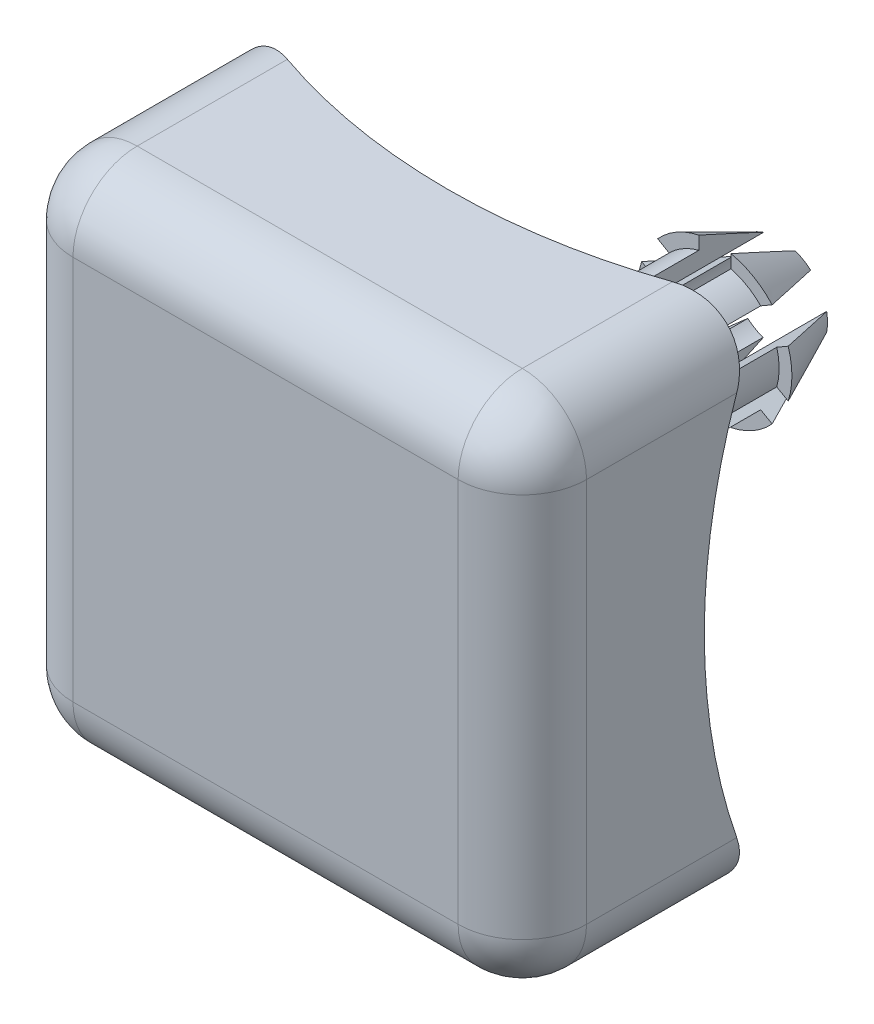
ISO-10303-21;
HEADER;
FILE_DESCRIPTION(('STEP AP214'),'2;1');
FILE_NAME('part.step','',(''),(''),'','','');
FILE_SCHEMA(('AUTOMOTIVE_DESIGN { 1 0 10303 214 1 1 1 1 }'));
ENDSEC;
DATA;
#1=APPLICATION_CONTEXT('core data for automotive mechanical design processes');
#2=APPLICATION_PROTOCOL_DEFINITION('international standard','automotive_design',2000,#1);
#3=PRODUCT_CONTEXT('',#1,'mechanical');
#4=PRODUCT('Part','Part','',(#3));
#5=PRODUCT_RELATED_PRODUCT_CATEGORY('part','',(#4));
#6=PRODUCT_DEFINITION_FORMATION('','',#4);
#7=PRODUCT_DEFINITION_CONTEXT('part definition',#1,'design');
#8=PRODUCT_DEFINITION('design','',#6,#7);
#9=PRODUCT_DEFINITION_SHAPE('','',#8);
#10=(LENGTH_UNIT() NAMED_UNIT(*) SI_UNIT(.MILLI.,.METRE.));
#11=(NAMED_UNIT(*) PLANE_ANGLE_UNIT() SI_UNIT($,.RADIAN.));
#12=(NAMED_UNIT(*) SI_UNIT($,.STERADIAN.) SOLID_ANGLE_UNIT());
#13=UNCERTAINTY_MEASURE_WITH_UNIT(LENGTH_MEASURE(1.E-05),#10,'distance_accuracy_value','');
#14=(GEOMETRIC_REPRESENTATION_CONTEXT(3) GLOBAL_UNCERTAINTY_ASSIGNED_CONTEXT((#13)) GLOBAL_UNIT_ASSIGNED_CONTEXT((#10,
#11,#12)) REPRESENTATION_CONTEXT('',''));
#15=CARTESIAN_POINT('',(0.,0.,0.));
#16=DIRECTION('',(0.,0.,1.));
#17=DIRECTION('',(1.,0.,0.));
#18=AXIS2_PLACEMENT_3D('',#15,#16,#17);
#19=CARTESIAN_POINT('',(-3.07525028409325E-06,3.75000018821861,31.9131285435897));
#20=DIRECTION('',(0.,0.,1.));
#21=DIRECTION('',(0.,-1.,0.));
#22=AXIS2_PLACEMENT_3D('',#19,#20,#21);
#23=PLANE('',#22);
#24=DIRECTION('',(-0.866025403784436,0.500000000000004,0.));
#25=VECTOR('',#24,1.);
#26=CARTESIAN_POINT('',(-18.21483086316,9.4338041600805,31.9131285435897));
#27=LINE('',#26,#25);
#28=CARTESIAN_POINT('',(-3.61322366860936,1.00356231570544,31.9131285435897));
#29=VERTEX_POINT('',#28);
#30=CARTESIAN_POINT('',(-4.2803564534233,1.388731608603,31.9131285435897));
#31=VERTEX_POINT('',#30);
#32=EDGE_CURVE('E844',#29,#31,#27,.T.);
#33=ORIENTED_EDGE('',*,*,#32,.T.);
#34=CARTESIAN_POINT('',(-3.07525028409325E-06,1.88218608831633E-07,31.9131285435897));
#35=DIRECTION('',(0.,0.,-1.));
#36=DIRECTION('',(0.,1.,0.));
#37=AXIS2_PLACEMENT_3D('',#34,#35,#36);
#38=CIRCLE('',#37,4.5);
#39=CARTESIAN_POINT('',(-4.28035645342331,-1.38873123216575,31.9131285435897));
#40=VERTEX_POINT('',#39);
#41=EDGE_CURVE('E743',#40,#31,#38,.T.);
#42=ORIENTED_EDGE('',*,*,#41,.F.);
#43=DIRECTION('',(0.86602540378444,0.499999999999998,0.));
#44=VECTOR('',#43,1.);
#45=CARTESIAN_POINT('',(-18.21483086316,-9.43380378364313,31.9131285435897));
#46=LINE('',#45,#44);
#47=CARTESIAN_POINT('',(-3.61322366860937,-1.0035619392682,31.9131285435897));
#48=VERTEX_POINT('',#47);
#49=EDGE_CURVE('E876',#40,#48,#46,.T.);
#50=ORIENTED_EDGE('',*,*,#49,.T.);
#51=CARTESIAN_POINT('',(-3.07525028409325E-06,1.88218608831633E-07,31.9131285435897));
#52=DIRECTION('',(0.,0.,-1.));
#53=DIRECTION('',(0.,1.,0.));
#54=AXIS2_PLACEMENT_3D('',#51,#52,#53);
#55=CIRCLE('',#54,3.75);
#56=EDGE_CURVE('E737',#48,#29,#55,.T.);
#57=ORIENTED_EDGE('',*,*,#56,.T.);
#58=EDGE_LOOP('',(#33,#42,#50,#57));
#59=FACE_BOUND('',#58,.T.);
#60=ADVANCED_FACE('F82',(#59),#23,.T.);
#61=DIRECTION('',(0.866025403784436,-0.500000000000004,0.));
#62=VECTOR('',#61,1.);
#63=CARTESIAN_POINT('',(-17.2773308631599,11.0576017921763,31.9131285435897));
#64=LINE('',#63,#62);
#65=CARTESIAN_POINT('',(-3.34285645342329,3.01252924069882,31.9131285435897));
#66=VERTEX_POINT('',#65);
#67=CARTESIAN_POINT('',(-2.67572366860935,2.62735994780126,31.9131285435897));
#68=VERTEX_POINT('',#67);
#69=EDGE_CURVE('E854',#66,#68,#64,.T.);
#70=ORIENTED_EDGE('',*,*,#69,.T.);
#71=CARTESIAN_POINT('',(-0.937503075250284,3.63092207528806,31.9131285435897));
#72=VERTEX_POINT('',#71);
#73=EDGE_CURVE('E730',#68,#72,#55,.T.);
#74=ORIENTED_EDGE('',*,*,#73,.T.);
#75=DIRECTION('',(0.,1.,0.));
#76=VECTOR('',#75,1.);
#77=CARTESIAN_POINT('',(-0.937503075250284,15.0007501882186,31.9131285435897));
#78=LINE('',#77,#76);
#79=CARTESIAN_POINT('',(-0.937503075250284,4.40126066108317,31.9131285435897));
#80=VERTEX_POINT('',#79);
#81=EDGE_CURVE('E1531',#72,#80,#78,.T.);
#82=ORIENTED_EDGE('',*,*,#81,.T.);
#83=EDGE_CURVE('E805',#66,#80,#38,.T.);
#84=ORIENTED_EDGE('',*,*,#83,.F.);
#85=EDGE_LOOP('',(#70,#74,#82,#84));
#86=FACE_BOUND('',#85,.T.);
#87=ADVANCED_FACE('F655',(#86),#23,.T.);
#88=DIRECTION('',(0.,-1.,0.));
#89=VECTOR('',#88,1.);
#90=CARTESIAN_POINT('',(0.937496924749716,15.0007501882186,31.9131285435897));
#91=LINE('',#90,#89);
#92=CARTESIAN_POINT('',(0.937496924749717,4.40126066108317,31.9131285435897));
#93=VERTEX_POINT('',#92);
#94=CARTESIAN_POINT('',(0.937496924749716,3.63092207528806,31.9131285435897));
#95=VERTEX_POINT('',#94);
#96=EDGE_CURVE('E450',#93,#95,#91,.T.);
#97=ORIENTED_EDGE('',*,*,#96,.T.);
#98=CARTESIAN_POINT('',(2.67571751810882,2.62735994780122,31.9131285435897));
#99=VERTEX_POINT('',#98);
#100=EDGE_CURVE('E726',#95,#99,#55,.T.);
#101=ORIENTED_EDGE('',*,*,#100,.T.);
#102=DIRECTION('',(0.866025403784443,0.499999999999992,0.));
#103=VECTOR('',#102,1.);
#104=CARTESIAN_POINT('',(17.2773247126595,11.057601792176,31.9131285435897));
#105=LINE('',#104,#103);
#106=CARTESIAN_POINT('',(3.34285030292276,3.01252924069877,31.9131285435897));
#107=VERTEX_POINT('',#106);
#108=EDGE_CURVE('E1539',#99,#107,#105,.T.);
#109=ORIENTED_EDGE('',*,*,#108,.T.);
#110=EDGE_CURVE('E878',#93,#107,#38,.T.);
#111=ORIENTED_EDGE('',*,*,#110,.F.);
#112=EDGE_LOOP('',(#97,#101,#109,#111));
#113=FACE_BOUND('',#112,.T.);
#114=ADVANCED_FACE('F662',(#113),#23,.T.);
#115=DIRECTION('',(-0.866025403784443,-0.499999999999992,0.));
#116=VECTOR('',#115,1.);
#117=CARTESIAN_POINT('',(18.2148247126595,9.43380416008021,31.9131285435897));
#118=LINE('',#117,#116);
#119=CARTESIAN_POINT('',(4.28035030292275,1.38873160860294,31.9131285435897));
#120=VERTEX_POINT('',#119);
#121=CARTESIAN_POINT('',(3.6132175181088,1.00356231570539,31.9131285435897));
#122=VERTEX_POINT('',#121);
#123=EDGE_CURVE('E710',#120,#122,#118,.T.);
#124=ORIENTED_EDGE('',*,*,#123,.T.);
#125=CARTESIAN_POINT('',(3.61321751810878,-1.00356193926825,31.9131285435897));
#126=VERTEX_POINT('',#125);
#127=EDGE_CURVE('E713',#122,#126,#55,.T.);
#128=ORIENTED_EDGE('',*,*,#127,.T.);
#129=DIRECTION('',(0.866025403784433,-0.50000000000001,0.));
#130=VECTOR('',#129,1.);
#131=CARTESIAN_POINT('',(18.2148247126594,-9.43380378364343,31.9131285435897));
#132=LINE('',#131,#130);
#133=CARTESIAN_POINT('',(4.28035030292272,-1.38873123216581,31.9131285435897));
#134=VERTEX_POINT('',#133);
#135=EDGE_CURVE('E1567',#126,#134,#132,.T.);
#136=ORIENTED_EDGE('',*,*,#135,.T.);
#137=EDGE_CURVE('E715',#120,#134,#38,.T.);
#138=ORIENTED_EDGE('',*,*,#137,.F.);
#139=EDGE_LOOP('',(#124,#128,#136,#138));
#140=FACE_BOUND('',#139,.T.);
#141=ADVANCED_FACE('F683',(#140),#23,.T.);
#142=CARTESIAN_POINT('',(-3.07525028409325E-06,1.88218611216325E-07,43.1631285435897));
#143=DIRECTION('',(0.,0.,-1.));
#144=DIRECTION('',(-1.,0.,0.));
#145=AXIS2_PLACEMENT_3D('',#142,#143,#144);
#146=CYLINDRICAL_SURFACE('',#145,2.8125);
#147=DIRECTION('',(0.,0.,-1.));
#148=VECTOR('',#147,1.);
#149=CARTESIAN_POINT('',(-2.76514970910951,0.513926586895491,43.1631285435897));
#150=LINE('',#149,#148);
#151=CARTESIAN_POINT('',(-2.76514970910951,0.51392658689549,43.0425928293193));
#152=VERTEX_POINT('',#151);
#153=CARTESIAN_POINT('',(-2.76514970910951,0.513926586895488,28.1631285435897));
#154=VERTEX_POINT('',#153);
#155=EDGE_CURVE('E842',#152,#154,#150,.T.);
#156=ORIENTED_EDGE('',*,*,#155,.F.);
#157=CARTESIAN_POINT('',(-3.07525028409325E-06,1.88218607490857E-07,43.0425928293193));
#158=DIRECTION('',(0.,0.,1.));
#159=DIRECTION('',(0.,-1.,0.));
#160=AXIS2_PLACEMENT_3D('',#157,#158,#159);
#161=CIRCLE('',#160,2.8125);
#162=CARTESIAN_POINT('',(-2.76514970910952,-0.513926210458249,43.0425928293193));
#163=VERTEX_POINT('',#162);
#164=EDGE_CURVE('E977',#152,#163,#161,.T.);
#165=ORIENTED_EDGE('',*,*,#164,.T.);
#166=DIRECTION('',(0.,0.,-1.));
#167=VECTOR('',#166,1.);
#168=CARTESIAN_POINT('',(-2.76514970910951,-0.513926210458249,43.1631285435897));
#169=LINE('',#168,#167);
#170=CARTESIAN_POINT('',(-2.76514970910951,-0.513926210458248,28.1631285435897));
#171=VERTEX_POINT('',#170);
#172=EDGE_CURVE('E609',#171,#163,#169,.F.);
#173=ORIENTED_EDGE('',*,*,#172,.F.);
#174=CARTESIAN_POINT('',(-3.07525028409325E-06,1.88218611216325E-07,28.1631285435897));
#175=DIRECTION('',(0.,0.,-1.));
#176=DIRECTION('',(-1.,0.,0.));
#177=AXIS2_PLACEMENT_3D('',#174,#175,#176);
#178=CIRCLE('',#177,2.8125);
#179=EDGE_CURVE('E748',#171,#154,#178,.T.);
#180=ORIENTED_EDGE('',*,*,#179,.T.);
#181=EDGE_LOOP('',(#156,#165,#173,#180));
#182=FACE_BOUND('',#181,.T.);
#183=ADVANCED_FACE('F698',(#182),#146,.F.);
#184=DIRECTION('',(0.,0.,-1.));
#185=VECTOR('',#184,1.);
#186=CARTESIAN_POINT('',(-0.937503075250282,2.65165061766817,43.1631285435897));
#187=LINE('',#186,#185);
#188=CARTESIAN_POINT('',(-0.937503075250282,2.65165061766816,43.0425928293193));
#189=VERTEX_POINT('',#188);
#190=CARTESIAN_POINT('',(-0.937503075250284,2.65165061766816,28.1631285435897));
#191=VERTEX_POINT('',#190);
#192=EDGE_CURVE('E808',#189,#191,#187,.T.);
#193=ORIENTED_EDGE('',*,*,#192,.F.);
#194=CARTESIAN_POINT('',(-3.07525028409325E-06,1.88218607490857E-07,43.0425928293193));
#195=DIRECTION('',(0.,0.,1.));
#196=DIRECTION('',(0.,-1.,0.));
#197=AXIS2_PLACEMENT_3D('',#194,#195,#196);
#198=CIRCLE('',#197,2.8125);
#199=CARTESIAN_POINT('',(-1.82764970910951,2.13772421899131,43.0425928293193));
#200=VERTEX_POINT('',#199);
#201=EDGE_CURVE('E426',#189,#200,#198,.T.);
#202=ORIENTED_EDGE('',*,*,#201,.T.);
#203=DIRECTION('',(0.,0.,-1.));
#204=VECTOR('',#203,1.);
#205=CARTESIAN_POINT('',(-1.82764970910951,2.13772421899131,43.1631285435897));
#206=LINE('',#205,#204);
#207=CARTESIAN_POINT('',(-1.8276497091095,2.13772421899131,28.1631285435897));
#208=VERTEX_POINT('',#207);
#209=EDGE_CURVE('E836',#208,#200,#206,.F.);
#210=ORIENTED_EDGE('',*,*,#209,.F.);
#211=EDGE_CURVE('E980',#208,#191,#178,.T.);
#212=ORIENTED_EDGE('',*,*,#211,.T.);
#213=EDGE_LOOP('',(#193,#202,#210,#212));
#214=FACE_BOUND('',#213,.T.);
#215=ADVANCED_FACE('F704',(#214),#146,.F.);
#216=DIRECTION('',(0.,0.,-1.));
#217=VECTOR('',#216,1.);
#218=CARTESIAN_POINT('',(1.82764355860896,2.13772421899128,43.1631285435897));
#219=LINE('',#218,#217);
#220=CARTESIAN_POINT('',(1.82764355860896,2.13772421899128,43.0425928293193));
#221=VERTEX_POINT('',#220);
#222=CARTESIAN_POINT('',(1.82764355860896,2.13772421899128,28.1631285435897));
#223=VERTEX_POINT('',#222);
#224=EDGE_CURVE('E1541',#221,#223,#219,.T.);
#225=ORIENTED_EDGE('',*,*,#224,.F.);
#226=CARTESIAN_POINT('',(-3.07525028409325E-06,1.88218607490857E-07,43.0425928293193));
#227=DIRECTION('',(0.,0.,1.));
#228=DIRECTION('',(0.,-1.,0.));
#229=AXIS2_PLACEMENT_3D('',#226,#227,#228);
#230=CIRCLE('',#229,2.8125);
#231=CARTESIAN_POINT('',(0.937496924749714,2.65165061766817,43.0425928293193));
#232=VERTEX_POINT('',#231);
#233=EDGE_CURVE('E438',#221,#232,#230,.T.);
#234=ORIENTED_EDGE('',*,*,#233,.T.);
#235=DIRECTION('',(0.,0.,-1.));
#236=VECTOR('',#235,1.);
#237=CARTESIAN_POINT('',(0.937496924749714,2.65165061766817,43.1631285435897));
#238=LINE('',#237,#236);
#239=CARTESIAN_POINT('',(0.937496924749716,2.65165061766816,28.1631285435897));
#240=VERTEX_POINT('',#239);
#241=EDGE_CURVE('E437',#240,#232,#238,.F.);
#242=ORIENTED_EDGE('',*,*,#241,.F.);
#243=EDGE_CURVE('E981',#240,#223,#178,.T.);
#244=ORIENTED_EDGE('',*,*,#243,.T.);
#245=EDGE_LOOP('',(#225,#234,#242,#244));
#246=FACE_BOUND('',#245,.T.);
#247=ADVANCED_FACE('F1489',(#246),#146,.F.);
#248=DIRECTION('',(0.,0.,-1.));
#249=VECTOR('',#248,1.);
#250=CARTESIAN_POINT('',(2.76514355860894,-0.513926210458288,43.1631285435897));
#251=LINE('',#250,#249);
#252=CARTESIAN_POINT('',(2.76514355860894,-0.513926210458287,43.0425928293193));
#253=VERTEX_POINT('',#252);
#254=CARTESIAN_POINT('',(2.76514355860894,-0.513926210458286,28.1631285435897));
#255=VERTEX_POINT('',#254);
#256=EDGE_CURVE('E1560',#253,#255,#251,.T.);
#257=ORIENTED_EDGE('',*,*,#256,.F.);
#258=CARTESIAN_POINT('',(-3.07525028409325E-06,1.88218607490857E-07,43.0425928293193));
#259=DIRECTION('',(0.,0.,1.));
#260=DIRECTION('',(0.,-1.,0.));
#261=AXIS2_PLACEMENT_3D('',#258,#259,#260);
#262=CIRCLE('',#261,2.8125);
#263=CARTESIAN_POINT('',(2.76514355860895,0.513926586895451,43.0425928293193));
#264=VERTEX_POINT('',#263);
#265=EDGE_CURVE('E1559',#253,#264,#262,.T.);
#266=ORIENTED_EDGE('',*,*,#265,.T.);
#267=DIRECTION('',(0.,0.,-1.));
#268=VECTOR('',#267,1.);
#269=CARTESIAN_POINT('',(2.76514355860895,0.513926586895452,43.1631285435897));
#270=LINE('',#269,#268);
#271=CARTESIAN_POINT('',(2.76514355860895,0.51392658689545,28.1631285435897));
#272=VERTEX_POINT('',#271);
#273=EDGE_CURVE('E1545',#272,#264,#270,.F.);
#274=ORIENTED_EDGE('',*,*,#273,.F.);
#275=EDGE_CURVE('E986',#272,#255,#178,.T.);
#276=ORIENTED_EDGE('',*,*,#275,.T.);
#277=EDGE_LOOP('',(#257,#266,#274,#276));
#278=FACE_BOUND('',#277,.T.);
#279=ADVANCED_FACE('F691',(#278),#146,.F.);
#280=CARTESIAN_POINT('',(-3.07525028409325E-06,1.88218611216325E-07,28.1631285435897));
#281=DIRECTION('',(0.,0.,1.));
#282=DIRECTION('',(1.,0.,0.));
#283=AXIS2_PLACEMENT_3D('',#280,#281,#282);
#284=PLANE('',#283);
#285=CARTESIAN_POINT('',(-3.07525028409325E-06,1.88218609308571E-07,28.1631285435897));
#286=DIRECTION('',(0.,0.,1.));
#287=DIRECTION('',(1.,0.,0.));
#288=AXIS2_PLACEMENT_3D('',#285,#286,#287);
#289=CIRCLE('',#288,2.83039243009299);
#290=CARTESIAN_POINT('',(-2.78157846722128,-0.523411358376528,28.1631285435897));
#291=VERTEX_POINT('',#290);
#292=CARTESIAN_POINT('',(-2.78157846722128,0.523411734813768,28.1631285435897));
#293=VERTEX_POINT('',#292);
#294=EDGE_CURVE('E765',#291,#293,#289,.F.);
#295=ORIENTED_EDGE('',*,*,#294,.T.);
#296=DIRECTION('',(0.866025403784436,-0.500000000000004,0.));
#297=VECTOR('',#296,1.);
#298=CARTESIAN_POINT('',(-18.21483086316,9.4338041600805,28.1631285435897));
#299=LINE('',#298,#297);
#300=EDGE_CURVE('E850',#293,#154,#299,.T.);
#301=ORIENTED_EDGE('',*,*,#300,.T.);
#302=ORIENTED_EDGE('',*,*,#179,.F.);
#303=DIRECTION('',(0.86602540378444,0.499999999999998,0.));
#304=VECTOR('',#303,1.);
#305=CARTESIAN_POINT('',(-18.21483086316,-9.43380378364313,28.1631285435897));
#306=LINE('',#305,#304);
#307=EDGE_CURVE('E958',#291,#171,#306,.T.);
#308=ORIENTED_EDGE('',*,*,#307,.F.);
#309=EDGE_LOOP('',(#295,#301,#302,#308));
#310=FACE_BOUND('',#309,.T.);
#311=ADVANCED_FACE('F979',(#310),#284,.F.);
#312=ORIENTED_EDGE('',*,*,#211,.F.);
#313=DIRECTION('',(0.866025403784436,-0.500000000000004,0.));
#314=VECTOR('',#313,1.);
#315=CARTESIAN_POINT('',(-17.2773308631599,11.0576017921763,28.1631285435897));
#316=LINE('',#315,#314);
#317=CARTESIAN_POINT('',(-1.84407846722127,2.14720936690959,28.1631285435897));
#318=VERTEX_POINT('',#317);
#319=EDGE_CURVE('E798',#318,#208,#316,.T.);
#320=ORIENTED_EDGE('',*,*,#319,.F.);
#321=CARTESIAN_POINT('',(-0.937503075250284,2.67062091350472,28.1631285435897));
#322=VERTEX_POINT('',#321);
#323=EDGE_CURVE('E773',#318,#322,#289,.F.);
#324=ORIENTED_EDGE('',*,*,#323,.T.);
#325=DIRECTION('',(0.,-1.,0.));
#326=VECTOR('',#325,1.);
#327=CARTESIAN_POINT('',(-0.937503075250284,15.0007501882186,28.1631285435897));
#328=LINE('',#327,#326);
#329=EDGE_CURVE('E452',#322,#191,#328,.T.);
#330=ORIENTED_EDGE('',*,*,#329,.T.);
#331=EDGE_LOOP('',(#312,#320,#324,#330));
#332=FACE_BOUND('',#331,.T.);
#333=ADVANCED_FACE('F796',(#332),#284,.F.);
#334=ORIENTED_EDGE('',*,*,#243,.F.);
#335=DIRECTION('',(0.,-1.,0.));
#336=VECTOR('',#335,1.);
#337=CARTESIAN_POINT('',(0.937496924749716,15.0007501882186,28.1631285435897));
#338=LINE('',#337,#336);
#339=CARTESIAN_POINT('',(0.937496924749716,2.67062091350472,28.1631285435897));
#340=VERTEX_POINT('',#339);
#341=EDGE_CURVE('E447',#340,#240,#338,.T.);
#342=ORIENTED_EDGE('',*,*,#341,.F.);
#343=CARTESIAN_POINT('',(1.84407231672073,2.14720936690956,28.1631285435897));
#344=VERTEX_POINT('',#343);
#345=EDGE_CURVE('E781',#340,#344,#289,.F.);
#346=ORIENTED_EDGE('',*,*,#345,.T.);
#347=DIRECTION('',(-0.866025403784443,-0.499999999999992,0.));
#348=VECTOR('',#347,1.);
#349=CARTESIAN_POINT('',(17.2773247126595,11.057601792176,28.1631285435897));
#350=LINE('',#349,#348);
#351=EDGE_CURVE('E1549',#344,#223,#350,.T.);
#352=ORIENTED_EDGE('',*,*,#351,.T.);
#353=EDGE_LOOP('',(#334,#342,#346,#352));
#354=FACE_BOUND('',#353,.T.);
#355=ADVANCED_FACE('F1017',(#354),#284,.F.);
#356=ORIENTED_EDGE('',*,*,#275,.F.);
#357=DIRECTION('',(-0.866025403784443,-0.499999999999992,0.));
#358=VECTOR('',#357,1.);
#359=CARTESIAN_POINT('',(18.2148247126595,9.43380416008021,28.1631285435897));
#360=LINE('',#359,#358);
#361=CARTESIAN_POINT('',(2.78157231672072,0.523411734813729,28.1631285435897));
#362=VERTEX_POINT('',#361);
#363=EDGE_CURVE('E1022',#362,#272,#360,.T.);
#364=ORIENTED_EDGE('',*,*,#363,.F.);
#365=CARTESIAN_POINT('',(2.78157231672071,-0.523411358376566,28.1631285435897));
#366=VERTEX_POINT('',#365);
#367=EDGE_CURVE('E774',#362,#366,#289,.F.);
#368=ORIENTED_EDGE('',*,*,#367,.T.);
#369=DIRECTION('',(-0.866025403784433,0.50000000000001,0.));
#370=VECTOR('',#369,1.);
#371=CARTESIAN_POINT('',(18.2148247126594,-9.43380378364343,28.1631285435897));
#372=LINE('',#371,#370);
#373=EDGE_CURVE('E1023',#366,#255,#372,.T.);
#374=ORIENTED_EDGE('',*,*,#373,.T.);
#375=EDGE_LOOP('',(#356,#364,#368,#374));
#376=FACE_BOUND('',#375,.T.);
#377=ADVANCED_FACE('F1011',(#376),#284,.F.);
#378=CARTESIAN_POINT('',(-3.07525028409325E-06,1.88218609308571E-07,28.1631285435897));
#379=DIRECTION('',(0.,0.,1.));
#380=DIRECTION('',(0.,-1.,0.));
#381=AXIS2_PLACEMENT_3D('',#378,#379,#380);
#382=CONICAL_SURFACE('',#381,2.83039243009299,0.418879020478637);
#383=CARTESIAN_POINT('',(-6.07738392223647,2.42624590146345,36.5035626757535));
#384=CARTESIAN_POINT('',(-5.94015565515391,2.34701712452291,36.1513414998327));
#385=CARTESIAN_POINT('',(-5.80284691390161,2.2677418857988,35.7991620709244));
#386=CARTESIAN_POINT('',(-5.5280119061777,2.10906582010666,35.0949156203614));
#387=CARTESIAN_POINT('',(-5.39048563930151,2.02966499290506,34.7428485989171));
#388=CARTESIAN_POINT('',(-5.11513215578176,1.87068958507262,34.0387872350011));
#389=CARTESIAN_POINT('',(-4.97730488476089,1.79111497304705,33.6867929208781));
#390=CARTESIAN_POINT('',(-4.70129164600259,1.63175865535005,32.9829923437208));
#391=CARTESIAN_POINT('',(-4.56310567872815,1.55197694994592,32.6311860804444));
#392=CARTESIAN_POINT('',(-4.28525529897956,1.39155995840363,31.9252937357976));
#393=CARTESIAN_POINT('',(-4.14558740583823,1.31092266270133,31.5712094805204));
#394=CARTESIAN_POINT('',(-3.86557304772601,1.14925629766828,30.8633989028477));
#395=CARTESIAN_POINT('',(-3.72522658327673,1.06822722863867,30.5096725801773));
#396=CARTESIAN_POINT('',(-3.44356857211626,0.905611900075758,29.8027981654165));
#397=CARTESIAN_POINT('',(-3.30225717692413,0.824025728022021,29.4496499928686));
#398=CARTESIAN_POINT('',(-3.01813696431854,0.659988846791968,28.744158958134));
#399=CARTESIAN_POINT('',(-2.8753281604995,0.577538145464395,28.3918160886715));
#400=CARTESIAN_POINT('',(-2.62693227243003,0.434126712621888,27.7854788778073));
#401=CARTESIAN_POINT('',(-2.52194139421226,0.373510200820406,27.5311591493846));
#402=CARTESIAN_POINT('',(-2.30990807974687,0.251092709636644,27.0235628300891));
#403=CARTESIAN_POINT('',(-2.20286504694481,0.189291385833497,26.770286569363));
#404=CARTESIAN_POINT('',(-2.03982355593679,0.0951593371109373,26.3920353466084));
#405=CARTESIAN_POINT('',(-1.98510660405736,0.0635684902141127,26.2663248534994));
#406=CARTESIAN_POINT('',(-1.87450836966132,-0.000285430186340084,26.0155897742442));
#407=CARTESIAN_POINT('',(-1.81862711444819,-0.0325484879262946,25.8905651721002));
#408=CARTESIAN_POINT('',(-1.70526209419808,-0.0979998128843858,25.6415614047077));
#409=CARTESIAN_POINT('',(-1.64777909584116,-0.13118763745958,25.5175817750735));
#410=CARTESIAN_POINT('',(-1.53044073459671,-0.198932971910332,25.2711337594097));
#411=CARTESIAN_POINT('',(-1.47058572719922,-0.233490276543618,25.148665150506));
#412=CARTESIAN_POINT('',(-1.37834665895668,-0.286744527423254,24.9676408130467));
#413=CARTESIAN_POINT('',(-1.34739467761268,-0.304614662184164,24.908114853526));
#414=CARTESIAN_POINT('',(-1.28426564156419,-0.341062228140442,24.7899090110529));
#415=CARTESIAN_POINT('',(-1.25208825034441,-0.359639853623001,24.7312293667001));
#416=CARTESIAN_POINT('',(-1.18606536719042,-0.39775818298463,24.6150074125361));
#417=CARTESIAN_POINT('',(-1.15221765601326,-0.417300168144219,24.5574667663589));
#418=CARTESIAN_POINT('',(-1.082282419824,-0.457677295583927,24.444268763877));
#419=CARTESIAN_POINT('',(-1.04619615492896,-0.478511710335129,24.3886103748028));
#420=CARTESIAN_POINT('',(-0.970481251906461,-0.522225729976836,24.2798617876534));
#421=CARTESIAN_POINT('',(-0.930830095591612,-0.545118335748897,24.2267917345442));
#422=CARTESIAN_POINT('',(-0.867607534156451,-0.581619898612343,24.1515003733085));
#423=CARTESIAN_POINT('',(-0.845946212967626,-0.594126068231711,24.1271572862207));
#424=CARTESIAN_POINT('',(-0.801040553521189,-0.620052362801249,24.0805219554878));
#425=CARTESIAN_POINT('',(-0.777798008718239,-0.633471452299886,24.0582274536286));
#426=CARTESIAN_POINT('',(-0.732805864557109,-0.659447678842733,24.0196036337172));
#427=CARTESIAN_POINT('',(-0.711316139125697,-0.671854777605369,24.0028770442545));
#428=CARTESIAN_POINT('',(-0.666685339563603,-0.697622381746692,23.9725730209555));
#429=CARTESIAN_POINT('',(-0.643544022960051,-0.710983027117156,23.9589960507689));
#430=CARTESIAN_POINT('',(-0.595225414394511,-0.73887978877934,23.9361155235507));
#431=CARTESIAN_POINT('',(-0.570021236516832,-0.753431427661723,23.9268846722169));
#432=CARTESIAN_POINT('',(-0.518531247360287,-0.783159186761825,23.9145409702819));
#433=CARTESIAN_POINT('',(-0.492249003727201,-0.798333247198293,23.9114093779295));
#434=CARTESIAN_POINT('',(-0.443579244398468,-0.826432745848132,23.9118270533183));
#435=CARTESIAN_POINT('',(-0.421182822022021,-0.839363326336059,23.914468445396));
#436=CARTESIAN_POINT('',(-0.377122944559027,-0.864801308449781,23.9242223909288));
#437=CARTESIAN_POINT('',(-0.355460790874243,-0.877307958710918,23.9313424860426));
#438=CARTESIAN_POINT('',(-0.304849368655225,-0.906528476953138,23.9527678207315));
#439=CARTESIAN_POINT('',(-0.276463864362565,-0.92291685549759,23.9688097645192));
#440=CARTESIAN_POINT('',(-0.222097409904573,-0.954305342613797,24.0055892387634));
#441=CARTESIAN_POINT('',(-0.196123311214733,-0.969301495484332,24.0263396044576));
#442=CARTESIAN_POINT('',(-0.136110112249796,-1.00395013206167,24.0798914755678));
#443=CARTESIAN_POINT('',(-0.103075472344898,-1.02302269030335,24.1141662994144));
#444=CARTESIAN_POINT('',(-0.039917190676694,-1.05948714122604,24.1861666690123));
#445=CARTESIAN_POINT('',(-0.00980075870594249,-1.07687487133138,24.2239003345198));
#446=CARTESIAN_POINT('',(0.0484873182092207,-1.1105275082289,24.3017813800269));
#447=CARTESIAN_POINT('',(0.0766431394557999,-1.12678327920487,24.341944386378));
#448=CARTESIAN_POINT('',(0.131295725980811,-1.15833696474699,24.4236536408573));
#449=CARTESIAN_POINT('',(0.15779445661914,-1.17363601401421,24.4651981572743));
#450=CARTESIAN_POINT('',(0.212682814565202,-1.20532582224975,24.5543669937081));
#451=CARTESIAN_POINT('',(0.240914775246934,-1.2216255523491,24.6021200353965));
#452=CARTESIAN_POINT('',(0.296204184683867,-1.25354690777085,24.6985272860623));
#453=CARTESIAN_POINT('',(0.323261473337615,-1.26916844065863,24.7471816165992));
#454=CARTESIAN_POINT('',(0.403098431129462,-1.31526232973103,24.8941742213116));
#455=CARTESIAN_POINT('',(0.454516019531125,-1.34494828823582,24.9934965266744));
#456=CARTESIAN_POINT('',(0.555115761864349,-1.40302957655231,25.1938928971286));
#457=CARTESIAN_POINT('',(0.604293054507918,-1.43142209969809,25.2949701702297));
#458=CARTESIAN_POINT('',(0.701001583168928,-1.48725679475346,25.4981290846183));
#459=CARTESIAN_POINT('',(0.748533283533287,-1.51469923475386,25.6002104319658));
#460=CARTESIAN_POINT('',(0.842318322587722,-1.5688460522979,25.804874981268));
#461=CARTESIAN_POINT('',(0.888574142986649,-1.59555186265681,25.9074566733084));
#462=CARTESIAN_POINT('',(0.980204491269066,-1.6484546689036,26.1131516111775));
#463=CARTESIAN_POINT('',(1.02557895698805,-1.6746516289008,26.2162648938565));
#464=CARTESIAN_POINT('',(1.16057992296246,-1.75259447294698,26.5259410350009));
#465=CARTESIAN_POINT('',(1.24919695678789,-1.80375754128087,26.7330898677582));
#466=CARTESIAN_POINT('',(1.45873257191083,-1.92473298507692,27.2287296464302));
#467=CARTESIAN_POINT('',(1.57887165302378,-1.99409531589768,27.5176578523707));
#468=CARTESIAN_POINT('',(1.81723364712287,-2.13171367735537,28.0965718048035));
#469=CARTESIAN_POINT('',(1.93545650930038,-2.19996967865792,28.3865575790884));
#470=CARTESIAN_POINT('',(2.17072462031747,-2.33580178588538,28.9673697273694));
#471=CARTESIAN_POINT('',(2.28776914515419,-2.40337747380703,29.2581964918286));
#472=CARTESIAN_POINT('',(2.52100469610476,-2.53803608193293,29.8403016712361));
#473=CARTESIAN_POINT('',(2.63719573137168,-2.60511900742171,30.1315800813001));
#474=CARTESIAN_POINT('',(2.86802437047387,-2.73838798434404,30.7120869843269));
#475=CARTESIAN_POINT('',(2.98266691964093,-2.80457689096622,31.0013128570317));
#476=CARTESIAN_POINT('',(3.21150704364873,-2.93669779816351,31.580000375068));
#477=CARTESIAN_POINT('',(3.32570461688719,-3.00262979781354,31.869462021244));
#478=CARTESIAN_POINT('',(3.55368259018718,-3.1342529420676,32.4483636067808));
#479=CARTESIAN_POINT('',(3.66746322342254,-3.1999442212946,32.7378034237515));
#480=CARTESIAN_POINT('',(3.89475590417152,-3.33117171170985,33.3168219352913));
#481=CARTESIAN_POINT('',(4.00826795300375,-3.39670792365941,33.60640062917));
#482=CARTESIAN_POINT('',(4.12168105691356,-3.46218700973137,33.8960308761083));
#483=B_SPLINE_CURVE_WITH_KNOTS('',3,(#383,#384,#385,#386,#387,#388,#389,#390,#391,#392,#393,
#394,#395,#396,#397,#398,#399,#400,#401,#402,#403,#404,#405,#406,#407,#408,#409,#410,#411,#412,
#413,#414,#415,#416,#417,#418,#419,#420,#421,#422,#423,#424,#425,#426,#427,#428,#429,#430,#431,
#432,#433,#434,#435,#436,#437,#438,#439,#440,#441,#442,#443,#444,#445,#446,#447,#448,#449,#450,
#451,#452,#453,#454,#455,#456,#457,#458,#459,#460,#461,#462,#463,#464,#465,#466,#467,#468,#469,
#470,#471,#472,#473,#474,#475,#476,#477,#478,#479,#480,#481,#482),.UNSPECIFIED.,.F.,.F.,(4,2,2,
2,2,2,2,2,2,2,2,2,2,2,2,2,2,2,2,2,2,2,2,2,2,2,2,2,2,2,2,2,2,2,2,2,2,2,2,2,2,2,2,2,2,2,2,2,2,4),
(0.,1.15867041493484,2.3173429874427,3.47624582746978,4.63514717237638,5.80239391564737,
6.96963976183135,8.13670635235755,9.30376235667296,10.148969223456,10.9944256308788,
11.4165050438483,11.8385745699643,12.2604454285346,12.6822532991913,12.8905328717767,
13.0988700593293,13.3074919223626,13.5159973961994,13.7259274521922,13.8305623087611,
13.9350804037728,14.0246914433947,14.114315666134,14.2053901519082,14.2961843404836,
14.3737348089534,14.4514162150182,14.5602678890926,14.6694199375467,14.8228657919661,
14.9766815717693,15.1316216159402,15.2863742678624,15.4598004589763,15.6332502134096,
15.9803155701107,16.3281012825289,16.6757880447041,17.0227424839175,17.3697213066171,
18.0628339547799,19.0243361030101,19.9858637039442,20.9479498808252,21.9100257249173,
22.8642679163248,23.8185135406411,24.7721018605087,25.7256854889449),.UNSPECIFIED.);
#484=EDGE_CURVE('E829',#31,#293,#483,.T.);
#485=ORIENTED_EDGE('',*,*,#484,.T.);
#486=ORIENTED_EDGE('',*,*,#294,.F.);
#487=CARTESIAN_POINT('',(4.08074657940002,3.43855385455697,33.7915041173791));
#488=CARTESIAN_POINT('',(3.9671821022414,3.37298737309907,33.5015673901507));
#489=CARTESIAN_POINT('',(3.85351595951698,3.30736219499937,33.2116836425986));
#490=CARTESIAN_POINT('',(3.62590649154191,3.17595180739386,32.6320594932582));
#491=CARTESIAN_POINT('',(3.51196316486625,3.11016659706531,32.3423190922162));
#492=CARTESIAN_POINT('',(3.28363694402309,2.97834239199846,31.7627943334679));
#493=CARTESIAN_POINT('',(3.16925377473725,2.91230323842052,31.4730101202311));
#494=CARTESIAN_POINT('',(2.94002541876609,2.77995818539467,30.8936866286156));
#495=CARTESIAN_POINT('',(2.8251802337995,2.71365228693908,30.6041473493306));
#496=CARTESIAN_POINT('',(2.59646379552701,2.58160278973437,30.029420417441));
#497=CARTESIAN_POINT('',(2.48260117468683,2.51586417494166,29.7442281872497));
#498=CARTESIAN_POINT('',(2.25402620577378,2.3838963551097,29.1742938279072));
#499=CARTESIAN_POINT('',(2.13931384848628,2.31766714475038,28.8895517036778));
#500=CARTESIAN_POINT('',(1.90872774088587,2.1845381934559,28.3209242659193));
#501=CARTESIAN_POINT('',(1.79285481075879,2.11763892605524,28.0370385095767));
#502=CARTESIAN_POINT('',(1.55921501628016,1.98274692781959,27.4703136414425));
#503=CARTESIAN_POINT('',(1.44144820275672,1.91475422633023,27.1874745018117));
#504=CARTESIAN_POINT('',(1.23552449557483,1.79586411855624,26.701060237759));
#505=CARTESIAN_POINT('',(1.14812332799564,1.74540303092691,26.4970605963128));
#506=CARTESIAN_POINT('',(1.01495721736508,1.66851954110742,26.1920824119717));
#507=CARTESIAN_POINT('',(0.970192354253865,1.64267453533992,26.0905224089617));
#508=CARTESIAN_POINT('',(0.879790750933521,1.59048114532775,25.8879294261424));
#509=CARTESIAN_POINT('',(0.834154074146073,1.56413279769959,25.7868964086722));
#510=CARTESIAN_POINT('',(0.741106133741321,1.51041154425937,25.5841959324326));
#511=CARTESIAN_POINT('',(0.693679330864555,1.48302966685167,25.4825379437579));
#512=CARTESIAN_POINT('',(0.597164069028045,1.42730655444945,25.2802371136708));
#513=CARTESIAN_POINT('',(0.548075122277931,1.39896503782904,25.1795945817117));
#514=CARTESIAN_POINT('',(0.44765376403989,1.34098673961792,24.9801439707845));
#515=CARTESIAN_POINT('',(0.396327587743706,1.31135355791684,24.8813317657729));
#516=CARTESIAN_POINT('',(0.316597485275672,1.26532136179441,24.7351352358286));
#517=CARTESIAN_POINT('',(0.289571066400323,1.24971765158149,24.6867518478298));
#518=CARTESIAN_POINT('',(0.234328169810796,1.21782315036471,24.5909028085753));
#519=CARTESIAN_POINT('',(0.20611185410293,1.20153245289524,24.5434370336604));
#520=CARTESIAN_POINT('',(0.147584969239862,1.16774194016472,24.4489379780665));
#521=CARTESIAN_POINT('',(0.11724562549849,1.1502255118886,24.4019283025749));
#522=CARTESIAN_POINT('',(0.0542483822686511,1.11385403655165,24.3097709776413));
#523=CARTESIAN_POINT('',(0.0215841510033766,1.09499533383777,24.264628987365));
#524=CARTESIAN_POINT('',(-0.046240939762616,1.05583649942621,24.1784608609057));
#525=CARTESIAN_POINT('',(-0.0813416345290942,1.03557110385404,24.1373722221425));
#526=CARTESIAN_POINT('',(-0.155831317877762,0.992564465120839,24.0608600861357));
#527=CARTESIAN_POINT('',(-0.195194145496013,0.969838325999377,24.0254049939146));
#528=CARTESIAN_POINT('',(-0.257928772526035,0.933618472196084,23.9808682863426));
#529=CARTESIAN_POINT('',(-0.279045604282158,0.921426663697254,23.967628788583));
#530=CARTESIAN_POINT('',(-0.322713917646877,0.896214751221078,23.9446959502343));
#531=CARTESIAN_POINT('',(-0.345265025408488,0.883194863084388,23.9350016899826));
#532=CARTESIAN_POINT('',(-0.391829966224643,0.856310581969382,23.9201972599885));
#533=CARTESIAN_POINT('',(-0.415858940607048,0.842437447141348,23.9151479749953));
#534=CARTESIAN_POINT('',(-0.464308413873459,0.814465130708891,23.9107218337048));
#535=CARTESIAN_POINT('',(-0.48872858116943,0.800366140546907,23.9113404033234));
#536=CARTESIAN_POINT('',(-0.533655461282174,0.774427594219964,23.9176462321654));
#537=CARTESIAN_POINT('',(-0.554241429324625,0.762542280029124,23.9226302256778));
#538=CARTESIAN_POINT('',(-0.594523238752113,0.739285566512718,23.9361065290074));
#539=CARTESIAN_POINT('',(-0.614218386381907,0.727914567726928,23.9446015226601));
#540=CARTESIAN_POINT('',(-0.666067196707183,0.69797964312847,23.971313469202));
#541=CARTESIAN_POINT('',(-0.697190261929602,0.680010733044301,23.9921585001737));
#542=CARTESIAN_POINT('',(-0.756536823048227,0.645746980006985,24.038776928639));
#543=CARTESIAN_POINT('',(-0.78474824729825,0.62945910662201,24.0645696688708));
#544=CARTESIAN_POINT('',(-0.854647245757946,0.589102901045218,24.1351016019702));
#545=CARTESIAN_POINT('',(-0.894587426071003,0.566043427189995,24.182111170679));
#546=CARTESIAN_POINT('',(-0.970706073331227,0.522096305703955,24.2800814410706));
#547=CARTESIAN_POINT('',(-1.00687406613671,0.501214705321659,24.331052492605));
#548=CARTESIAN_POINT('',(-1.0768218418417,0.460830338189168,24.4356591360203));
#549=CARTESIAN_POINT('',(-1.1105841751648,0.441337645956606,24.4893101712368));
#550=CARTESIAN_POINT('',(-1.17617516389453,0.403468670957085,24.5980358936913));
#551=CARTESIAN_POINT('',(-1.20800642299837,0.385090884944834,24.6531085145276));
#552=CARTESIAN_POINT('',(-1.27608215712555,0.345787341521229,24.7746321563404));
#553=CARTESIAN_POINT('',(-1.3120449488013,0.325024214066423,24.8412926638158));
#554=CARTESIAN_POINT('',(-1.38255637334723,0.284314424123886,24.9756068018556));
#555=CARTESIAN_POINT('',(-1.41710483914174,0.264367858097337,25.0432605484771));
#556=CARTESIAN_POINT('',(-1.51919725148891,0.205424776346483,25.2473246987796));
#557=CARTESIAN_POINT('',(-1.58516045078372,0.167340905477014,25.3847868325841));
#558=CARTESIAN_POINT('',(-1.71463019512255,0.0925915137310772,25.6615354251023));
#559=CARTESIAN_POINT('',(-1.77813223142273,0.0559285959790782,25.8008246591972));
#560=CARTESIAN_POINT('',(-1.9033915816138,-0.0163899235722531,26.0804023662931));
#561=CARTESIAN_POINT('',(-1.96514929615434,-0.0520457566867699,26.2206906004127));
#562=CARTESIAN_POINT('',(-2.08721047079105,-0.122517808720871,26.5014116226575));
#563=CARTESIAN_POINT('',(-2.14751871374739,-0.157336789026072,26.641841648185));
#564=CARTESIAN_POINT('',(-2.26725335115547,-0.226465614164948,26.9232115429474));
#565=CARTESIAN_POINT('',(-2.32667969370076,-0.260775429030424,27.0641514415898));
#566=CARTESIAN_POINT('',(-2.50385424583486,-0.363067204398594,27.4872531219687));
#567=CARTESIAN_POINT('',(-2.62061389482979,-0.430478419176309,27.7699662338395));
#568=CARTESIAN_POINT('',(-2.87911279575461,-0.579722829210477,28.4011690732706));
#569=CARTESIAN_POINT('',(-3.02044288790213,-0.661319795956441,28.7498813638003));
#570=CARTESIAN_POINT('',(-3.3016317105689,-0.82366423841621,29.4481001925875));
#571=CARTESIAN_POINT('',(-3.44149042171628,-0.904411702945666,29.7976067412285));
#572=CARTESIAN_POINT('',(-3.7202981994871,-1.06538144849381,30.4972804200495));
#573=CARTESIAN_POINT('',(-3.85924685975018,-1.14560349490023,30.8474477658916));
#574=CARTESIAN_POINT('',(-4.13647426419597,-1.30566081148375,31.5481359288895));
#575=CARTESIAN_POINT('',(-4.27475300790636,-1.38549608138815,31.8986567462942));
#576=CARTESIAN_POINT('',(-4.55090005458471,-1.54492965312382,32.6001362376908));
#577=CARTESIAN_POINT('',(-4.68876810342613,-1.62452780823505,32.9510950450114));
#578=CARTESIAN_POINT('',(-4.9641441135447,-1.78351622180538,33.653201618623));
#579=CARTESIAN_POINT('',(-5.10165207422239,-1.86290647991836,34.0043493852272));
#580=CARTESIAN_POINT('',(-5.37632842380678,-2.02149094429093,34.706622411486));
#581=CARTESIAN_POINT('',(-5.51349694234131,-2.10068522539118,35.0577476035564));
#582=CARTESIAN_POINT('',(-5.78761570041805,-2.25894776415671,35.7601106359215));
#583=CARTESIAN_POINT('',(-5.92456594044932,-2.33801602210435,36.1113484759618));
#584=CARTESIAN_POINT('',(-6.0614354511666,-2.41703767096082,36.46262819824));
#585=B_SPLINE_CURVE_WITH_KNOTS('',3,(#487,#488,#489,#490,#491,#492,#493,#494,#495,#496,#497,
#498,#499,#500,#501,#502,#503,#504,#505,#506,#507,#508,#509,#510,#511,#512,#513,#514,#515,#516,
#517,#518,#519,#520,#521,#522,#523,#524,#525,#526,#527,#528,#529,#530,#531,#532,#533,#534,#535,
#536,#537,#538,#539,#540,#541,#542,#543,#544,#545,#546,#547,#548,#549,#550,#551,#552,#553,#554,
#555,#556,#557,#558,#559,#560,#561,#562,#563,#564,#565,#566,#567,#568,#569,#570,#571,#572,#573,
#574,#575,#576,#577,#578,#579,#580,#581,#582,#583,#584),.UNSPECIFIED.,.F.,.F.,(4,2,2,2,2,2,2,2,
2,2,2,2,2,2,2,2,2,2,2,2,2,2,2,2,2,2,2,2,2,2,2,2,2,2,2,2,2,2,2,2,2,2,2,2,2,2,2,2,4),(0.,
0.954637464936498,1.90927984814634,2.86467262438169,3.8200618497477,4.76217940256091,
5.70430718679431,6.6458105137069,7.58728861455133,8.27006552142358,8.61193352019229,
8.95377674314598,9.30017254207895,9.64667089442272,9.99225860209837,10.164966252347,
10.3376504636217,10.5134784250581,10.6898050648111,10.8627373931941,11.0346627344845,
11.1176951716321,11.2007060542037,11.2847901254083,11.3688063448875,11.4413565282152,
11.5139622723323,11.6378727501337,11.7622779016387,11.9593087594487,12.1568729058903,
12.3557486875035,12.5543500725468,12.7899262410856,13.025530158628,13.4969190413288,
13.9691341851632,14.4412399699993,14.9114798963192,15.3817473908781,16.3213801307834,
17.4764027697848,18.631440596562,19.7869631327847,20.9424864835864,22.0986175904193,
23.2547506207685,24.4103380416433,25.5659228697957),.UNSPECIFIED.);
#586=EDGE_CURVE('E610',#291,#40,#585,.T.);
#587=ORIENTED_EDGE('',*,*,#586,.T.);
#588=ORIENTED_EDGE('',*,*,#41,.T.);
#589=EDGE_LOOP('',(#485,#486,#587,#588));
#590=FACE_BOUND('',#589,.T.);
#591=ADVANCED_FACE('F871',(#590),#382,.T.);
#592=CARTESIAN_POINT('',(4.8102220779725,-1.69465284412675,33.2607759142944));
#593=CARTESIAN_POINT('',(4.70389332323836,-1.6332639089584,32.9897228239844));
#594=CARTESIAN_POINT('',(4.59746203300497,-1.57181577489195,32.718723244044));
#595=CARTESIAN_POINT('',(4.38432211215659,-1.44875938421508,32.1768674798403));
#596=CARTESIAN_POINT('',(4.27761347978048,-1.38715112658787,31.9060112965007));
#597=CARTESIAN_POINT('',(4.06375090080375,-1.26367750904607,31.3642362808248));
#598=CARTESIAN_POINT('',(3.95659663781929,-1.20181196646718,31.0933176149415));
#599=CARTESIAN_POINT('',(3.74183104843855,-1.07781699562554,30.551723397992));
#600=CARTESIAN_POINT('',(3.63421972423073,-1.0156875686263,30.2810478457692));
#601=CARTESIAN_POINT('',(3.41516907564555,-0.889218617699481,29.7319667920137));
#602=CARTESIAN_POINT('',(3.30371119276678,-0.824868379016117,29.4535711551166));
#603=CARTESIAN_POINT('',(3.0798812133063,-0.695640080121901,28.8972647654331));
#604=CARTESIAN_POINT('',(2.96750910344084,-0.63076201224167,28.6193540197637));
#605=CARTESIAN_POINT('',(2.74151140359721,-0.500282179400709,28.0644766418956));
#606=CARTESIAN_POINT('',(2.62788686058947,-0.434681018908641,27.7875094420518));
#607=CARTESIAN_POINT('',(2.3985665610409,-0.302282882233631,27.2347283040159));
#608=CARTESIAN_POINT('',(2.28287088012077,-0.235485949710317,26.9589143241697));
#609=CARTESIAN_POINT('',(2.08127008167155,-0.119091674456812,26.4872762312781));
#610=CARTESIAN_POINT('',(1.99622763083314,-0.0699923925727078,26.2909631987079));
#611=CARTESIAN_POINT('',(1.86639751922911,0.00496505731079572,25.9976247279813));
#612=CARTESIAN_POINT('',(1.82270600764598,0.0301903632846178,25.8999534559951));
#613=CARTESIAN_POINT('',(1.73436061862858,0.0811965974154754,25.7052050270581));
#614=CARTESIAN_POINT('',(1.68970684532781,0.106977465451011,25.6081278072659));
#615=CARTESIAN_POINT('',(1.59937234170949,0.159132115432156,25.4153441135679));
#616=CARTESIAN_POINT('',(1.55369917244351,0.185501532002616,25.3196329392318));
#617=CARTESIAN_POINT('',(1.46055460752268,0.239278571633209,25.1293267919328));
#618=CARTESIAN_POINT('',(1.41308244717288,0.266686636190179,25.0347323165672));
#619=CARTESIAN_POINT('',(1.3156829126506,0.322920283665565,24.8475516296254));
#620=CARTESIAN_POINT('',(1.26576232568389,0.351741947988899,24.754960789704));
#621=CARTESIAN_POINT('',(1.18787321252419,0.396711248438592,24.6184026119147));
#622=CARTESIAN_POINT('',(1.16141879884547,0.411984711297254,24.5732869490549));
#623=CARTESIAN_POINT('',(1.10719594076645,0.443290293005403,24.4841253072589));
#624=CARTESIAN_POINT('',(1.07942779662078,0.459322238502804,24.4400790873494));
#625=CARTESIAN_POINT('',(1.03153418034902,0.486973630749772,24.3677132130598));
#626=CARTESIAN_POINT('',(1.01188776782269,0.498316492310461,24.3389719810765));
#627=CARTESIAN_POINT('',(0.971607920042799,0.521572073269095,24.2823973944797));
#628=CARTESIAN_POINT('',(0.95097402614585,0.533485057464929,24.254564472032));
#629=CARTESIAN_POINT('',(0.908563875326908,0.557970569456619,24.2002558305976));
#630=CARTESIAN_POINT('',(0.88679201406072,0.570540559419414,24.173775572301));
#631=CARTESIAN_POINT('',(0.841738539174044,0.596552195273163,24.1226013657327));
#632=CARTESIAN_POINT('',(0.818458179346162,0.60999311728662,24.097905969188));
#633=CARTESIAN_POINT('',(0.772561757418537,0.636491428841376,24.053615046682));
#634=CARTESIAN_POINT('',(0.750138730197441,0.649437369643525,24.0337564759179));
#635=CARTESIAN_POINT('',(0.703442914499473,0.676397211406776,23.9970743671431));
#636=CARTESIAN_POINT('',(0.679169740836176,0.690411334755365,23.9802514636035));
#637=CARTESIAN_POINT('',(0.632574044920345,0.717313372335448,23.953387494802));
#638=CARTESIAN_POINT('',(0.610538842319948,0.730035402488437,23.9426976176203));
#639=CARTESIAN_POINT('',(0.56525593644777,0.756179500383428,23.9256557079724));
#640=CARTESIAN_POINT('',(0.542011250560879,0.769599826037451,23.9192933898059));
#641=CARTESIAN_POINT('',(0.494632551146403,0.796953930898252,23.9117950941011));
#642=CARTESIAN_POINT('',(0.47049200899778,0.810891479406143,23.9107115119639));
#643=CARTESIAN_POINT('',(0.422502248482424,0.838598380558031,23.9141146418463));
#644=CARTESIAN_POINT('',(0.398653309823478,0.852367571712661,23.9186063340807));
#645=CARTESIAN_POINT('',(0.349100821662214,0.880976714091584,23.933284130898));
#646=CARTESIAN_POINT('',(0.323547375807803,0.895730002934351,23.9441220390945));
#647=CARTESIAN_POINT('',(0.274241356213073,0.924196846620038,23.9702931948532));
#648=CARTESIAN_POINT('',(0.250492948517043,0.937907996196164,23.9856364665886));
#649=CARTESIAN_POINT('',(0.201256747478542,0.966334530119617,24.0219886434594));
#650=CARTESIAN_POINT('',(0.17605624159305,0.980884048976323,24.0435047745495));
#651=CARTESIAN_POINT('',(0.127550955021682,1.00888858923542,24.0892502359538));
#652=CARTESIAN_POINT('',(0.10424963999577,1.02234160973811,24.1134843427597));
#653=CARTESIAN_POINT('',(0.0590480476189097,1.04843876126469,24.1639299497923));
#654=CARTESIAN_POINT('',(0.0371574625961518,1.06107729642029,24.1901528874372));
#655=CARTESIAN_POINT('',(-0.00536059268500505,1.08562510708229,24.2438740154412));
#656=CARTESIAN_POINT('',(-0.0259891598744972,1.09753501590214,24.2713710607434));
#657=CARTESIAN_POINT('',(-0.089382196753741,1.13413500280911,24.3593954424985));
#658=CARTESIAN_POINT('',(-0.130379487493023,1.15780479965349,24.4216117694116));
#659=CARTESIAN_POINT('',(-0.20947431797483,1.20347022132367,24.5484724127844));
#660=CARTESIAN_POINT('',(-0.247569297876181,1.22546436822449,24.6131187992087));
#661=CARTESIAN_POINT('',(-0.321816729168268,1.26833114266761,24.7441007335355));
#662=CARTESIAN_POINT('',(-0.357964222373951,1.28920090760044,24.810440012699));
#663=CARTESIAN_POINT('',(-0.428786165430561,1.33008997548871,24.9441602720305));
#664=CARTESIAN_POINT('',(-0.463460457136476,1.35010918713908,25.011541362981));
#665=CARTESIAN_POINT('',(-0.53174526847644,1.38953344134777,25.147133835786));
#666=CARTESIAN_POINT('',(-0.565354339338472,1.40893764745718,25.2153461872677));
#667=CARTESIAN_POINT('',(-0.631717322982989,1.44725233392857,25.352329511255));
#668=CARTESIAN_POINT('',(-0.664471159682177,1.46616277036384,25.4211005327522));
#669=CARTESIAN_POINT('',(-0.729246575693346,1.50356087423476,25.5589519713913));
#670=CARTESIAN_POINT('',(-0.761269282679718,1.52204919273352,25.6280316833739));
#671=CARTESIAN_POINT('',(-0.824767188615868,1.55870972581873,25.7665221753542));
#672=CARTESIAN_POINT('',(-0.856242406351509,1.57688195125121,25.8359329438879));
#673=CARTESIAN_POINT('',(-0.949302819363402,1.63061040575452,26.0430072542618));
#674=CARTESIAN_POINT('',(-1.01024213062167,1.66579373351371,26.1810576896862));
#675=CARTESIAN_POINT('',(-1.13090417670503,1.73545799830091,26.4578665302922));
#676=CARTESIAN_POINT('',(-1.19062688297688,1.7699389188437,26.5966249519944));
#677=CARTESIAN_POINT('',(-1.36848495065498,1.8726253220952,27.0136710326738));
#678=CARTESIAN_POINT('',(-1.48530080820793,1.94006898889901,27.2927081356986));
#679=CARTESIAN_POINT('',(-1.71698676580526,2.07383293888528,27.8521328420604));
#680=CARTESIAN_POINT('',(-1.83185518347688,2.14015225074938,28.1325213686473));
#681=CARTESIAN_POINT('',(-2.06026051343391,2.27202212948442,28.6940048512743));
#682=CARTESIAN_POINT('',(-2.17379748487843,2.33757273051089,28.9750997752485));
#683=CARTESIAN_POINT('',(-2.39963798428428,2.46796180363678,29.536942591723));
#684=CARTESIAN_POINT('',(-2.51194416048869,2.53280180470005,29.8176890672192));
#685=CARTESIAN_POINT('',(-2.73591591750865,2.6621119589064,30.3795261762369));
#686=CARTESIAN_POINT('',(-2.84758149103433,2.72658210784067,30.6606168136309));
#687=CARTESIAN_POINT('',(-3.18181712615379,2.91955314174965,31.504102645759));
#688=CARTESIAN_POINT('',(-3.4036882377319,3.04765048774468,32.0668669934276));
#689=CARTESIAN_POINT('',(-3.74354734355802,3.24386823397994,32.9314706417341));
#690=CARTESIAN_POINT('',(-3.86192531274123,3.31221378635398,33.2331059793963));
#691=CARTESIAN_POINT('',(-4.09843690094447,3.4487638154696,33.8365298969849));
#692=CARTESIAN_POINT('',(-4.21657050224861,3.51696828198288,34.1383184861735));
#693=CARTESIAN_POINT('',(-4.45282908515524,3.65337223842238,34.7424856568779));
#694=CARTESIAN_POINT('',(-4.57095374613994,3.72157154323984,35.0448644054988));
#695=CARTESIAN_POINT('',(-4.80703103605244,3.85787083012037,35.6496856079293));
#696=CARTESIAN_POINT('',(-4.92498367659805,3.92597081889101,35.9521280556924));
#697=CARTESIAN_POINT('',(-5.04287240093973,3.9940339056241,36.2546036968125));
#698=B_SPLINE_CURVE_WITH_KNOTS('',3,(#592,#593,#594,#595,#596,#597,#598,#599,#600,#601,#602,
#603,#604,#605,#606,#607,#608,#609,#610,#611,#612,#613,#614,#615,#616,#617,#618,#619,#620,#621,
#622,#623,#624,#625,#626,#627,#628,#629,#630,#631,#632,#633,#634,#635,#636,#637,#638,#639,#640,
#641,#642,#643,#644,#645,#646,#647,#648,#649,#650,#651,#652,#653,#654,#655,#656,#657,#658,#659,
#660,#661,#662,#663,#664,#665,#666,#667,#668,#669,#670,#671,#672,#673,#674,#675,#676,#677,#678,
#679,#680,#681,#682,#683,#684,#685,#686,#687,#688,#689,#690,#691,#692,#693,#694,#695,#696,#697),
.UNSPECIFIED.,.F.,.F.,(4,2,2,2,2,2,2,2,2,2,2,2,2,2,2,2,2,2,2,2,2,2,2,2,2,2,2,2,2,2,2,2,2,2,2,2,
2,2,2,2,2,2,2,2,2,2,2,2,2,2,2,2,4),(0.,0.892691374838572,1.78538843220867,2.67889611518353,
3.57239952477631,4.49251299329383,5.41263985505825,6.33204844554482,7.25142353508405,
7.90991031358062,8.23969955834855,8.56945329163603,8.89727260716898,9.22523286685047,
9.55233039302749,9.71576232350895,9.87915708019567,9.98898234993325,10.0988591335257,
10.208339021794,10.3177290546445,10.415475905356,10.5132431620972,10.5957429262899,
10.6780459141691,10.7611641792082,10.8443567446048,10.9381341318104,11.0321217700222,
11.1404467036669,11.2489650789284,11.3581633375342,11.4672652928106,11.7015848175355,
11.9361086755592,12.1712038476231,12.4063241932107,12.6417516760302,12.8772000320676,
13.1122566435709,13.3473051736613,13.8121407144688,14.2769871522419,15.2067520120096,
16.1372828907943,17.0677722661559,17.995520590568,18.9232794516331,20.7782841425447,
21.7717704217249,22.7653263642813,23.7604832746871,24.7555695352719),.UNSPECIFIED.);
#699=EDGE_CURVE('E463',#318,#66,#698,.T.);
#700=ORIENTED_EDGE('',*,*,#699,.T.);
#701=ORIENTED_EDGE('',*,*,#83,.T.);
#702=CARTESIAN_POINT('',(-0.937503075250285,0.925825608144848,24.7653319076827));
#703=CARTESIAN_POINT('',(-0.937503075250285,0.967711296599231,24.8315156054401));
#704=CARTESIAN_POINT('',(-0.937503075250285,1.00863612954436,24.8982923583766));
#705=CARTESIAN_POINT('',(-0.937503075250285,1.08895266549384,25.0327464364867));
#706=CARTESIAN_POINT('',(-0.937503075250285,1.12834465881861,25.100423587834));
#707=CARTESIAN_POINT('',(-0.937503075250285,1.20598178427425,25.236386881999));
#708=CARTESIAN_POINT('',(-0.937503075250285,1.24422743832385,25.3046727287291));
#709=CARTESIAN_POINT('',(-0.937503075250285,1.31982941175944,25.4417391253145));
#710=CARTESIAN_POINT('',(-0.937503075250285,1.35718568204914,25.5105197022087));
#711=CARTESIAN_POINT('',(-0.937503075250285,1.46814266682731,25.7173152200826));
#712=CARTESIAN_POINT('',(-0.937503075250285,1.54069299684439,25.8558930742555));
#713=CARTESIAN_POINT('',(-0.937503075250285,1.68393044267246,26.1340268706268));
#714=CARTESIAN_POINT('',(-0.937503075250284,1.75461729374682,26.2735829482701));
#715=CARTESIAN_POINT('',(-0.937503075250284,1.91520200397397,26.5943870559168));
#716=CARTESIAN_POINT('',(-0.937503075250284,2.00465367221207,26.7758581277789));
#717=CARTESIAN_POINT('',(-0.937503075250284,2.18205635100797,27.1395184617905));
#718=CARTESIAN_POINT('',(-0.937503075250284,2.27000743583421,27.3217076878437));
#719=CARTESIAN_POINT('',(-0.937503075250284,2.44486991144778,27.6866563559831));
#720=CARTESIAN_POINT('',(-0.937503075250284,2.53178095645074,27.8694159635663));
#721=CARTESIAN_POINT('',(-0.937503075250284,2.70481405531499,28.235310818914));
#722=CARTESIAN_POINT('',(-0.937503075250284,2.79093609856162,28.4184460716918));
#723=CARTESIAN_POINT('',(-0.937503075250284,3.02880286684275,28.926401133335));
#724=CARTESIAN_POINT('',(-0.937503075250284,3.17991108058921,29.2515188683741));
#725=CARTESIAN_POINT('',(-0.937503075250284,3.48091846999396,29.9023115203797));
#726=CARTESIAN_POINT('',(-0.937503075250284,3.63081764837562,30.2279864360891));
#727=CARTESIAN_POINT('',(-0.937503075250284,3.92975220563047,30.8796630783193));
#728=CARTESIAN_POINT('',(-0.937503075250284,4.07878773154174,31.2056647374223));
#729=CARTESIAN_POINT('',(-0.937503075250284,4.37625361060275,31.8579438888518));
#730=CARTESIAN_POINT('',(-0.937503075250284,4.52468396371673,32.1842213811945));
#731=CARTESIAN_POINT('',(-0.937503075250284,5.04971365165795,33.3403895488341));
#732=CARTESIAN_POINT('',(-0.937503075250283,5.42511762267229,34.1708228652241));
#733=CARTESIAN_POINT('',(-0.937503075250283,6.1744594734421,35.832351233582));
#734=CARTESIAN_POINT('',(-0.937503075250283,6.54839735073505,36.6634462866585));
#735=CARTESIAN_POINT('',(-0.937503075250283,7.29550455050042,38.3262835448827));
#736=CARTESIAN_POINT('',(-0.937503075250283,7.66867360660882,39.1580258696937));
#737=CARTESIAN_POINT('',(-0.937503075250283,8.41441969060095,40.8217720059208));
#738=CARTESIAN_POINT('',(-0.937503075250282,8.78699672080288,41.6537758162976));
#739=CARTESIAN_POINT('',(-0.937503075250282,9.15942415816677,42.4858462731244));
#740=B_SPLINE_CURVE_WITH_KNOTS('',3,(#702,#703,#704,#705,#706,#707,#708,#709,#710,#711,#712,
#713,#714,#715,#716,#717,#718,#719,#720,#721,#722,#723,#724,#725,#726,#727,#728,#729,#730,#731,
#732,#733,#734,#735,#736,#737,#738,#739),.UNSPECIFIED.,.F.,.F.,(4,2,2,2,2,2,2,2,2,2,2,2,2,2,2,2,
2,2,4),(0.,0.23494649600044,0.469848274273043,0.704641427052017,0.939447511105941,
1.40868406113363,1.87798691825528,2.48493526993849,3.09185349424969,3.69896818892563,
4.3060910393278,5.3816408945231,6.45718832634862,7.53254692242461,8.60790558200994,
11.3419335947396,14.0759661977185,16.8108249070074,19.5456728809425),.UNSPECIFIED.);
#741=EDGE_CURVE('E493',#80,#322,#740,.F.);
#742=ORIENTED_EDGE('',*,*,#741,.T.);
#743=ORIENTED_EDGE('',*,*,#323,.F.);
#744=EDGE_LOOP('',(#700,#701,#742,#743));
#745=FACE_BOUND('',#744,.T.);
#746=ADVANCED_FACE('F802',(#745),#382,.T.);
#747=CARTESIAN_POINT('',(0.937496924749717,0.925825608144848,24.7653319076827));
#748=CARTESIAN_POINT('',(0.937496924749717,0.967711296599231,24.8315156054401));
#749=CARTESIAN_POINT('',(0.937496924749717,1.00863612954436,24.8982923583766));
#750=CARTESIAN_POINT('',(0.937496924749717,1.08895266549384,25.0327464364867));
#751=CARTESIAN_POINT('',(0.937496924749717,1.12834465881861,25.100423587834));
#752=CARTESIAN_POINT('',(0.937496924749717,1.20598178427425,25.236386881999));
#753=CARTESIAN_POINT('',(0.937496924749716,1.24422743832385,25.3046727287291));
#754=CARTESIAN_POINT('',(0.937496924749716,1.31982941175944,25.4417391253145));
#755=CARTESIAN_POINT('',(0.937496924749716,1.35718568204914,25.5105197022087));
#756=CARTESIAN_POINT('',(0.937496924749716,1.4681426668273,25.7173152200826));
#757=CARTESIAN_POINT('',(0.937496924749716,1.54069299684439,25.8558930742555));
#758=CARTESIAN_POINT('',(0.937496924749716,1.68393044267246,26.1340268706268));
#759=CARTESIAN_POINT('',(0.937496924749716,1.75461729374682,26.2735829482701));
#760=CARTESIAN_POINT('',(0.937496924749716,1.91520200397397,26.5943870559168));
#761=CARTESIAN_POINT('',(0.937496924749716,2.00465367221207,26.7758581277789));
#762=CARTESIAN_POINT('',(0.937496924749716,2.18205635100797,27.1395184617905));
#763=CARTESIAN_POINT('',(0.937496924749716,2.27000743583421,27.3217076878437));
#764=CARTESIAN_POINT('',(0.937496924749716,2.44486991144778,27.6866563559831));
#765=CARTESIAN_POINT('',(0.937496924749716,2.53178095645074,27.8694159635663));
#766=CARTESIAN_POINT('',(0.937496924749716,2.70481405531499,28.235310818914));
#767=CARTESIAN_POINT('',(0.937496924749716,2.79093609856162,28.4184460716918));
#768=CARTESIAN_POINT('',(0.937496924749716,3.02880286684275,28.926401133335));
#769=CARTESIAN_POINT('',(0.937496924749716,3.17991108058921,29.2515188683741));
#770=CARTESIAN_POINT('',(0.937496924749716,3.48091846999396,29.9023115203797));
#771=CARTESIAN_POINT('',(0.937496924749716,3.63081764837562,30.2279864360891));
#772=CARTESIAN_POINT('',(0.937496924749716,3.92975220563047,30.8796630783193));
#773=CARTESIAN_POINT('',(0.937496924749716,4.07878773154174,31.2056647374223));
#774=CARTESIAN_POINT('',(0.937496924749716,4.37625361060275,31.8579438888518));
#775=CARTESIAN_POINT('',(0.937496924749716,4.52468396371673,32.1842213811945));
#776=CARTESIAN_POINT('',(0.937496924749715,5.04971365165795,33.3403895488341));
#777=CARTESIAN_POINT('',(0.937496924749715,5.42511762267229,34.1708228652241));
#778=CARTESIAN_POINT('',(0.937496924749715,6.1744594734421,35.832351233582));
#779=CARTESIAN_POINT('',(0.937496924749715,6.54839735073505,36.6634462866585));
#780=CARTESIAN_POINT('',(0.937496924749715,7.29550455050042,38.3262835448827));
#781=CARTESIAN_POINT('',(0.937496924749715,7.66867360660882,39.1580258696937));
#782=CARTESIAN_POINT('',(0.937496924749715,8.41441969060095,40.8217720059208));
#783=CARTESIAN_POINT('',(0.937496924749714,8.78699672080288,41.6537758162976));
#784=CARTESIAN_POINT('',(0.937496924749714,9.15942415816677,42.4858462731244));
#785=B_SPLINE_CURVE_WITH_KNOTS('',3,(#747,#748,#749,#750,#751,#752,#753,#754,#755,#756,#757,
#758,#759,#760,#761,#762,#763,#764,#765,#766,#767,#768,#769,#770,#771,#772,#773,#774,#775,#776,
#777,#778,#779,#780,#781,#782,#783,#784),.UNSPECIFIED.,.F.,.F.,(4,2,2,2,2,2,2,2,2,2,2,2,2,2,2,2,
2,2,4),(0.,0.23494649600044,0.469848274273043,0.704641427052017,0.93944751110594,
1.40868406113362,1.87798691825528,2.48493526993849,3.09185349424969,3.69896818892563,
4.3060910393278,5.3816408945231,6.45718832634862,7.53254692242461,8.60790558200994,
11.3419335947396,14.0759661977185,16.8108249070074,19.5456728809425),.UNSPECIFIED.);
#786=EDGE_CURVE('E807',#340,#93,#785,.T.);
#787=ORIENTED_EDGE('',*,*,#786,.T.);
#788=ORIENTED_EDGE('',*,*,#110,.T.);
#789=CARTESIAN_POINT('',(5.04286625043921,3.99403390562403,36.2546036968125));
#790=CARTESIAN_POINT('',(4.90798204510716,3.91615847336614,35.9085253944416));
#791=CARTESIAN_POINT('',(4.77301598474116,3.83823578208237,35.5624895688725));
#792=CARTESIAN_POINT('',(4.50286258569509,3.68226264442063,34.8705322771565));
#793=CARTESIAN_POINT('',(4.36767524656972,3.60421219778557,34.5246108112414));
#794=CARTESIAN_POINT('',(4.09699256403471,3.44793347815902,33.8328371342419));
#795=CARTESIAN_POINT('',(3.96149715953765,3.36970516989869,33.4869849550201));
#796=CARTESIAN_POINT('',(3.69014144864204,3.21303787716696,32.7954720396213));
#797=CARTESIAN_POINT('',(3.55428114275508,3.13459889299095,32.4498113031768));
#798=CARTESIAN_POINT('',(3.28097025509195,2.97680277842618,31.7559537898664));
#799=CARTESIAN_POINT('',(3.14351569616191,2.89744335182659,31.4077591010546));
#800=CARTESIAN_POINT('',(2.86791470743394,2.73832504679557,30.7117350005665));
#801=CARTESIAN_POINT('',(2.72976827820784,2.65856616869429,30.3639055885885));
#802=CARTESIAN_POINT('',(2.45249240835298,2.49848087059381,29.6688412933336));
#803=CARTESIAN_POINT('',(2.31336313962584,2.41815454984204,29.3216063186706));
#804=CARTESIAN_POINT('',(2.03357579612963,2.25661925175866,28.6279599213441));
#805=CARTESIAN_POINT('',(1.89291773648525,2.17541028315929,28.2815484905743));
#806=CARTESIAN_POINT('',(1.64822832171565,2.03413878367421,27.6855812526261));
#807=CARTESIAN_POINT('',(1.54480717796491,1.97442855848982,27.4356916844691));
#808=CARTESIAN_POINT('',(1.33586409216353,1.85379521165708,26.9369768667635));
#809=CARTESIAN_POINT('',(1.23034146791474,1.79287169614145,26.6881519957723));
#810=CARTESIAN_POINT('',(1.06952810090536,1.7000260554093,26.3166476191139));
#811=CARTESIAN_POINT('',(1.0155512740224,1.66886251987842,26.1932108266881));
#812=CARTESIAN_POINT('',(0.906402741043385,1.60584558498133,25.9470448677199));
#813=CARTESIAN_POINT('',(0.851231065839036,1.57399220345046,25.8243156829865));
#814=CARTESIAN_POINT('',(0.739241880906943,1.50933521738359,25.5799434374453));
#815=CARTESIAN_POINT('',(0.682425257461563,1.47653212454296,25.4582998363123));
#816=CARTESIAN_POINT('',(0.566346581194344,1.40951406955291,25.216584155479));
#817=CARTESIAN_POINT('',(0.507084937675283,1.37529934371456,25.0965118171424));
#818=CARTESIAN_POINT('',(0.415666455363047,1.32251885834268,24.9192253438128));
#819=CARTESIAN_POINT('',(0.384993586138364,1.30480986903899,24.8609940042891));
#820=CARTESIAN_POINT('',(0.322377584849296,1.26865850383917,24.745418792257));
#821=CARTESIAN_POINT('',(0.290434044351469,1.25021589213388,24.6880752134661));
#822=CARTESIAN_POINT('',(0.224801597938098,1.21232298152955,24.5745732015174));
#823=CARTESIAN_POINT('',(0.191109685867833,1.19287094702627,24.5184170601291));
#824=CARTESIAN_POINT('',(0.121390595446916,1.1526186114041,24.4081179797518));
#825=CARTESIAN_POINT('',(0.0853649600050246,1.131819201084,24.3539737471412));
#826=CARTESIAN_POINT('',(0.00955661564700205,1.08805123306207,24.2484185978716));
#827=CARTESIAN_POINT('',(-0.0302546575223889,1.06506618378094,24.1970339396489));
#828=CARTESIAN_POINT('',(-0.0938958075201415,1.0283229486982,24.1247077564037));
#829=CARTESIAN_POINT('',(-0.115717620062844,1.01572411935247,24.101431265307));
#830=CARTESIAN_POINT('',(-0.161010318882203,0.989574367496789,24.0571498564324));
#831=CARTESIAN_POINT('',(-0.184478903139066,0.976024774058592,24.0361418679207));
#832=CARTESIAN_POINT('',(-0.229433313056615,0.950070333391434,24.0006130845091));
#833=CARTESIAN_POINT('',(-0.250618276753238,0.937839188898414,23.9855930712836));
#834=CARTESIAN_POINT('',(-0.294525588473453,0.912489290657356,23.9588496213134));
#835=CARTESIAN_POINT('',(-0.317247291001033,0.899370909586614,23.9471248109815));
#836=CARTESIAN_POINT('',(-0.364467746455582,0.872108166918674,23.9280511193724));
#837=CARTESIAN_POINT('',(-0.388988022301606,0.857951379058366,23.9207704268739));
#838=CARTESIAN_POINT('',(-0.438787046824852,0.82919989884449,23.9120794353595));
#839=CARTESIAN_POINT('',(-0.464064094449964,0.814606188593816,23.9106568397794));
#840=CARTESIAN_POINT('',(-0.510767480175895,0.787641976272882,23.9136916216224));
#841=CARTESIAN_POINT('',(-0.532236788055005,0.77524666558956,23.9173524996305));
#842=CARTESIAN_POINT('',(-0.57437351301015,0.750919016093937,23.9286676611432));
#843=CARTESIAN_POINT('',(-0.5950397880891,0.738987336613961,23.9363274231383));
#844=CARTESIAN_POINT('',(-0.64585962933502,0.709646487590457,23.9597083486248));
#845=CARTESIAN_POINT('',(-0.675268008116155,0.692667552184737,23.977550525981));
#846=CARTESIAN_POINT('',(-0.731489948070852,0.66020780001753,24.0180164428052));
#847=CARTESIAN_POINT('',(-0.758294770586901,0.644732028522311,24.040655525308));
#848=CARTESIAN_POINT('',(-0.821994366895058,0.607955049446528,24.1004411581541));
#849=CARTESIAN_POINT('',(-0.857617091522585,0.587388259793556,24.1393630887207));
#850=CARTESIAN_POINT('',(-0.925626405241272,0.54812306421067,24.2208572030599));
#851=CARTESIAN_POINT('',(-0.958004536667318,0.529429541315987,24.2634384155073));
#852=CARTESIAN_POINT('',(-1.02064328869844,0.493265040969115,24.3511161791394));
#853=CARTESIAN_POINT('',(-1.05088731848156,0.475803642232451,24.3962283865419));
#854=CARTESIAN_POINT('',(-1.1096064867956,0.441902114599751,24.4878546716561));
#855=CARTESIAN_POINT('',(-1.13808384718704,0.42546070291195,24.5343668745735));
#856=CARTESIAN_POINT('',(-1.19775786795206,0.391007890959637,24.6351890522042));
#857=CARTESIAN_POINT('',(-1.22875439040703,0.373112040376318,24.6896561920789));
#858=CARTESIAN_POINT('',(-1.28948265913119,0.338050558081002,24.799525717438));
#859=CARTESIAN_POINT('',(-1.31921424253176,0.320885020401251,24.8549282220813));
#860=CARTESIAN_POINT('',(-1.40699012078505,0.27020759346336,25.022192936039));
#861=CARTESIAN_POINT('',(-1.46358815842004,0.237530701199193,25.1350645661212));
#862=CARTESIAN_POINT('',(-1.57445879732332,0.173519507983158,25.3625868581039));
#863=CARTESIAN_POINT('',(-1.62872668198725,0.142187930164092,25.4772405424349));
#864=CARTESIAN_POINT('',(-1.73557434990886,0.0804994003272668,25.7075507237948));
#865=CARTESIAN_POINT('',(-1.78815457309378,0.0501421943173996,25.8232069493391));
#866=CARTESIAN_POINT('',(-1.89196385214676,-0.00979212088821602,26.0548834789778));
#867=CARTESIAN_POINT('',(-1.94319648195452,-0.0393712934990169,26.170901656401));
#868=CARTESIAN_POINT('',(-2.04477775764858,-0.0980192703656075,26.403461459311));
#869=CARTESIAN_POINT('',(-2.09512634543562,-0.127088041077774,26.5200031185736));
#870=CARTESIAN_POINT('',(-2.24505733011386,-0.213650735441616,26.8699483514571));
#871=CARTESIAN_POINT('',(-2.34363659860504,-0.270565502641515,27.1039243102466));
#872=CARTESIAN_POINT('',(-2.54361955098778,-0.386025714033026,27.5835649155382));
#873=CARTESIAN_POINT('',(-2.64494500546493,-0.444525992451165,27.8292728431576));
#874=CARTESIAN_POINT('',(-2.84637985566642,-0.560824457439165,28.3213557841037));
#875=CARTESIAN_POINT('',(-2.94648923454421,-0.618622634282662,28.567730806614));
#876=CARTESIAN_POINT('',(-3.24566236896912,-0.791350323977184,29.3077540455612));
#877=CARTESIAN_POINT('',(-3.44347782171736,-0.905559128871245,29.8020742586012));
#878=CARTESIAN_POINT('',(-3.83677242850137,-1.13262787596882,30.790270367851));
#879=CARTESIAN_POINT('',(-4.03225657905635,-1.24549070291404,31.2841436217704));
#880=CARTESIAN_POINT('',(-4.3246045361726,-1.41427787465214,32.025258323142));
#881=CARTESIAN_POINT('',(-4.42188198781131,-1.47044103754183,32.2722823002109));
#882=CARTESIAN_POINT('',(-4.6162115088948,-1.58263723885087,32.7664476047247));
#883=CARTESIAN_POINT('',(-4.7132635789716,-1.63867027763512,33.0135889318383));
#884=CARTESIAN_POINT('',(-4.81022822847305,-1.69465284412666,33.2607759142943));
#885=B_SPLINE_CURVE_WITH_KNOTS('',3,(#789,#790,#791,#792,#793,#794,#795,#796,#797,#798,#799,
#800,#801,#802,#803,#804,#805,#806,#807,#808,#809,#810,#811,#812,#813,#814,#815,#816,#817,#818,
#819,#820,#821,#822,#823,#824,#825,#826,#827,#828,#829,#830,#831,#832,#833,#834,#835,#836,#837,
#838,#839,#840,#841,#842,#843,#844,#845,#846,#847,#848,#849,#850,#851,#852,#853,#854,#855,#856,
#857,#858,#859,#860,#861,#862,#863,#864,#865,#866,#867,#868,#869,#870,#871,#872,#873,#874,#875,
#876,#877,#878,#879,#880,#881,#882,#883,#884),.UNSPECIFIED.,.F.,.F.,(4,2,2,2,2,2,2,2,2,2,2,2,2,
2,2,2,2,2,2,2,2,2,2,2,2,2,2,2,2,2,2,2,2,2,2,2,2,2,2,2,2,2,2,2,2,2,2,4),(0.,1.13853276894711,
2.27706783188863,3.41585277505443,4.55463612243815,5.70262543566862,6.85061380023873,
7.99840611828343,9.14618709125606,9.9770570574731,10.8082012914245,11.2230350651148,
11.6378581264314,12.0524616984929,12.4669961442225,12.6714501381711,12.8759703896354,
13.0808547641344,13.2856050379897,13.4920458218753,13.5948694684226,13.6975521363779,
13.7834882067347,13.8693884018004,13.9565754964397,14.0435794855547,14.1183840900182,
14.1932914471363,14.3077076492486,14.4224954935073,14.5919337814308,14.7618028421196,
14.9328729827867,15.1037234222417,15.2992140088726,15.4947296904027,15.8859327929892,
16.2778936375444,16.669751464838,17.0604361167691,17.4511463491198,18.231717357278,
19.0481394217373,19.8645727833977,21.4981910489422,23.1272275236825,23.9413173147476,
24.7554048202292),.UNSPECIFIED.);
#886=EDGE_CURVE('E472',#107,#344,#885,.T.);
#887=ORIENTED_EDGE('',*,*,#886,.T.);
#888=ORIENTED_EDGE('',*,*,#345,.F.);
#889=EDGE_LOOP('',(#787,#788,#887,#888));
#890=FACE_BOUND('',#889,.T.);
#891=ADVANCED_FACE('F692',(#890),#382,.T.);
#892=CARTESIAN_POINT('',(-4.12168720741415,-3.4621870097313,33.8960308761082));
#893=CARTESIAN_POINT('',(-4.00730269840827,-3.39614708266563,33.6039202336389));
#894=CARTESIAN_POINT('',(-3.89281769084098,-3.33004913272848,33.3118619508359));
#895=CARTESIAN_POINT('',(-3.66357388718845,-3.19769516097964,32.7278869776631));
#896=CARTESIAN_POINT('',(-3.54881508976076,-3.13143913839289,32.4359702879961));
#897=CARTESIAN_POINT('',(-3.31886749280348,-2.9986788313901,31.8521035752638));
#898=CARTESIAN_POINT('',(-3.20367843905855,-2.93217440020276,31.5601536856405));
#899=CARTESIAN_POINT('',(-2.9728444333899,-2.79890232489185,30.9764954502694));
#900=CARTESIAN_POINT('',(-2.85719948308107,-2.73213468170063,30.6847871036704));
#901=CARTESIAN_POINT('',(-2.62660734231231,-2.59900224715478,30.1050031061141));
#902=CARTESIAN_POINT('',(-2.51166710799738,-2.53264147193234,29.8169237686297));
#903=CARTESIAN_POINT('',(-2.280944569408,-2.39943375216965,29.2412109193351));
#904=CARTESIAN_POINT('',(-2.16516225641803,-2.33258680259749,28.9535774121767));
#905=CARTESIAN_POINT('',(-1.9324430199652,-2.19822628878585,28.3791499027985));
#906=CARTESIAN_POINT('',(-1.81550685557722,-2.13071316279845,28.0923554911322));
#907=CARTESIAN_POINT('',(-1.57975766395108,-1.99460330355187,27.5198023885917));
#908=CARTESIAN_POINT('',(-1.46094468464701,-1.92600659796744,27.2340436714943));
#909=CARTESIAN_POINT('',(-1.25327756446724,-1.80610993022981,26.7426603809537));
#910=CARTESIAN_POINT('',(-1.16517279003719,-1.75524261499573,26.5366155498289));
#911=CARTESIAN_POINT('',(-1.03097662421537,-1.6777644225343,26.2285629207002));
#912=CARTESIAN_POINT('',(-0.985874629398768,-1.65172477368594,26.1259811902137));
#913=CARTESIAN_POINT('',(-0.894808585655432,-1.59914776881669,25.9213369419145));
#914=CARTESIAN_POINT('',(-0.848844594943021,-1.57261044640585,25.819274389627));
#915=CARTESIAN_POINT('',(-0.755228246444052,-1.51856102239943,25.6146576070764));
#916=CARTESIAN_POINT('',(-0.707562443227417,-1.49104115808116,25.5121115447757));
#917=CARTESIAN_POINT('',(-0.610597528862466,-1.43505843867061,25.3080148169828));
#918=CARTESIAN_POINT('',(-0.561297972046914,-1.40659532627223,25.2064644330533));
#919=CARTESIAN_POINT('',(-0.460490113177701,-1.34839388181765,25.0051440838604));
#920=CARTESIAN_POINT('',(-0.408987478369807,-1.31865882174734,24.9053703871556));
#921=CARTESIAN_POINT('',(-0.329048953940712,-1.27250629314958,24.7576741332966));
#922=CARTESIAN_POINT('',(-0.301961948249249,-1.25686760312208,24.7087805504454));
#923=CARTESIAN_POINT('',(-0.246624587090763,-1.22491856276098,24.6118822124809));
#924=CARTESIAN_POINT('',(-0.218374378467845,-1.20860829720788,24.5638773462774));
#925=CARTESIAN_POINT('',(-0.159864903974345,-1.17482783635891,24.4683221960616));
#926=CARTESIAN_POINT('',(-0.129580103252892,-1.15734289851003,24.4207926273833));
#927=CARTESIAN_POINT('',(-0.0667689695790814,-1.12107887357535,24.3275195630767));
#928=CARTESIAN_POINT('',(-0.0342371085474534,-1.1022965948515,24.2817809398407));
#929=CARTESIAN_POINT('',(0.0332943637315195,-1.06330728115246,24.1941723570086));
#930=CARTESIAN_POINT('',(0.0682418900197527,-1.04313031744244,24.1522493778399));
#931=CARTESIAN_POINT('',(0.14231259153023,-1.0003655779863,24.0737452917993));
#932=CARTESIAN_POINT('',(0.181413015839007,-0.977790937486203,24.0371374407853));
#933=CARTESIAN_POINT('',(0.244064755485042,-0.941618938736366,23.9901751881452));
#934=CARTESIAN_POINT('',(0.265397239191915,-0.92930262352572,23.9759436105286));
#935=CARTESIAN_POINT('',(0.309584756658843,-0.903790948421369,23.9509721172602));
#936=CARTESIAN_POINT('',(0.332439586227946,-0.890595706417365,23.9402317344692));
#937=CARTESIAN_POINT('',(0.379798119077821,-0.863253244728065,23.9233410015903));
#938=CARTESIAN_POINT('',(0.404320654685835,-0.849095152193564,23.9172581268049));
#939=CARTESIAN_POINT('',(0.453923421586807,-0.820456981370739,23.9109995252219));
#940=CARTESIAN_POINT('',(0.47900284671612,-0.80597736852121,23.9108157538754));
#941=CARTESIAN_POINT('',(0.524926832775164,-0.779463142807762,23.9159427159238));
#942=CARTESIAN_POINT('',(0.545845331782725,-0.767385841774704,23.9204383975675));
#943=CARTESIAN_POINT('',(0.58682116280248,-0.743728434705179,23.9331178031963));
#944=CARTESIAN_POINT('',(0.606877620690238,-0.732148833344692,23.941305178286));
#945=CARTESIAN_POINT('',(0.658291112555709,-0.702465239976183,23.9667117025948));
#946=CARTESIAN_POINT('',(0.688731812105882,-0.684890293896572,23.9863641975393));
#947=CARTESIAN_POINT('',(0.746832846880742,-0.651345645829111,24.0305382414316));
#948=CARTESIAN_POINT('',(0.77448250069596,-0.635382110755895,24.055077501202));
#949=CARTESIAN_POINT('',(0.841886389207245,-0.596466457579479,24.1212665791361));
#950=CARTESIAN_POINT('',(0.880089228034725,-0.574410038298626,24.1649870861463));
#951=CARTESIAN_POINT('',(0.95294272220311,-0.532348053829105,24.256260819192));
#952=CARTESIAN_POINT('',(0.98758371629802,-0.512348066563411,24.3038238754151));
#953=CARTESIAN_POINT('',(1.05458565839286,-0.473664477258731,24.4015582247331));
#954=CARTESIAN_POINT('',(1.08692935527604,-0.454990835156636,24.4517451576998));
#955=CARTESIAN_POINT('',(1.14974709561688,-0.418722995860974,24.5535347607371));
#956=CARTESIAN_POINT('',(1.18022359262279,-0.401127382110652,24.6051354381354));
#957=CARTESIAN_POINT('',(1.24487829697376,-0.363798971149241,24.7181945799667));
#958=CARTESIAN_POINT('',(1.27880832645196,-0.344209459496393,24.779841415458));
#959=CARTESIAN_POINT('',(1.34531323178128,-0.305812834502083,24.9041053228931));
#960=CARTESIAN_POINT('',(1.37788794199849,-0.287005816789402,24.9667225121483));
#961=CARTESIAN_POINT('',(1.47411130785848,-0.231451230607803,25.1556591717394));
#962=CARTESIAN_POINT('',(1.53623157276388,-0.195586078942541,25.2830138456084));
#963=CARTESIAN_POINT('',(1.65806465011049,-0.125245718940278,25.5395302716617));
#964=CARTESIAN_POINT('',(1.71777286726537,-0.0907731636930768,25.6686948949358));
#965=CARTESIAN_POINT('',(1.8354649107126,-0.0228236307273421,25.9280251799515));
#966=CARTESIAN_POINT('',(1.89344915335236,0.010653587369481,26.0581905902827));
#967=CARTESIAN_POINT('',(2.00800090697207,0.0767900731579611,26.3187503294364));
#968=CARTESIAN_POINT('',(2.06457281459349,0.109451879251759,26.4491420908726));
#969=CARTESIAN_POINT('',(2.17683312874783,0.174265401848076,26.7104408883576));
#970=CARTESIAN_POINT('',(2.23252148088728,0.206417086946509,26.8413479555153));
#971=CARTESIAN_POINT('',(2.39847451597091,0.302230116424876,27.2343630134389));
#972=CARTESIAN_POINT('',(2.50774300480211,0.365316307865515,27.497031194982));
#973=CARTESIAN_POINT('',(2.76534947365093,0.51404547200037,28.121967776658));
#974=CARTESIAN_POINT('',(2.91296516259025,0.599271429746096,28.4846315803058));
#975=CARTESIAN_POINT('',(3.20642369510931,0.768699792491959,29.2109193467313));
#976=CARTESIAN_POINT('',(3.35226650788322,0.852902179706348,29.57454332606));
#977=CARTESIAN_POINT('',(3.64288569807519,1.02069124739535,30.3025650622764));
#978=CARTESIAN_POINT('',(3.78766154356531,1.10427762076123,30.6669631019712));
#979=CARTESIAN_POINT('',(4.07644629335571,1.27100757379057,31.3961608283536));
#980=CARTESIAN_POINT('',(4.22045520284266,1.35415115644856,31.7609605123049));
#981=CARTESIAN_POINT('',(4.50775787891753,1.52002543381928,32.490405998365));
#982=CARTESIAN_POINT('',(4.65105229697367,1.60275650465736,32.8550514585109));
#983=CARTESIAN_POINT('',(4.93724407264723,1.76798940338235,33.5845510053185));
#984=CARTESIAN_POINT('',(5.08014142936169,1.85049123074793,33.9494050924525));
#985=CARTESIAN_POINT('',(5.36556072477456,2.01527813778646,34.6790750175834));
#986=CARTESIAN_POINT('',(5.50808282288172,2.0975633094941,35.043890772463));
#987=CARTESIAN_POINT('',(5.79289116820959,2.26199748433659,35.7736437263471));
#988=CARTESIAN_POINT('',(5.93517741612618,2.34414648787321,36.1385809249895));
#989=CARTESIAN_POINT('',(6.07737777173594,2.42624590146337,36.5035626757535));
#990=B_SPLINE_CURVE_WITH_KNOTS('',3,(#892,#893,#894,#895,#896,#897,#898,#899,#900,#901,#902,
#903,#904,#905,#906,#907,#908,#909,#910,#911,#912,#913,#914,#915,#916,#917,#918,#919,#920,#921,
#922,#923,#924,#925,#926,#927,#928,#929,#930,#931,#932,#933,#934,#935,#936,#937,#938,#939,#940,
#941,#942,#943,#944,#945,#946,#947,#948,#949,#950,#951,#952,#953,#954,#955,#956,#957,#958,#959,
#960,#961,#962,#963,#964,#965,#966,#967,#968,#969,#970,#971,#972,#973,#974,#975,#976,#977,#978,
#979,#980,#981,#982,#983,#984,#985,#986,#987,#988,#989),.UNSPECIFIED.,.F.,.F.,(4,2,2,2,2,2,2,2,
2,2,2,2,2,2,2,2,2,2,2,2,2,2,2,2,2,2,2,2,2,2,2,2,2,2,2,2,2,2,2,2,2,2,2,2,2,2,2,2,4),(0.,
0.961750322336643,1.92350537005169,2.88596789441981,3.84842701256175,4.79997318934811,
5.7515292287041,6.70249624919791,7.65343902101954,8.34279689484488,8.6879266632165,
9.03303320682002,9.38216824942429,9.73139932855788,10.07978050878,10.2538902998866,
10.4279781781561,10.6049509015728,10.7823756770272,10.9567479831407,11.1302099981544,
11.215357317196,11.3004932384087,11.3868403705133,11.4730697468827,11.5464438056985,
11.619890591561,11.7400016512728,11.8605562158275,12.0463811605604,12.2326975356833,
12.4202906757,12.6076317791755,12.8267277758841,13.0458504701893,13.4842733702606,
13.9234955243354,14.3626107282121,14.800124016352,15.2376641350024,16.1118503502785,
17.3140085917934,18.5161876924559,19.7189303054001,20.9216647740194,22.122953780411,
23.324245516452,24.5248974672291,25.7255458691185),.UNSPECIFIED.);
#991=EDGE_CURVE('E464',#362,#120,#990,.T.);
#992=ORIENTED_EDGE('',*,*,#991,.T.);
#993=ORIENTED_EDGE('',*,*,#137,.T.);
#994=CARTESIAN_POINT('',(6.06142930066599,-2.41703767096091,36.46262819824));
#995=CARTESIAN_POINT('',(5.9245859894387,-2.33803114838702,36.1114157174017));
#996=CARTESIAN_POINT('',(5.7876619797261,-2.25897803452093,35.7602451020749));
#997=CARTESIAN_POINT('',(5.51359582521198,-2.10074586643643,35.0580165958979));
#998=CARTESIAN_POINT('',(5.37645367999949,-2.02156681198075,34.7069587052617));
#999=CARTESIAN_POINT('',(5.10186730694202,-1.86303429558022,34.0049150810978));
#1000=CARTESIAN_POINT('',(4.96442302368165,-1.78368080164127,33.6539293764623));
#1001=CARTESIAN_POINT('',(4.68917475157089,-1.62476613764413,32.9521465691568));
#1002=CARTESIAN_POINT('',(4.55137076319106,-1.54520496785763,32.6013494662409));
#1003=CARTESIAN_POINT('',(4.27426698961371,-1.38521902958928,31.8974358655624));
#1004=CARTESIAN_POINT('',(4.1349636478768,-1.30479220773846,31.5443212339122));
#1005=CARTESIAN_POINT('',(3.85567624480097,-1.14354555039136,30.838451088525));
#1006=CARTESIAN_POINT('',(3.71569218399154,-1.06272571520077,30.4856955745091));
#1007=CARTESIAN_POINT('',(3.43475607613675,-0.900527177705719,29.7807653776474));
#1008=CARTESIAN_POINT('',(3.29380418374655,-0.819148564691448,29.4285906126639));
#1009=CARTESIAN_POINT('',(3.01039791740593,-0.655523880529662,28.7250493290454));
#1010=CARTESIAN_POINT('',(2.86794355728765,-0.573277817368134,28.3736828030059));
#1011=CARTESIAN_POINT('',(2.62015840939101,-0.430218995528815,27.7690518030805));
#1012=CARTESIAN_POINT('',(2.5154260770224,-0.369751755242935,27.5154605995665));
#1013=CARTESIAN_POINT('',(2.30390194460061,-0.247628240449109,27.0093247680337));
#1014=CARTESIAN_POINT('',(2.19710953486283,-0.185971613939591,26.7567804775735));
#1015=CARTESIAN_POINT('',(2.0344354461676,-0.0920516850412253,26.3796381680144));
#1016=CARTESIAN_POINT('',(1.9798404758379,-0.0605312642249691,26.2543011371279));
#1017=CARTESIAN_POINT('',(1.86948129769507,0.00318463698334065,26.0043164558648));
#1018=CARTESIAN_POINT('',(1.81371711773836,0.035380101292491,25.8796687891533));
#1019=CARTESIAN_POINT('',(1.70057928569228,0.100700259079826,25.631425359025));
#1020=CARTESIAN_POINT('',(1.6432064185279,0.133824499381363,25.5078291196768));
#1021=CARTESIAN_POINT('',(1.52607662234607,0.201449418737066,25.2621574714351));
#1022=CARTESIAN_POINT('',(1.46632005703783,0.235949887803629,25.1400818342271));
#1023=CARTESIAN_POINT('',(1.37421747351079,0.289125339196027,24.9596696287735));
#1024=CARTESIAN_POINT('',(1.34331180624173,0.306968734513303,24.9003554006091));
#1025=CARTESIAN_POINT('',(1.28026818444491,0.343366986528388,24.7825795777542));
#1026=CARTESIAN_POINT('',(1.24812988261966,0.361922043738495,24.7241182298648));
#1027=CARTESIAN_POINT('',(1.18217301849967,0.400002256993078,24.6083406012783));
#1028=CARTESIAN_POINT('',(1.1483521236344,0.419528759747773,24.5510260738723));
#1029=CARTESIAN_POINT('',(1.07845530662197,0.459883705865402,24.4383006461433));
#1030=CARTESIAN_POINT('',(1.04238068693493,0.480711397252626,24.3828886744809));
#1031=CARTESIAN_POINT('',(0.966655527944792,0.524431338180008,24.2746589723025));
#1032=CARTESIAN_POINT('',(0.926981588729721,0.547337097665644,24.2218622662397));
#1033=CARTESIAN_POINT('',(0.863696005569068,0.58387504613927,24.1470483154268));
#1034=CARTESIAN_POINT('',(0.842010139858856,0.596395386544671,24.1228764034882));
#1035=CARTESIAN_POINT('',(0.79704440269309,0.622356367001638,24.0766175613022));
#1036=CARTESIAN_POINT('',(0.773766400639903,0.635795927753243,24.054528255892));
#1037=CARTESIAN_POINT('',(0.728797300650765,0.661758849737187,24.0164161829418));
#1038=CARTESIAN_POINT('',(0.707373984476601,0.674127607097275,23.9999788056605));
#1039=CARTESIAN_POINT('',(0.662895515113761,0.699807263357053,23.970272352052));
#1040=CARTESIAN_POINT('',(0.639840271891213,0.713118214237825,23.9570034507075));
#1041=CARTESIAN_POINT('',(0.591736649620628,0.740890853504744,23.9347503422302));
#1042=CARTESIAN_POINT('',(0.566662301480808,0.755367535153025,23.9258380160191));
#1043=CARTESIAN_POINT('',(0.515484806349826,0.784914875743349,23.914084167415));
#1044=CARTESIAN_POINT('',(0.489384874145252,0.79998367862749,23.911225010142));
#1045=CARTESIAN_POINT('',(0.441060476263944,0.82788378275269,23.9120492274));
#1046=CARTESIAN_POINT('',(0.418821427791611,0.840723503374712,23.9148462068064));
#1047=CARTESIAN_POINT('',(0.375086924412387,0.865973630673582,23.9248311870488));
#1048=CARTESIAN_POINT('',(0.353592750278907,0.878383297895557,23.9320263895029));
#1049=CARTESIAN_POINT('',(0.302984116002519,0.90760220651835,23.9537141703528));
#1050=CARTESIAN_POINT('',(0.274459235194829,0.924071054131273,23.9700022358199));
#1051=CARTESIAN_POINT('',(0.219840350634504,0.955605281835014,24.0072856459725));
#1052=CARTESIAN_POINT('',(0.193753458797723,0.9706665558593,24.0282941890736));
#1053=CARTESIAN_POINT('',(0.133184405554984,1.00563611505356,24.0827364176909));
#1054=CARTESIAN_POINT('',(0.0997486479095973,1.02494025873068,24.1176940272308));
#1055=CARTESIAN_POINT('',(0.0358402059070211,1.06183781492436,24.1910957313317));
#1056=CARTESIAN_POINT('',(0.00537494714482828,1.07942694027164,24.2295481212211));
#1057=CARTESIAN_POINT('',(-0.053583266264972,1.11346648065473,24.3088861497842));
#1058=CARTESIAN_POINT('',(-0.0820601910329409,1.12990764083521,24.3497875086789));
#1059=CARTESIAN_POINT('',(-0.137336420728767,1.16182138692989,24.4329779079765));
#1060=CARTESIAN_POINT('',(-0.164137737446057,1.17729513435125,24.4752651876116));
#1061=CARTESIAN_POINT('',(-0.219717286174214,1.20938400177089,24.5661114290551));
#1062=CARTESIAN_POINT('',(-0.248333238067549,1.22590542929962,24.6148020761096));
#1063=CARTESIAN_POINT('',(-0.304378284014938,1.2582630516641,24.7130887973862));
#1064=CARTESIAN_POINT('',(-0.331807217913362,1.27409915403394,24.7626849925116));
#1065=CARTESIAN_POINT('',(-0.412747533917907,1.32083006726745,24.912506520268));
#1066=CARTESIAN_POINT('',(-0.464885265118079,1.35093180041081,25.0137189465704));
#1067=CARTESIAN_POINT('',(-0.566912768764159,1.40983740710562,25.2178987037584));
#1068=CARTESIAN_POINT('',(-0.616797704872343,1.43863848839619,25.3208692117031));
#1069=CARTESIAN_POINT('',(-0.714915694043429,1.49528693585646,25.5278140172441));
#1070=CARTESIAN_POINT('',(-0.763149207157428,1.52313456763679,25.6317880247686));
#1071=CARTESIAN_POINT('',(-0.858325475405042,1.57808461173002,25.8402137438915));
#1072=CARTESIAN_POINT('',(-0.905270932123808,1.60518858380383,25.9446638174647));
#1073=CARTESIAN_POINT('',(-0.998280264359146,1.65888754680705,26.1540941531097));
#1074=CARTESIAN_POINT('',(-1.0443440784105,1.6854825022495,26.2590744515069));
#1075=CARTESIAN_POINT('',(-1.18141446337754,1.76462012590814,26.5743492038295));
#1076=CARTESIAN_POINT('',(-1.27141266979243,1.81658061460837,26.7852274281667));
#1077=CARTESIAN_POINT('',(-1.47924954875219,1.93657529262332,27.2779156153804));
#1078=CARTESIAN_POINT('',(-1.59643824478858,2.00423421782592,27.5600894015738));
#1079=CARTESIAN_POINT('',(-1.82902012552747,2.13851542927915,28.1254270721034));
#1080=CARTESIAN_POINT('',(-1.94441326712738,2.20513769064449,28.4085909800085));
#1081=CARTESIAN_POINT('',(-2.17408390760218,2.33773809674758,28.9757142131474));
#1082=CARTESIAN_POINT('',(-2.28836074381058,2.40371585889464,29.2596738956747));
#1083=CARTESIAN_POINT('',(-2.51609842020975,2.53520026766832,29.8280254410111));
#1084=CARTESIAN_POINT('',(-2.62955926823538,2.6007069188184,30.1124172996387));
#1085=CARTESIAN_POINT('',(-2.85509340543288,2.73091911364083,30.6794996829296));
#1086=CARTESIAN_POINT('',(-2.96717083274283,2.79562704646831,30.9621880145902));
#1087=CARTESIAN_POINT('',(-3.19089394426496,2.92479364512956,31.5277933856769));
#1088=CARTESIAN_POINT('',(-3.30253962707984,2.98925231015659,31.8107104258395));
#1089=CARTESIAN_POINT('',(-3.52542721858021,3.11793652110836,32.3765305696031));
#1090=CARTESIAN_POINT('',(-3.63666934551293,3.1821621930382,32.6594335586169));
#1091=CARTESIAN_POINT('',(-3.85889099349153,3.31046192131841,33.2253754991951));
#1092=CARTESIAN_POINT('',(-3.96987051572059,3.37453597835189,33.50841445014));
#1093=CARTESIAN_POINT('',(-4.08075272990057,3.43855385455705,33.7915041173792));
#1094=B_SPLINE_CURVE_WITH_KNOTS('',3,(#994,#995,#996,#997,#998,#999,#1000,#1001,#1002,#1003,
#1004,#1005,#1006,#1007,#1008,#1009,#1010,#1011,#1012,#1013,#1014,#1015,#1016,#1017,#1018,#1019,
#1020,#1021,#1022,#1023,#1024,#1025,#1026,#1027,#1028,#1029,#1030,#1031,#1032,#1033,#1034,#1035,
#1036,#1037,#1038,#1039,#1040,#1041,#1042,#1043,#1044,#1045,#1046,#1047,#1048,#1049,#1050,#1051,
#1052,#1053,#1054,#1055,#1056,#1057,#1058,#1059,#1060,#1061,#1062,#1063,#1064,#1065,#1066,#1067,
#1068,#1069,#1070,#1071,#1072,#1073,#1074,#1075,#1076,#1077,#1078,#1079,#1080,#1081,#1082,#1083,
#1084,#1085,#1086,#1087,#1088,#1089,#1090,#1091,#1092,#1093),.UNSPECIFIED.,.F.,.F.,(4,2,2,2,2,2,
2,2,2,2,2,2,2,2,2,2,2,2,2,2,2,2,2,2,2,2,2,2,2,2,2,2,2,2,2,2,2,2,2,2,2,2,2,2,2,2,2,2,2,4),(0.,
1.1553636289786,2.31072943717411,3.46632858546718,4.62192622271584,5.78600229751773,
6.95007746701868,8.11397076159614,9.27785335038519,10.1207019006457,10.9638038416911,
11.384692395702,11.805570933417,12.2262475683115,12.6468602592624,12.8545125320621,
13.0622237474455,13.2702314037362,13.4781199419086,13.687472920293,13.7918094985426,
13.8960256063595,13.9849608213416,14.0739009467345,14.1642627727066,14.2543609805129,
14.3314289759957,14.408623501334,14.5182288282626,14.6281445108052,14.7839854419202,
14.9402064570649,15.0975684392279,15.2547377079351,15.4312375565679,15.607761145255,
15.9609748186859,16.314913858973,16.6687534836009,17.0217832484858,17.3748375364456,
18.0801009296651,19.0189148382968,19.9577512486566,20.8971147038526,21.8364691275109,
22.7691798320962,23.7018935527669,24.6339902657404,25.5660827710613),.UNSPECIFIED.);
#1095=EDGE_CURVE('E627',#134,#366,#1094,.T.);
#1096=ORIENTED_EDGE('',*,*,#1095,.T.);
#1097=ORIENTED_EDGE('',*,*,#367,.F.);
#1098=EDGE_LOOP('',(#992,#993,#1096,#1097));
#1099=FACE_BOUND('',#1098,.T.);
#1100=ADVANCED_FACE('F681',(#1099),#382,.T.);
#1101=DIRECTION('',(-0.86602540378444,-0.499999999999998,0.));
#1102=VECTOR('',#1101,1.);
#1103=CARTESIAN_POINT('',(-17.27733086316,-11.057601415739,31.9131285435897));
#1104=LINE('',#1103,#1102);
#1105=CARTESIAN_POINT('',(-2.67572366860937,-2.62735957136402,31.9131285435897));
#1106=VERTEX_POINT('',#1105);
#1107=CARTESIAN_POINT('',(-3.34285645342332,-3.01252886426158,31.9131285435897));
#1108=VERTEX_POINT('',#1107);
#1109=EDGE_CURVE('E929',#1106,#1108,#1104,.T.);
#1110=ORIENTED_EDGE('',*,*,#1109,.T.);
#1111=CARTESIAN_POINT('',(-0.937503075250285,-4.40126028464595,31.9131285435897));
#1112=VERTEX_POINT('',#1111);
#1113=EDGE_CURVE('E739',#1112,#1108,#38,.T.);
#1114=ORIENTED_EDGE('',*,*,#1113,.F.);
#1115=DIRECTION('',(0.,1.,0.));
#1116=VECTOR('',#1115,1.);
#1117=CARTESIAN_POINT('',(-0.937503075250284,-15.0007498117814,31.9131285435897));
#1118=LINE('',#1117,#1116);
#1119=CARTESIAN_POINT('',(-0.937503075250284,-3.63092169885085,31.9131285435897));
#1120=VERTEX_POINT('',#1119);
#1121=EDGE_CURVE('E910',#1112,#1120,#1118,.T.);
#1122=ORIENTED_EDGE('',*,*,#1121,.T.);
#1123=EDGE_CURVE('E732',#1120,#1106,#55,.T.);
#1124=ORIENTED_EDGE('',*,*,#1123,.T.);
#1125=EDGE_LOOP('',(#1110,#1114,#1122,#1124));
#1126=FACE_BOUND('',#1125,.T.);
#1127=ADVANCED_FACE('F669',(#1126),#23,.T.);
#1128=DIRECTION('',(0.,0.,-1.));
#1129=VECTOR('',#1128,1.);
#1130=CARTESIAN_POINT('',(-1.82764970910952,-2.13772384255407,43.1631285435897));
#1131=LINE('',#1130,#1129);
#1132=CARTESIAN_POINT('',(-1.82764970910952,-2.13772384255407,43.0425928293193));
#1133=VERTEX_POINT('',#1132);
#1134=CARTESIAN_POINT('',(-1.82764970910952,-2.13772384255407,28.1631285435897));
#1135=VERTEX_POINT('',#1134);
#1136=EDGE_CURVE('E931',#1133,#1135,#1131,.T.);
#1137=ORIENTED_EDGE('',*,*,#1136,.F.);
#1138=CARTESIAN_POINT('',(-3.07525028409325E-06,1.88218607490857E-07,43.0425928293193));
#1139=DIRECTION('',(0.,0.,1.));
#1140=DIRECTION('',(0.,-1.,0.));
#1141=AXIS2_PLACEMENT_3D('',#1138,#1139,#1140);
#1142=CIRCLE('',#1141,2.8125);
#1143=CARTESIAN_POINT('',(-0.937503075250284,-2.65165024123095,43.0425928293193));
#1144=VERTEX_POINT('',#1143);
#1145=EDGE_CURVE('E588',#1133,#1144,#1142,.T.);
#1146=ORIENTED_EDGE('',*,*,#1145,.T.);
#1147=DIRECTION('',(0.,0.,-1.));
#1148=VECTOR('',#1147,1.);
#1149=CARTESIAN_POINT('',(-0.937503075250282,-2.65165024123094,43.1631285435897));
#1150=LINE('',#1149,#1148);
#1151=CARTESIAN_POINT('',(-0.937503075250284,-2.65165024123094,28.1631285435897));
#1152=VERTEX_POINT('',#1151);
#1153=EDGE_CURVE('E895',#1152,#1144,#1150,.F.);
#1154=ORIENTED_EDGE('',*,*,#1153,.F.);
#1155=EDGE_CURVE('E744',#1152,#1135,#178,.T.);
#1156=ORIENTED_EDGE('',*,*,#1155,.T.);
#1157=EDGE_LOOP('',(#1137,#1146,#1154,#1156));
#1158=FACE_BOUND('',#1157,.T.);
#1159=ADVANCED_FACE('F680',(#1158),#146,.F.);
#1160=CARTESIAN_POINT('',(-0.937503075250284,-2.6706205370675,28.1631285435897));
#1161=VERTEX_POINT('',#1160);
#1162=CARTESIAN_POINT('',(-1.84407846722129,-2.14720899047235,28.1631285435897));
#1163=VERTEX_POINT('',#1162);
#1164=EDGE_CURVE('E763',#1161,#1163,#289,.F.);
#1165=ORIENTED_EDGE('',*,*,#1164,.T.);
#1166=DIRECTION('',(0.86602540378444,0.499999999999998,0.));
#1167=VECTOR('',#1166,1.);
#1168=CARTESIAN_POINT('',(-17.27733086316,-11.057601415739,28.1631285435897));
#1169=LINE('',#1168,#1167);
#1170=EDGE_CURVE('E957',#1163,#1135,#1169,.T.);
#1171=ORIENTED_EDGE('',*,*,#1170,.T.);
#1172=ORIENTED_EDGE('',*,*,#1155,.F.);
#1173=DIRECTION('',(0.,1.,0.));
#1174=VECTOR('',#1173,1.);
#1175=CARTESIAN_POINT('',(-0.937503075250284,-15.0007498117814,28.1631285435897));
#1176=LINE('',#1175,#1174);
#1177=EDGE_CURVE('E914',#1161,#1152,#1176,.T.);
#1178=ORIENTED_EDGE('',*,*,#1177,.F.);
#1179=EDGE_LOOP('',(#1165,#1171,#1172,#1178));
#1180=FACE_BOUND('',#1179,.T.);
#1181=ADVANCED_FACE('F688',(#1180),#284,.F.);
#1182=CARTESIAN_POINT('',(-5.03122029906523,-3.98730618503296,36.2247072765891));
#1183=CARTESIAN_POINT('',(-4.89661806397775,-3.90959354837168,35.8793680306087));
#1184=CARTESIAN_POINT('',(-4.76193380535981,-3.83183355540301,35.5340713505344));
#1185=CARTESIAN_POINT('',(-4.4923435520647,-3.67618555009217,34.8435925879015));
#1186=CARTESIAN_POINT('',(-4.357437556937,-3.5982975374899,34.4984105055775));
#1187=CARTESIAN_POINT('',(-4.087316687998,-3.44234318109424,33.8081151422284));
#1188=CARTESIAN_POINT('',(-3.95210175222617,-3.36427680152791,33.4630018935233));
#1189=CARTESIAN_POINT('',(-3.68130622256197,-3.20793292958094,32.7729672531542));
#1190=CARTESIAN_POINT('',(-3.54572562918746,-3.12965543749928,32.4280458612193));
#1191=CARTESIAN_POINT('',(-3.27295965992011,-2.97217393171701,31.7356336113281));
#1192=CARTESIAN_POINT('',(-3.13577024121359,-2.89296758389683,31.3881448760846));
#1193=CARTESIAN_POINT('',(-2.86069789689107,-2.7341544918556,30.6935335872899));
#1194=CARTESIAN_POINT('',(-2.72281497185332,-2.65454774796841,30.3464110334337));
#1195=CARTESIAN_POINT('',(-2.4460639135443,-2.49476544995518,29.6527624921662));
#1196=CARTESIAN_POINT('',(-2.30719595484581,-2.41458999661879,29.3062364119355));
#1197=CARTESIAN_POINT('',(-2.0279273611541,-2.25335419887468,28.6140100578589));
#1198=CARTESIAN_POINT('',(-1.8875267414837,-2.17229386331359,28.2683097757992));
#1199=CARTESIAN_POINT('',(-1.64328107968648,-2.03127856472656,27.6735866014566));
#1200=CARTESIAN_POINT('',(-1.54004798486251,-1.97167690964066,27.4242289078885));
#1201=CARTESIAN_POINT('',(-1.33147489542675,-1.85125718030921,26.9265804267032));
#1202=CARTESIAN_POINT('',(-1.22613420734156,-1.79043870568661,26.6782900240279));
#1203=CARTESIAN_POINT('',(-1.06558734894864,-1.69774693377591,26.3075962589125));
#1204=CARTESIAN_POINT('',(-1.01169911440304,-1.66663454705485,26.1844328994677));
#1205=CARTESIAN_POINT('',(-0.902723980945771,-1.60371772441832,25.9388165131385));
#1206=CARTESIAN_POINT('',(-0.847637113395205,-1.57191330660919,25.8163634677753));
#1207=CARTESIAN_POINT('',(-0.735812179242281,-1.50735115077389,25.5725486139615));
#1208=CARTESIAN_POINT('',(-0.679075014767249,-1.47459393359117,25.4511862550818));
#1209=CARTESIAN_POINT('',(-0.563146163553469,-1.40766238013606,25.2100406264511));
#1210=CARTESIAN_POINT('',(-0.503954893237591,-1.37348828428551,25.0902570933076));
#1211=CARTESIAN_POINT('',(-0.412633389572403,-1.32076378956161,24.9134219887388));
#1212=CARTESIAN_POINT('',(-0.381993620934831,-1.3030739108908,24.8553472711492));
#1213=CARTESIAN_POINT('',(-0.3194381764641,-1.26695750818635,24.7400905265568));
#1214=CARTESIAN_POINT('',(-0.287522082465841,-1.24853074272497,24.6829088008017));
#1215=CARTESIAN_POINT('',(-0.221934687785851,-1.21066384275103,24.5697363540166));
#1216=CARTESIAN_POINT('',(-0.188260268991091,-1.19122190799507,24.5137480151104));
#1217=CARTESIAN_POINT('',(-0.118564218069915,-1.15098287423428,24.40380119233));
#1218=CARTESIAN_POINT('',(-0.0825441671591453,-1.13018668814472,24.3498413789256));
#1219=CARTESIAN_POINT('',(-0.00671938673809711,-1.08640923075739,24.2446760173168));
#1220=CARTESIAN_POINT('',(0.0331147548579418,-1.06341097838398,24.1934975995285));
#1221=CARTESIAN_POINT('',(0.0968120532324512,-1.0266353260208,24.1215379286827));
#1222=CARTESIAN_POINT('',(0.118654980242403,-1.01402430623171,24.0983938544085));
#1223=CARTESIAN_POINT('',(0.1639976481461,-0.987845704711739,24.0544059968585));
#1224=CARTESIAN_POINT('',(0.187495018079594,-0.974279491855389,24.033559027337));
#1225=CARTESIAN_POINT('',(0.232461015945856,-0.948318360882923,23.9984006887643));
#1226=CARTESIAN_POINT('',(0.253625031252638,-0.936099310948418,23.9835784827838));
#1227=CARTESIAN_POINT('',(0.297477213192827,-0.910781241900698,23.9572533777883));
#1228=CARTESIAN_POINT('',(0.320164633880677,-0.897682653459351,23.9457488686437));
#1229=CARTESIAN_POINT('',(0.367285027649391,-0.870477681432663,23.9271332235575));
#1230=CARTESIAN_POINT('',(0.391738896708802,-0.856359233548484,23.9200897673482));
#1231=CARTESIAN_POINT('',(0.441365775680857,-0.827707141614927,23.9118486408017));
#1232=CARTESIAN_POINT('',(0.466537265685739,-0.813174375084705,23.9106394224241));
#1233=CARTESIAN_POINT('',(0.513026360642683,-0.786333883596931,23.9140099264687));
#1234=CARTESIAN_POINT('',(0.534390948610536,-0.773999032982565,23.9178042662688));
#1235=CARTESIAN_POINT('',(0.576309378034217,-0.749797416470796,23.9293311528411));
#1236=CARTESIAN_POINT('',(0.59686210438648,-0.737931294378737,23.9370689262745));
#1237=CARTESIAN_POINT('',(0.647747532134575,-0.708552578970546,23.9607458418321));
#1238=CARTESIAN_POINT('',(0.677308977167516,-0.691485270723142,23.9788564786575));
#1239=CARTESIAN_POINT('',(0.733809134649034,-0.658864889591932,24.019872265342));
#1240=CARTESIAN_POINT('',(0.760738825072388,-0.643317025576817,24.0427931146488));
#1241=CARTESIAN_POINT('',(0.824981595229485,-0.60622644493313,24.1035140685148));
#1242=CARTESIAN_POINT('',(0.860982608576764,-0.585441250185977,24.1431327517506));
#1243=CARTESIAN_POINT('',(0.929701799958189,-0.545766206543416,24.2260476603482));
#1244=CARTESIAN_POINT('',(0.962411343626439,-0.526881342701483,24.2693530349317));
#1245=CARTESIAN_POINT('',(1.02568828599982,-0.490348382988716,24.358492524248));
#1246=CARTESIAN_POINT('',(1.05623901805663,-0.472709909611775,24.4043422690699));
#1247=CARTESIAN_POINT('',(1.11555642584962,-0.438462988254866,24.4974457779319));
#1248=CARTESIAN_POINT('',(1.14432535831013,-0.421853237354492,24.5446976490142));
#1249=CARTESIAN_POINT('',(1.20472092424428,-0.386983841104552,24.6472861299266));
#1250=CARTESIAN_POINT('',(1.23614052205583,-0.36884372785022,24.7027844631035));
#1251=CARTESIAN_POINT('',(1.2977015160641,-0.333301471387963,24.814721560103));
#1252=CARTESIAN_POINT('',(1.32784274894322,-0.315899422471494,24.8711604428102));
#1253=CARTESIAN_POINT('',(1.4168352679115,-0.264519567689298,25.0415384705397));
#1254=CARTESIAN_POINT('',(1.47422795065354,-0.231383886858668,25.15649089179));
#1255=CARTESIAN_POINT('',(1.58667512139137,-0.166462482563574,25.3881788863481));
#1256=CARTESIAN_POINT('',(1.64172491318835,-0.134679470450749,25.5049174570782));
#1257=CARTESIAN_POINT('',(1.75013060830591,-0.0720914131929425,25.7393972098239));
#1258=CARTESIAN_POINT('',(1.80348694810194,-0.0412861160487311,25.8571381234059));
#1259=CARTESIAN_POINT('',(1.9088389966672,0.0195389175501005,26.0929654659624));
#1260=CARTESIAN_POINT('',(1.96083840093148,0.0495607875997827,26.211049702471));
#1261=CARTESIAN_POINT('',(2.0639530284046,0.109094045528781,26.4477404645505));
#1262=CARTESIAN_POINT('',(2.1150681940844,0.138605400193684,26.5663470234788));
#1263=CARTESIAN_POINT('',(2.26730019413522,0.226496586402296,26.9224847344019));
#1264=CARTESIAN_POINT('',(2.36741499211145,0.284297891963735,27.1605863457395));
#1265=CARTESIAN_POINT('',(2.56639364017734,0.399178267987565,27.6386926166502));
#1266=CARTESIAN_POINT('',(2.66525061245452,0.456253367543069,27.8787010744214));
#1267=CARTESIAN_POINT('',(2.86182935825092,0.569748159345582,28.3593401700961));
#1268=CARTESIAN_POINT('',(2.95955111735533,0.626167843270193,28.5999708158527));
#1269=CARTESIAN_POINT('',(3.25162693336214,0.794797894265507,29.3227106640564));
#1270=CARTESIAN_POINT('',(3.44480329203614,0.906328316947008,29.8054536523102));
#1271=CARTESIAN_POINT('',(3.82900600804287,1.12814785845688,30.770739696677));
#1272=CARTESIAN_POINT('',(4.0200362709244,1.23843923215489,31.2532806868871));
#1273=CARTESIAN_POINT('',(4.30573315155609,1.40338640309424,31.9773906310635));
#1274=CARTESIAN_POINT('',(4.40080002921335,1.45827329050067,32.2187491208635));
#1275=CARTESIAN_POINT('',(4.59071494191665,1.56792071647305,32.7015801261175));
#1276=CARTESIAN_POINT('',(4.68556297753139,1.62268125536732,32.9430526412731));
#1277=CARTESIAN_POINT('',(4.78032565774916,1.67739251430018,33.1845697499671));
#1278=B_SPLINE_CURVE_WITH_KNOTS('',3,(#1182,#1183,#1184,#1185,#1186,#1187,#1188,#1189,#1190,
#1191,#1192,#1193,#1194,#1195,#1196,#1197,#1198,#1199,#1200,#1201,#1202,#1203,#1204,#1205,#1206,
#1207,#1208,#1209,#1210,#1211,#1212,#1213,#1214,#1215,#1216,#1217,#1218,#1219,#1220,#1221,#1222,
#1223,#1224,#1225,#1226,#1227,#1228,#1229,#1230,#1231,#1232,#1233,#1234,#1235,#1236,#1237,#1238,
#1239,#1240,#1241,#1242,#1243,#1244,#1245,#1246,#1247,#1248,#1249,#1250,#1251,#1252,#1253,#1254,
#1255,#1256,#1257,#1258,#1259,#1260,#1261,#1262,#1263,#1264,#1265,#1266,#1267,#1268,#1269,#1270,
#1271,#1272,#1273,#1274,#1275,#1276,#1277),.UNSPECIFIED.,.F.,.F.,(4,2,2,2,2,2,2,2,2,2,2,2,2,2,2,
2,2,2,2,2,2,2,2,2,2,2,2,2,2,2,2,2,2,2,2,2,2,2,2,2,2,2,2,2,2,2,2,4),(0.,1.13611005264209,
2.27222241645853,3.4085871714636,4.54495031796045,5.69063157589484,6.83631187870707,
7.98179397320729,9.12726462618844,9.95641400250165,10.7858408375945,11.1998040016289,
11.6137563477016,12.0274865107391,12.4411467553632,12.6451395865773,12.8491998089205,
13.0536350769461,13.2579339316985,13.4639593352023,13.5665659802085,13.6690284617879,
13.7545910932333,13.8401121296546,13.9269013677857,14.0135187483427,14.0880314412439,
14.1626431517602,14.2778985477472,14.393536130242,14.5653567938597,14.73761703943,
14.9110876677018,15.0843338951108,15.2832150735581,15.4821215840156,15.8801072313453,
16.2788562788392,16.6775017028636,17.0749150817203,17.4723542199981,18.2663825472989,
19.0636916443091,19.8610108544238,21.4563606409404,23.0480632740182,23.8435113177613,
24.6389572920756),.UNSPECIFIED.);
#1279=EDGE_CURVE('E602',#1108,#1163,#1278,.T.);
#1280=ORIENTED_EDGE('',*,*,#1279,.T.);
#1281=ORIENTED_EDGE('',*,*,#1164,.F.);
#1282=CARTESIAN_POINT('',(-0.937503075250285,-1.21408410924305,25.2512011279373));
#1283=CARTESIAN_POINT('',(-0.937503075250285,-1.25867142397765,25.3305103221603));
#1284=CARTESIAN_POINT('',(-0.937503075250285,-1.30259894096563,25.4101852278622));
#1285=CARTESIAN_POINT('',(-0.937503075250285,-1.38938366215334,25.5701100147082));
#1286=CARTESIAN_POINT('',(-0.937503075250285,-1.43224093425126,25.6503598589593));
#1287=CARTESIAN_POINT('',(-0.937503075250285,-1.51713280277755,25.811274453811));
#1288=CARTESIAN_POINT('',(-0.937503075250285,-1.55916753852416,25.891939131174));
#1289=CARTESIAN_POINT('',(-0.937503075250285,-1.64258158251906,26.0536081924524));
#1290=CARTESIAN_POINT('',(-0.937503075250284,-1.68396087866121,26.1346125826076));
#1291=CARTESIAN_POINT('',(-0.937503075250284,-1.80728287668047,26.3779741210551));
#1292=CARTESIAN_POINT('',(-0.937503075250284,-1.8884365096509,26.5407309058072));
#1293=CARTESIAN_POINT('',(-0.937503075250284,-2.04930419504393,26.8669621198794));
#1294=CARTESIAN_POINT('',(-0.937503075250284,-2.12901817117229,27.0304365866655));
#1295=CARTESIAN_POINT('',(-0.937503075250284,-2.31269260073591,27.410163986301));
#1296=CARTESIAN_POINT('',(-0.937503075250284,-2.41626816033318,27.626602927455));
#1297=CARTESIAN_POINT('',(-0.937503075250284,-2.62218076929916,28.0600629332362));
#1298=CARTESIAN_POINT('',(-0.937503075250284,-2.72451784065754,28.277083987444));
#1299=CARTESIAN_POINT('',(-0.937503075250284,-3.03026327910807,28.9288484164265));
#1300=CARTESIAN_POINT('',(-0.937503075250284,-3.23236365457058,29.3642049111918));
#1301=CARTESIAN_POINT('',(-0.937503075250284,-3.61023001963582,30.1829777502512));
#1302=CARTESIAN_POINT('',(-0.937503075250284,-3.78621810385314,30.566291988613));
#1303=CARTESIAN_POINT('',(-0.937503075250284,-4.13718308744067,31.333383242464));
#1304=CARTESIAN_POINT('',(-0.937503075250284,-4.3121599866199,31.7171602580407));
#1305=CARTESIAN_POINT('',(-0.937503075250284,-4.6613427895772,32.48485811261));
#1306=CARTESIAN_POINT('',(-0.937503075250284,-4.83554900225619,32.8687788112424));
#1307=CARTESIAN_POINT('',(-0.937503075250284,-5.18344645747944,33.6368518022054));
#1308=CARTESIAN_POINT('',(-0.937503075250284,-5.35713770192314,34.0210040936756));
#1309=CARTESIAN_POINT('',(-0.937503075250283,-5.53066088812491,34.4052320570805));
#1310=B_SPLINE_CURVE_WITH_KNOTS('',3,(#1282,#1283,#1284,#1285,#1286,#1287,#1288,#1289,#1290,
#1291,#1292,#1293,#1294,#1295,#1296,#1297,#1298,#1299,#1300,#1301,#1302,#1303,#1304,#1305,#1306,
#1307,#1308,#1309),.UNSPECIFIED.,.F.,.F.,(4,2,2,2,2,2,2,2,2,2,2,2,2,4),(0.,0.272940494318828,
0.545863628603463,0.81874012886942,1.09162166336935,1.63721116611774,2.18282949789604,
2.9026587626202,3.62247522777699,5.06240135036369,6.32775177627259,7.59310244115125,
8.8578890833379,10.1226710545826),.UNSPECIFIED.);
#1311=EDGE_CURVE('E896',#1161,#1112,#1310,.T.);
#1312=ORIENTED_EDGE('',*,*,#1311,.T.);
#1313=ORIENTED_EDGE('',*,*,#1113,.T.);
#1314=EDGE_LOOP('',(#1280,#1281,#1312,#1313));
#1315=FACE_BOUND('',#1314,.T.);
#1316=ADVANCED_FACE('F695',(#1315),#382,.T.);
#1317=CARTESIAN_POINT('',(-3.07525028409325E-06,1.88218611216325E-07,13.1631285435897));
#1318=DIRECTION('',(0.,-1.,0.));
#1319=DIRECTION('',(1.,0.,0.));
#1320=AXIS2_PLACEMENT_3D('',#1317,#1318,#1319);
#1321=SPHERICAL_SURFACE('',#1320,37.5);
#1322=CARTESIAN_POINT('',(-3.07525028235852E-06,-14.9999998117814,13.1631285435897));
#1323=DIRECTION('',(0.,1.,0.));
#1324=DIRECTION('',(-1.,0.,0.));
#1325=AXIS2_PLACEMENT_3D('',#1322,#1323,#1324);
#1326=CIRCLE('',#1325,34.3693177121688);
#1327=CARTESIAN_POINT('',(11.2499969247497,-14.9999998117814,45.6390811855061));
#1328=VERTEX_POINT('',#1327);
#1329=CARTESIAN_POINT('',(-11.2500030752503,-14.9999998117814,45.6390811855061));
#1330=VERTEX_POINT('',#1329);
#1331=EDGE_CURVE('E754',#1328,#1330,#1326,.F.);
#1332=ORIENTED_EDGE('',*,*,#1331,.T.);
#1333=CARTESIAN_POINT('',(-11.2500030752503,-14.9999998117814,45.6390811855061));
#1334=CARTESIAN_POINT('',(-11.348169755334,-15.0000066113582,45.6050731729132));
#1335=CARTESIAN_POINT('',(-11.4467472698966,-14.9961446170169,45.5722090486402));
#1336=CARTESIAN_POINT('',(-11.6441446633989,-14.9805423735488,45.5090417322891));
#1337=CARTESIAN_POINT('',(-11.7429646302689,-14.9687986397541,45.4787396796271));
#1338=CARTESIAN_POINT('',(-11.9404568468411,-14.9372477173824,45.4209191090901));
#1339=CARTESIAN_POINT('',(-12.0391279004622,-14.9174179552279,45.3934086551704));
#1340=CARTESIAN_POINT('',(-12.2352928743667,-14.8696560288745,45.3415667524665));
#1341=CARTESIAN_POINT('',(-12.3327869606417,-14.8417250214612,45.3172348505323));
#1342=CARTESIAN_POINT('',(-12.6230328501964,-14.7455393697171,45.2492899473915));
#1343=CARTESIAN_POINT('',(-12.8131240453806,-14.6649584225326,45.2108526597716));
#1344=CARTESIAN_POINT('',(-13.1790550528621,-14.4724147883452,45.1499295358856));
#1345=CARTESIAN_POINT('',(-13.3549170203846,-14.3605021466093,45.1274184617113));
#1346=CARTESIAN_POINT('',(-13.6763357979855,-14.1159483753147,45.1003535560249));
#1347=CARTESIAN_POINT('',(-13.823087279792,-13.9849898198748,45.0947873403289));
#1348=CARTESIAN_POINT('',(-14.0941739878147,-13.7018534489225,45.0990323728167));
#1349=CARTESIAN_POINT('',(-14.2185118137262,-13.5496780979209,45.1088418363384));
#1350=CARTESIAN_POINT('',(-14.4373284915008,-13.2346826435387,45.1426936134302));
#1351=CARTESIAN_POINT('',(-14.5327062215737,-13.0724277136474,45.1662214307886));
#1352=CARTESIAN_POINT('',(-14.6975491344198,-12.7372162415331,45.2260546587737));
#1353=CARTESIAN_POINT('',(-14.7669889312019,-12.5642494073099,45.2623725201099));
#1354=CARTESIAN_POINT('',(-14.8527576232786,-12.2951345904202,45.3265469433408));
#1355=CARTESIAN_POINT('',(-14.8787274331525,-12.2009621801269,45.3503960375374));
#1356=CARTESIAN_POINT('',(-14.9231383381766,-12.0115928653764,45.4010216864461));
#1357=CARTESIAN_POINT('',(-14.9415780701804,-11.9163957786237,45.4277987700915));
#1358=CARTESIAN_POINT('',(-14.9709420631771,-11.7258106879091,45.4839641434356));
#1359=CARTESIAN_POINT('',(-14.9818792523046,-11.6304232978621,45.5133478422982));
#1360=CARTESIAN_POINT('',(-14.9964111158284,-11.4398965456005,45.5744935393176));
#1361=CARTESIAN_POINT('',(-15.0000090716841,-11.3447570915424,45.6062544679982));
#1362=CARTESIAN_POINT('',(-15.0000030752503,-11.2499998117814,45.6390811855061));
#1363=B_SPLINE_CURVE_WITH_KNOTS('',3,(#1333,#1334,#1335,#1336,#1337,#1338,#1339,#1340,#1341,
#1342,#1343,#1344,#1345,#1346,#1347,#1348,#1349,#1350,#1351,#1352,#1353,#1354,#1355,#1356,#1357,
#1358,#1359,#1360,#1361,#1362),.UNSPECIFIED.,.F.,.F.,(4,2,2,2,2,2,2,2,2,2,2,2,2,2,4),(0.,
0.311611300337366,0.62336046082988,0.935985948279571,1.24856681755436,1.87505274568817,
2.50054365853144,3.08784853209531,3.67508524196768,4.24159827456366,4.80866432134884,
5.1100577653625,5.41150574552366,5.71243296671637,6.01322561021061),.UNSPECIFIED.);
#1364=CARTESIAN_POINT('',(-15.0000030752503,-11.2499998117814,45.6390811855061));
#1365=VERTEX_POINT('',#1364);
#1366=EDGE_CURVE('E12',#1330,#1365,#1363,.T.);
#1367=ORIENTED_EDGE('',*,*,#1366,.T.);
#1368=CARTESIAN_POINT('',(-15.0000030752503,1.88218609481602E-07,13.1631285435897));
#1369=DIRECTION('',(-1.,0.,0.));
#1370=DIRECTION('',(0.,-1.,0.));
#1371=AXIS2_PLACEMENT_3D('',#1368,#1369,#1370);
#1372=CIRCLE('',#1371,34.3693177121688);
#1373=CARTESIAN_POINT('',(-15.0000030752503,11.2500001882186,45.6390811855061));
#1374=VERTEX_POINT('',#1373);
#1375=EDGE_CURVE('E751',#1374,#1365,#1372,.F.);
#1376=ORIENTED_EDGE('',*,*,#1375,.F.);
#1377=CARTESIAN_POINT('',(-15.0000030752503,11.2500001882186,45.6390811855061));
#1378=CARTESIAN_POINT('',(-15.0000098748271,11.3481668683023,45.6050731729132));
#1379=CARTESIAN_POINT('',(-14.9961478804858,11.4467443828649,45.5722090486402));
#1380=CARTESIAN_POINT('',(-14.9805456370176,11.6441417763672,45.5090417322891));
#1381=CARTESIAN_POINT('',(-14.968801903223,11.7429617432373,45.4787396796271));
#1382=CARTESIAN_POINT('',(-14.9372509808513,11.9404539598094,45.4209191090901));
#1383=CARTESIAN_POINT('',(-14.9174212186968,12.0391250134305,45.3934086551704));
#1384=CARTESIAN_POINT('',(-14.8696592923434,12.235289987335,45.3415667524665));
#1385=CARTESIAN_POINT('',(-14.8417282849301,12.33278407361,45.3172348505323));
#1386=CARTESIAN_POINT('',(-14.745542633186,12.6230299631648,45.2492899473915));
#1387=CARTESIAN_POINT('',(-14.6649616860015,12.8131211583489,45.2108526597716));
#1388=CARTESIAN_POINT('',(-14.4724180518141,13.1790521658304,45.1499295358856));
#1389=CARTESIAN_POINT('',(-14.3605054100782,13.3549141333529,45.1274184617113));
#1390=CARTESIAN_POINT('',(-14.1159516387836,13.6763329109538,45.1003535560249));
#1391=CARTESIAN_POINT('',(-13.9849930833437,13.8230843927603,45.0947873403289));
#1392=CARTESIAN_POINT('',(-13.7018567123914,14.094171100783,45.0990323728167));
#1393=CARTESIAN_POINT('',(-13.5496813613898,14.2185089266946,45.1088418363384));
#1394=CARTESIAN_POINT('',(-13.2346859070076,14.4373256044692,45.1426936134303));
#1395=CARTESIAN_POINT('',(-13.0724309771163,14.5327033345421,45.1662214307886));
#1396=CARTESIAN_POINT('',(-12.737219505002,14.6975462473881,45.2260546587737));
#1397=CARTESIAN_POINT('',(-12.5642526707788,14.7669860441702,45.2623725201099));
#1398=CARTESIAN_POINT('',(-12.295137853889,14.8527547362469,45.3265469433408));
#1399=CARTESIAN_POINT('',(-12.2009654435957,14.8787245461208,45.3503960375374));
#1400=CARTESIAN_POINT('',(-12.0115961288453,14.9231354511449,45.4010216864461));
#1401=CARTESIAN_POINT('',(-11.9163990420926,14.9415751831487,45.4277987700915));
#1402=CARTESIAN_POINT('',(-11.725813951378,14.9709391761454,45.4839641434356));
#1403=CARTESIAN_POINT('',(-11.630426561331,14.9818763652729,45.5133478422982));
#1404=CARTESIAN_POINT('',(-11.4398998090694,14.9964082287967,45.5744935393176));
#1405=CARTESIAN_POINT('',(-11.3447603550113,15.0000061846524,45.6062544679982));
#1406=CARTESIAN_POINT('',(-11.2500030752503,15.0000001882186,45.6390811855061));
#1407=B_SPLINE_CURVE_WITH_KNOTS('',3,(#1377,#1378,#1379,#1380,#1381,#1382,#1383,#1384,#1385,
#1386,#1387,#1388,#1389,#1390,#1391,#1392,#1393,#1394,#1395,#1396,#1397,#1398,#1399,#1400,#1401,
#1402,#1403,#1404,#1405,#1406),.UNSPECIFIED.,.F.,.F.,(4,2,2,2,2,2,2,2,2,2,2,2,2,2,4),(0.,
0.311611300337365,0.623360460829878,0.935985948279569,1.24856681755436,1.87505274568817,
2.50054365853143,3.08784853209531,3.67508524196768,4.24159827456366,4.80866432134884,
5.11005776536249,5.41150574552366,5.71243296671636,6.01322561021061),.UNSPECIFIED.);
#1408=CARTESIAN_POINT('',(-11.2500030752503,15.0000001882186,45.6390811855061));
#1409=VERTEX_POINT('',#1408);
#1410=EDGE_CURVE('E92',#1374,#1409,#1407,.T.);
#1411=ORIENTED_EDGE('',*,*,#1410,.T.);
#1412=CARTESIAN_POINT('',(-3.07525028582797E-06,15.0000001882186,13.1631285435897));
#1413=DIRECTION('',(0.,1.,0.));
#1414=DIRECTION('',(-1.,0.,0.));
#1415=AXIS2_PLACEMENT_3D('',#1412,#1413,#1414);
#1416=CIRCLE('',#1415,34.3693177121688);
#1417=CARTESIAN_POINT('',(11.2499969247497,15.0000001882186,45.6390811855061));
#1418=VERTEX_POINT('',#1417);
#1419=EDGE_CURVE('E747',#1418,#1409,#1416,.F.);
#1420=ORIENTED_EDGE('',*,*,#1419,.F.);
#1421=CARTESIAN_POINT('',(11.2499969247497,15.0000001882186,45.6390811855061));
#1422=CARTESIAN_POINT('',(11.3481636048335,15.0000069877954,45.6050731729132));
#1423=CARTESIAN_POINT('',(11.446741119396,14.9961449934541,45.5722090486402));
#1424=CARTESIAN_POINT('',(11.6441385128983,14.980542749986,45.5090417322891));
#1425=CARTESIAN_POINT('',(11.7429584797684,14.9687990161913,45.4787396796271));
#1426=CARTESIAN_POINT('',(11.9404506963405,14.9372480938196,45.4209191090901));
#1427=CARTESIAN_POINT('',(12.0391217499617,14.9174183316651,45.3934086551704));
#1428=CARTESIAN_POINT('',(12.2352867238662,14.8696564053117,45.3415667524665));
#1429=CARTESIAN_POINT('',(12.3327808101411,14.8417253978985,45.3172348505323));
#1430=CARTESIAN_POINT('',(12.6230266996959,14.7455397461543,45.2492899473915));
#1431=CARTESIAN_POINT('',(12.81311789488,14.6649587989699,45.2108526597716));
#1432=CARTESIAN_POINT('',(13.1790489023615,14.4724151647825,45.1499295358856));
#1433=CARTESIAN_POINT('',(13.354910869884,14.3605025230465,45.1274184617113));
#1434=CARTESIAN_POINT('',(13.676329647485,14.1159487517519,45.1003535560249));
#1435=CARTESIAN_POINT('',(13.8230811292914,13.984990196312,45.0947873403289));
#1436=CARTESIAN_POINT('',(14.0941678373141,13.7018538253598,45.0990323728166));
#1437=CARTESIAN_POINT('',(14.2185056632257,13.5496784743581,45.1088418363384));
#1438=CARTESIAN_POINT('',(14.4373223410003,13.2346830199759,45.1426936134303));
#1439=CARTESIAN_POINT('',(14.5327000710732,13.0724280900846,45.1662214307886));
#1440=CARTESIAN_POINT('',(14.6975429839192,12.7372166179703,45.2260546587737));
#1441=CARTESIAN_POINT('',(14.7669827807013,12.5642497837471,45.2623725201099));
#1442=CARTESIAN_POINT('',(14.8527514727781,12.2951349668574,45.3265469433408));
#1443=CARTESIAN_POINT('',(14.878721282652,12.2009625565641,45.3503960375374));
#1444=CARTESIAN_POINT('',(14.923132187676,12.0115932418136,45.4010216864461));
#1445=CARTESIAN_POINT('',(14.9415719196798,11.9163961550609,45.4277987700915));
#1446=CARTESIAN_POINT('',(14.9709359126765,11.7258110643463,45.4839641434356));
#1447=CARTESIAN_POINT('',(14.9818731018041,11.6304236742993,45.5133478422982));
#1448=CARTESIAN_POINT('',(14.9964049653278,11.4398969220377,45.5744935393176));
#1449=CARTESIAN_POINT('',(15.0000029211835,11.3447574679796,45.6062544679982));
#1450=CARTESIAN_POINT('',(14.9999969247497,11.2500001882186,45.6390811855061));
#1451=B_SPLINE_CURVE_WITH_KNOTS('',3,(#1421,#1422,#1423,#1424,#1425,#1426,#1427,#1428,#1429,
#1430,#1431,#1432,#1433,#1434,#1435,#1436,#1437,#1438,#1439,#1440,#1441,#1442,#1443,#1444,#1445,
#1446,#1447,#1448,#1449,#1450),.UNSPECIFIED.,.F.,.F.,(4,2,2,2,2,2,2,2,2,2,2,2,2,2,4),(0.,
0.311611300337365,0.623360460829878,0.935985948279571,1.24856681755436,1.87505274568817,
2.50054365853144,3.08784853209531,3.67508524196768,4.24159827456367,4.80866432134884,
5.1100577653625,5.41150574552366,5.71243296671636,6.01322561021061),.UNSPECIFIED.);
#1452=CARTESIAN_POINT('',(14.9999969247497,11.2500001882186,45.6390811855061));
#1453=VERTEX_POINT('',#1452);
#1454=EDGE_CURVE('E1114',#1418,#1453,#1451,.T.);
#1455=ORIENTED_EDGE('',*,*,#1454,.T.);
#1456=CARTESIAN_POINT('',(14.9999969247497,1.88218612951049E-07,13.1631285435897));
#1457=DIRECTION('',(-1.,0.,0.));
#1458=DIRECTION('',(0.,-1.,0.));
#1459=AXIS2_PLACEMENT_3D('',#1456,#1457,#1458);
#1460=CIRCLE('',#1459,34.3693177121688);
#1461=CARTESIAN_POINT('',(14.9999969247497,-11.2499998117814,45.6390811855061));
#1462=VERTEX_POINT('',#1461);
#1463=EDGE_CURVE('E757',#1453,#1462,#1460,.F.);
#1464=ORIENTED_EDGE('',*,*,#1463,.T.);
#1465=CARTESIAN_POINT('',(14.9999969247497,-11.2499998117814,45.6390811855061));
#1466=CARTESIAN_POINT('',(15.0000037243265,-11.3481664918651,45.6050731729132));
#1467=CARTESIAN_POINT('',(14.9961417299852,-11.4467440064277,45.5722090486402));
#1468=CARTESIAN_POINT('',(14.9805394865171,-11.64414139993,45.5090417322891));
#1469=CARTESIAN_POINT('',(14.9687957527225,-11.7429613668,45.4787396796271));
#1470=CARTESIAN_POINT('',(14.9372448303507,-11.9404535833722,45.4209191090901));
#1471=CARTESIAN_POINT('',(14.9174150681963,-12.0391246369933,45.3934086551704));
#1472=CARTESIAN_POINT('',(14.8696531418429,-12.2352896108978,45.3415667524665));
#1473=CARTESIAN_POINT('',(14.8417221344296,-12.3327836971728,45.3172348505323));
#1474=CARTESIAN_POINT('',(14.7455364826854,-12.6230295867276,45.2492899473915));
#1475=CARTESIAN_POINT('',(14.664955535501,-12.8131207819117,45.2108526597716));
#1476=CARTESIAN_POINT('',(14.4724119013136,-13.1790517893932,45.1499295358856));
#1477=CARTESIAN_POINT('',(14.3604992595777,-13.3549137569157,45.1274184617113));
#1478=CARTESIAN_POINT('',(14.115945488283,-13.6763325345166,45.1003535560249));
#1479=CARTESIAN_POINT('',(13.9849869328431,-13.8230840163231,45.0947873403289));
#1480=CARTESIAN_POINT('',(13.7018505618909,-14.0941707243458,45.0990323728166));
#1481=CARTESIAN_POINT('',(13.5496752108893,-14.2185085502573,45.1088418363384));
#1482=CARTESIAN_POINT('',(13.234679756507,-14.437325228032,45.1426936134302));
#1483=CARTESIAN_POINT('',(13.0724248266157,-14.5327029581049,45.1662214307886));
#1484=CARTESIAN_POINT('',(12.7372133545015,-14.6975458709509,45.2260546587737));
#1485=CARTESIAN_POINT('',(12.5642465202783,-14.766985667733,45.2623725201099));
#1486=CARTESIAN_POINT('',(12.2951317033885,-14.8527543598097,45.3265469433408));
#1487=CARTESIAN_POINT('',(12.2009592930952,-14.8787241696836,45.3503960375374));
#1488=CARTESIAN_POINT('',(12.0115899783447,-14.9231350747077,45.4010216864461));
#1489=CARTESIAN_POINT('',(11.9163928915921,-14.9415748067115,45.4277987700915));
#1490=CARTESIAN_POINT('',(11.7258078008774,-14.9709387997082,45.4839641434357));
#1491=CARTESIAN_POINT('',(11.6304204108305,-14.9818759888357,45.5133478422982));
#1492=CARTESIAN_POINT('',(11.4398936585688,-14.9964078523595,45.5744935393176));
#1493=CARTESIAN_POINT('',(11.3447542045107,-15.0000058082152,45.6062544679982));
#1494=CARTESIAN_POINT('',(11.2499969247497,-14.9999998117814,45.6390811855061));
#1495=B_SPLINE_CURVE_WITH_KNOTS('',3,(#1465,#1466,#1467,#1468,#1469,#1470,#1471,#1472,#1473,
#1474,#1475,#1476,#1477,#1478,#1479,#1480,#1481,#1482,#1483,#1484,#1485,#1486,#1487,#1488,#1489,
#1490,#1491,#1492,#1493,#1494),.UNSPECIFIED.,.F.,.F.,(4,2,2,2,2,2,2,2,2,2,2,2,2,2,4),(0.,
0.311611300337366,0.62336046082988,0.935985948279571,1.24856681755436,1.87505274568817,
2.50054365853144,3.08784853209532,3.67508524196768,4.24159827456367,4.80866432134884,
5.1100577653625,5.41150574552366,5.71243296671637,6.01322561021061),.UNSPECIFIED.);
#1496=EDGE_CURVE('E1108',#1462,#1328,#1495,.T.);
#1497=ORIENTED_EDGE('',*,*,#1496,.T.);
#1498=EDGE_LOOP('',(#1332,#1367,#1376,#1411,#1420,#1455,#1464,#1497));
#1499=FACE_BOUND('',#1498,.T.);
#1500=CARTESIAN_POINT('',(-3.07525028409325E-06,1.88218611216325E-07,50.4751574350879));
#1501=DIRECTION('',(0.,0.,-1.));
#1502=DIRECTION('',(-1.,0.,0.));
#1503=AXIS2_PLACEMENT_3D('',#1500,#1501,#1502);
#1504=CIRCLE('',#1503,3.75);
#1505=CARTESIAN_POINT('',(-3.75000307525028,1.88218611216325E-07,50.4751574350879));
#1506=VERTEX_POINT('',#1505);
#1507=EDGE_CURVE('E760',#1506,#1506,#1504,.T.);
#1508=ORIENTED_EDGE('',*,*,#1507,.F.);
#1509=EDGE_LOOP('',(#1508));
#1510=FACE_BOUND('',#1509,.T.);
#1511=ADVANCED_FACE('F1015',(#1499,#1510),#1321,.F.);
#1512=CARTESIAN_POINT('',(-3.07525028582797E-06,15.0000001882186,-31.8368714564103));
#1513=DIRECTION('',(0.,1.,0.));
#1514=DIRECTION('',(-1.,0.,0.));
#1515=AXIS2_PLACEMENT_3D('',#1512,#1513,#1514);
#1516=PLANE('',#1515);
#1517=ORIENTED_EDGE('',*,*,#1419,.T.);
#1518=DIRECTION('',(0.,0.,1.));
#1519=VECTOR('',#1518,1.);
#1520=CARTESIAN_POINT('',(-11.2500030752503,15.0000001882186,-31.8368714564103));
#1521=LINE('',#1520,#1519);
#1522=CARTESIAN_POINT('',(-11.2500030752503,15.0000001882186,54.4131285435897));
#1523=VERTEX_POINT('',#1522);
#1524=EDGE_CURVE('E1126',#1409,#1523,#1521,.T.);
#1525=ORIENTED_EDGE('',*,*,#1524,.T.);
#1526=DIRECTION('',(-1.,0.,0.));
#1527=VECTOR('',#1526,1.);
#1528=CARTESIAN_POINT('',(-3.07525028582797E-06,15.0000001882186,54.4131285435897));
#1529=LINE('',#1528,#1527);
#1530=CARTESIAN_POINT('',(11.2499969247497,15.0000001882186,54.4131285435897));
#1531=VERTEX_POINT('',#1530);
#1532=EDGE_CURVE('E1128',#1523,#1531,#1529,.F.);
#1533=ORIENTED_EDGE('',*,*,#1532,.T.);
#1534=DIRECTION('',(0.,0.,1.));
#1535=VECTOR('',#1534,1.);
#1536=CARTESIAN_POINT('',(11.2499969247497,15.0000001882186,44.0864207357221));
#1537=LINE('',#1536,#1535);
#1538=EDGE_CURVE('E1130',#1531,#1418,#1537,.F.);
#1539=ORIENTED_EDGE('',*,*,#1538,.T.);
#1540=EDGE_LOOP('',(#1517,#1525,#1533,#1539));
#1541=FACE_BOUND('',#1540,.T.);
#1542=ADVANCED_FACE('F1101',(#1541),#1516,.T.);
#1543=CARTESIAN_POINT('',(-15.0000030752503,1.88218609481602E-07,-31.8368714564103));
#1544=DIRECTION('',(-1.,0.,0.));
#1545=DIRECTION('',(0.,-1.,0.));
#1546=AXIS2_PLACEMENT_3D('',#1543,#1544,#1545);
#1547=PLANE('',#1546);
#1548=ORIENTED_EDGE('',*,*,#1375,.T.);
#1549=DIRECTION('',(0.,0.,1.));
#1550=VECTOR('',#1549,1.);
#1551=CARTESIAN_POINT('',(-15.0000030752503,-11.2499998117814,58.1631285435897));
#1552=LINE('',#1551,#1550);
#1553=CARTESIAN_POINT('',(-15.0000030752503,-11.2499998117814,54.4131285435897));
#1554=VERTEX_POINT('',#1553);
#1555=EDGE_CURVE('E1132',#1365,#1554,#1552,.T.);
#1556=ORIENTED_EDGE('',*,*,#1555,.T.);
#1557=DIRECTION('',(0.,-1.,0.));
#1558=VECTOR('',#1557,1.);
#1559=CARTESIAN_POINT('',(-15.0000030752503,1.88218609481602E-07,54.4131285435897));
#1560=LINE('',#1559,#1558);
#1561=CARTESIAN_POINT('',(-15.0000030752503,11.2500001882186,54.4131285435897));
#1562=VERTEX_POINT('',#1561);
#1563=EDGE_CURVE('E1134',#1554,#1562,#1560,.F.);
#1564=ORIENTED_EDGE('',*,*,#1563,.T.);
#1565=DIRECTION('',(0.,0.,1.));
#1566=VECTOR('',#1565,1.);
#1567=CARTESIAN_POINT('',(-15.0000030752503,11.2500001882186,-31.8368714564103));
#1568=LINE('',#1567,#1566);
#1569=EDGE_CURVE('E1136',#1562,#1374,#1568,.F.);
#1570=ORIENTED_EDGE('',*,*,#1569,.T.);
#1571=EDGE_LOOP('',(#1548,#1556,#1564,#1570));
#1572=FACE_BOUND('',#1571,.T.);
#1573=ADVANCED_FACE('F1179',(#1572),#1547,.T.);
#1574=CARTESIAN_POINT('',(-3.07525028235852E-06,-14.9999998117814,-31.8368714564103));
#1575=DIRECTION('',(0.,1.,0.));
#1576=DIRECTION('',(-1.,0.,0.));
#1577=AXIS2_PLACEMENT_3D('',#1574,#1575,#1576);
#1578=PLANE('',#1577);
#1579=DIRECTION('',(-1.,0.,0.));
#1580=VECTOR('',#1579,1.);
#1581=CARTESIAN_POINT('',(-15.0000030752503,-14.9999998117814,54.4131285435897));
#1582=LINE('',#1581,#1580);
#1583=CARTESIAN_POINT('',(11.2499969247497,-14.9999998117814,54.4131285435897));
#1584=VERTEX_POINT('',#1583);
#1585=CARTESIAN_POINT('',(-11.2500030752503,-14.9999998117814,54.4131285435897));
#1586=VERTEX_POINT('',#1585);
#1587=EDGE_CURVE('E1149',#1584,#1586,#1582,.T.);
#1588=ORIENTED_EDGE('',*,*,#1587,.T.);
#1589=DIRECTION('',(0.,0.,1.));
#1590=VECTOR('',#1589,1.);
#1591=CARTESIAN_POINT('',(-11.2500030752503,-14.9999998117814,44.0864207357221));
#1592=LINE('',#1591,#1590);
#1593=EDGE_CURVE('E1147',#1586,#1330,#1592,.F.);
#1594=ORIENTED_EDGE('',*,*,#1593,.T.);
#1595=ORIENTED_EDGE('',*,*,#1331,.F.);
#1596=DIRECTION('',(0.,0.,1.));
#1597=VECTOR('',#1596,1.);
#1598=CARTESIAN_POINT('',(11.2499969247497,-14.9999998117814,-31.8368714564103));
#1599=LINE('',#1598,#1597);
#1600=EDGE_CURVE('E771',#1328,#1584,#1599,.T.);
#1601=ORIENTED_EDGE('',*,*,#1600,.T.);
#1602=EDGE_LOOP('',(#1588,#1594,#1595,#1601));
#1603=FACE_BOUND('',#1602,.T.);
#1604=ADVANCED_FACE('F1154',(#1603),#1578,.F.);
#1605=CARTESIAN_POINT('',(14.9999969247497,1.88218612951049E-07,-31.8368714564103));
#1606=DIRECTION('',(-1.,0.,0.));
#1607=DIRECTION('',(0.,-1.,0.));
#1608=AXIS2_PLACEMENT_3D('',#1605,#1606,#1607);
#1609=PLANE('',#1608);
#1610=ORIENTED_EDGE('',*,*,#1463,.F.);
#1611=DIRECTION('',(0.,0.,1.));
#1612=VECTOR('',#1611,1.);
#1613=CARTESIAN_POINT('',(14.9999969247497,11.2500001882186,58.1631285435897));
#1614=LINE('',#1613,#1612);
#1615=CARTESIAN_POINT('',(14.9999969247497,11.2500001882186,54.4131285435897));
#1616=VERTEX_POINT('',#1615);
#1617=EDGE_CURVE('E100',#1453,#1616,#1614,.T.);
#1618=ORIENTED_EDGE('',*,*,#1617,.T.);
#1619=DIRECTION('',(0.,-1.,0.));
#1620=VECTOR('',#1619,1.);
#1621=CARTESIAN_POINT('',(14.9999969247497,-14.9999998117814,54.4131285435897));
#1622=LINE('',#1621,#1620);
#1623=CARTESIAN_POINT('',(14.9999969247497,-11.2499998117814,54.4131285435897));
#1624=VERTEX_POINT('',#1623);
#1625=EDGE_CURVE('E105',#1616,#1624,#1622,.T.);
#1626=ORIENTED_EDGE('',*,*,#1625,.T.);
#1627=DIRECTION('',(0.,0.,1.));
#1628=VECTOR('',#1627,1.);
#1629=CARTESIAN_POINT('',(14.9999969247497,-11.2499998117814,-31.8368714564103));
#1630=LINE('',#1629,#1628);
#1631=EDGE_CURVE('E1122',#1624,#1462,#1630,.F.);
#1632=ORIENTED_EDGE('',*,*,#1631,.T.);
#1633=EDGE_LOOP('',(#1610,#1618,#1626,#1632));
#1634=FACE_BOUND('',#1633,.T.);
#1635=ADVANCED_FACE('F1103',(#1634),#1609,.F.);
#1636=CARTESIAN_POINT('',(-3.07525028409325E-06,1.88218611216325E-07,58.1631285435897));
#1637=DIRECTION('',(0.,0.,1.));
#1638=DIRECTION('',(1.,0.,0.));
#1639=AXIS2_PLACEMENT_3D('',#1636,#1637,#1638);
#1640=PLANE('',#1639);
#1641=DIRECTION('',(0.,-1.,0.));
#1642=VECTOR('',#1641,1.);
#1643=CARTESIAN_POINT('',(-11.2500030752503,1.88218609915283E-07,58.1631285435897));
#1644=LINE('',#1643,#1642);
#1645=CARTESIAN_POINT('',(-11.2500030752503,11.2500001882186,58.1631285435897));
#1646=VERTEX_POINT('',#1645);
#1647=CARTESIAN_POINT('',(-11.2500030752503,-11.2499998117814,58.1631285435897));
#1648=VERTEX_POINT('',#1647);
#1649=EDGE_CURVE('E1141',#1646,#1648,#1644,.T.);
#1650=ORIENTED_EDGE('',*,*,#1649,.T.);
#1651=DIRECTION('',(-1.,0.,0.));
#1652=VECTOR('',#1651,1.);
#1653=CARTESIAN_POINT('',(14.9999969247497,-11.2499998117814,58.1631285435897));
#1654=LINE('',#1653,#1652);
#1655=CARTESIAN_POINT('',(11.2499969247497,-11.2499998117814,58.1631285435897));
#1656=VERTEX_POINT('',#1655);
#1657=EDGE_CURVE('E1138',#1648,#1656,#1654,.F.);
#1658=ORIENTED_EDGE('',*,*,#1657,.T.);
#1659=DIRECTION('',(0.,-1.,0.));
#1660=VECTOR('',#1659,1.);
#1661=CARTESIAN_POINT('',(11.2499969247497,15.0000001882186,58.1631285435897));
#1662=LINE('',#1661,#1660);
#1663=CARTESIAN_POINT('',(11.2499969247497,11.2500001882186,58.1631285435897));
#1664=VERTEX_POINT('',#1663);
#1665=EDGE_CURVE('E1145',#1656,#1664,#1662,.F.);
#1666=ORIENTED_EDGE('',*,*,#1665,.T.);
#1667=DIRECTION('',(-1.,0.,0.));
#1668=VECTOR('',#1667,1.);
#1669=CARTESIAN_POINT('',(-3.07525028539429E-06,11.2500001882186,58.1631285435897));
#1670=LINE('',#1669,#1668);
#1671=EDGE_CURVE('E1143',#1664,#1646,#1670,.T.);
#1672=ORIENTED_EDGE('',*,*,#1671,.T.);
#1673=EDGE_LOOP('',(#1650,#1658,#1666,#1672));
#1674=FACE_BOUND('',#1673,.T.);
#1675=CARTESIAN_POINT('',(-3.07525028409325E-06,1.88218611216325E-07,58.1631285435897));
#1676=VERTEX_POINT('',#1675);
#1677=VERTEX_LOOP('',#1676);
#1678=FACE_BOUND('',#1677,.T.);
#1679=ADVANCED_FACE('F675',(#1674,#1678),#1640,.T.);
#1680=CARTESIAN_POINT('',(-3.07525028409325E-06,1.88218611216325E-07,375013.163128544));
#1681=DIRECTION('',(0.,0.,-1.));
#1682=DIRECTION('',(-1.,0.,0.));
#1683=AXIS2_PLACEMENT_3D('',#1680,#1681,#1682);
#1684=CYLINDRICAL_SURFACE('',#1683,3.75);
#1685=CARTESIAN_POINT('',(-3.07525028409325E-06,1.88218611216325E-07,43.163128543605));
#1686=DIRECTION('',(0.,0.,1.));
#1687=DIRECTION('',(1.,0.,0.));
#1688=AXIS2_PLACEMENT_3D('',#1685,#1686,#1687);
#1689=CIRCLE('',#1688,3.75);
#1690=CARTESIAN_POINT('',(-3.61322366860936,1.00356231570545,43.163128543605));
#1691=VERTEX_POINT('',#1690);
#1692=CARTESIAN_POINT('',(-2.67572366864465,2.62735994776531,43.163128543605));
#1693=VERTEX_POINT('',#1692);
#1694=EDGE_CURVE('E846',#1691,#1693,#1689,.F.);
#1695=ORIENTED_EDGE('',*,*,#1694,.F.);
#1696=DIRECTION('',(0.,0.,-1.));
#1697=VECTOR('',#1696,1.);
#1698=CARTESIAN_POINT('',(-3.61322366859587,1.00356231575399,375013.163128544));
#1699=LINE('',#1698,#1697);
#1700=EDGE_CURVE('E848',#29,#1691,#1699,.F.);
#1701=ORIENTED_EDGE('',*,*,#1700,.F.);
#1702=ORIENTED_EDGE('',*,*,#56,.F.);
#1703=DIRECTION('',(0.,0.,-1.));
#1704=VECTOR('',#1703,1.);
#1705=CARTESIAN_POINT('',(-3.61322366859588,-1.00356193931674,375013.163128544));
#1706=LINE('',#1705,#1704);
#1707=CARTESIAN_POINT('',(-3.61322366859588,-1.00356193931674,43.163128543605));
#1708=VERTEX_POINT('',#1707);
#1709=EDGE_CURVE('E934',#1708,#48,#1706,.T.);
#1710=ORIENTED_EDGE('',*,*,#1709,.F.);
#1711=CARTESIAN_POINT('',(-3.07525028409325E-06,1.88218611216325E-07,43.163128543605));
#1712=DIRECTION('',(0.,0.,1.));
#1713=DIRECTION('',(1.,0.,0.));
#1714=AXIS2_PLACEMENT_3D('',#1711,#1712,#1713);
#1715=CIRCLE('',#1714,3.75);
#1716=CARTESIAN_POINT('',(-2.67572366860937,-2.62735957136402,43.163128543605));
#1717=VERTEX_POINT('',#1716);
#1718=EDGE_CURVE('E930',#1717,#1708,#1715,.F.);
#1719=ORIENTED_EDGE('',*,*,#1718,.F.);
#1720=DIRECTION('',(0.,0.,-1.));
#1721=VECTOR('',#1720,1.);
#1722=CARTESIAN_POINT('',(-2.67572366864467,-2.62735957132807,375013.163128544));
#1723=LINE('',#1722,#1721);
#1724=EDGE_CURVE('E928',#1106,#1717,#1723,.F.);
#1725=ORIENTED_EDGE('',*,*,#1724,.F.);
#1726=ORIENTED_EDGE('',*,*,#1123,.F.);
#1727=DIRECTION('',(0.,0.,-1.));
#1728=VECTOR('',#1727,1.);
#1729=CARTESIAN_POINT('',(-0.937503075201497,-3.63092169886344,375013.163128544));
#1730=LINE('',#1729,#1728);
#1731=CARTESIAN_POINT('',(-0.937503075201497,-3.63092169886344,43.163128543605));
#1732=VERTEX_POINT('',#1731);
#1733=EDGE_CURVE('E731',#1732,#1120,#1730,.T.);
#1734=ORIENTED_EDGE('',*,*,#1733,.F.);
#1735=CARTESIAN_POINT('',(-3.07525028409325E-06,1.88218611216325E-07,43.163128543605));
#1736=DIRECTION('',(0.,0.,1.));
#1737=DIRECTION('',(1.,0.,0.));
#1738=AXIS2_PLACEMENT_3D('',#1735,#1736,#1737);
#1739=CIRCLE('',#1738,3.75);
#1740=CARTESIAN_POINT('',(0.937496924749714,-3.63092169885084,43.163128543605));
#1741=VERTEX_POINT('',#1740);
#1742=EDGE_CURVE('E899',#1741,#1732,#1739,.F.);
#1743=ORIENTED_EDGE('',*,*,#1742,.F.);
#1744=DIRECTION('',(0.,0.,-1.));
#1745=VECTOR('',#1744,1.);
#1746=CARTESIAN_POINT('',(0.937496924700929,-3.63092169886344,375013.163128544));
#1747=LINE('',#1746,#1745);
#1748=CARTESIAN_POINT('',(0.937496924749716,-3.63092169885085,31.9131285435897));
#1749=VERTEX_POINT('',#1748);
#1750=EDGE_CURVE('E902',#1749,#1741,#1747,.F.);
#1751=ORIENTED_EDGE('',*,*,#1750,.F.);
#1752=CARTESIAN_POINT('',(2.67571751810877,-2.62735957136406,31.9131285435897));
#1753=VERTEX_POINT('',#1752);
#1754=EDGE_CURVE('E727',#1753,#1749,#55,.T.);
#1755=ORIENTED_EDGE('',*,*,#1754,.F.);
#1756=DIRECTION('',(0.,0.,-1.));
#1757=VECTOR('',#1756,1.);
#1758=CARTESIAN_POINT('',(2.67571751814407,-2.62735957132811,375013.163128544));
#1759=LINE('',#1758,#1757);
#1760=CARTESIAN_POINT('',(2.67571751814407,-2.62735957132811,43.163128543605));
#1761=VERTEX_POINT('',#1760);
#1762=EDGE_CURVE('E473',#1761,#1753,#1759,.T.);
#1763=ORIENTED_EDGE('',*,*,#1762,.F.);
#1764=CARTESIAN_POINT('',(-3.07525028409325E-06,1.88218611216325E-07,43.163128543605));
#1765=DIRECTION('',(0.,0.,1.));
#1766=DIRECTION('',(1.,0.,0.));
#1767=AXIS2_PLACEMENT_3D('',#1764,#1765,#1766);
#1768=CIRCLE('',#1767,3.75);
#1769=CARTESIAN_POINT('',(3.61321751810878,-1.00356193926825,43.163128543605));
#1770=VERTEX_POINT('',#1769);
#1771=EDGE_CURVE('E1028',#1770,#1761,#1768,.F.);
#1772=ORIENTED_EDGE('',*,*,#1771,.F.);
#1773=DIRECTION('',(0.,0.,-1.));
#1774=VECTOR('',#1773,1.);
#1775=CARTESIAN_POINT('',(3.6132175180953,-1.0035619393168,375013.163128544));
#1776=LINE('',#1775,#1774);
#1777=EDGE_CURVE('E725',#126,#1770,#1776,.F.);
#1778=ORIENTED_EDGE('',*,*,#1777,.F.);
#1779=ORIENTED_EDGE('',*,*,#127,.F.);
#1780=DIRECTION('',(0.,0.,-1.));
#1781=VECTOR('',#1780,1.);
#1782=CARTESIAN_POINT('',(3.61321751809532,1.00356231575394,375013.163128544));
#1783=LINE('',#1782,#1781);
#1784=CARTESIAN_POINT('',(3.61321751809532,1.00356231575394,43.163128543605));
#1785=VERTEX_POINT('',#1784);
#1786=EDGE_CURVE('E716',#1785,#122,#1783,.T.);
#1787=ORIENTED_EDGE('',*,*,#1786,.F.);
#1788=CARTESIAN_POINT('',(-3.07525028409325E-06,1.88218611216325E-07,43.163128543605));
#1789=DIRECTION('',(0.,0.,1.));
#1790=DIRECTION('',(1.,0.,0.));
#1791=AXIS2_PLACEMENT_3D('',#1788,#1789,#1790);
#1792=CIRCLE('',#1791,3.75);
#1793=CARTESIAN_POINT('',(2.67571751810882,2.62735994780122,43.163128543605));
#1794=VERTEX_POINT('',#1793);
#1795=EDGE_CURVE('E1540',#1794,#1785,#1792,.F.);
#1796=ORIENTED_EDGE('',*,*,#1795,.F.);
#1797=DIRECTION('',(0.,0.,-1.));
#1798=VECTOR('',#1797,1.);
#1799=CARTESIAN_POINT('',(2.67571751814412,2.62735994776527,375013.163128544));
#1800=LINE('',#1799,#1798);
#1801=EDGE_CURVE('E1543',#99,#1794,#1800,.F.);
#1802=ORIENTED_EDGE('',*,*,#1801,.F.);
#1803=ORIENTED_EDGE('',*,*,#100,.F.);
#1804=DIRECTION('',(0.,0.,-1.));
#1805=VECTOR('',#1804,1.);
#1806=CARTESIAN_POINT('',(0.937496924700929,3.63092207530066,375013.163128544));
#1807=LINE('',#1806,#1805);
#1808=CARTESIAN_POINT('',(0.937496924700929,3.63092207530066,43.163128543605));
#1809=VERTEX_POINT('',#1808);
#1810=EDGE_CURVE('E461',#1809,#95,#1807,.T.);
#1811=ORIENTED_EDGE('',*,*,#1810,.F.);
#1812=CARTESIAN_POINT('',(-3.07525028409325E-06,1.88218611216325E-07,43.163128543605));
#1813=DIRECTION('',(0.,0.,1.));
#1814=DIRECTION('',(1.,0.,0.));
#1815=AXIS2_PLACEMENT_3D('',#1812,#1813,#1814);
#1816=CIRCLE('',#1815,3.75);
#1817=CARTESIAN_POINT('',(-0.937503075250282,3.63092207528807,43.163128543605));
#1818=VERTEX_POINT('',#1817);
#1819=EDGE_CURVE('E445',#1818,#1809,#1816,.F.);
#1820=ORIENTED_EDGE('',*,*,#1819,.F.);
#1821=DIRECTION('',(0.,0.,-1.));
#1822=VECTOR('',#1821,1.);
#1823=CARTESIAN_POINT('',(-0.937503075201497,3.63092207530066,375013.163128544));
#1824=LINE('',#1823,#1822);
#1825=EDGE_CURVE('E458',#72,#1818,#1824,.F.);
#1826=ORIENTED_EDGE('',*,*,#1825,.F.);
#1827=ORIENTED_EDGE('',*,*,#73,.F.);
#1828=DIRECTION('',(0.,0.,-1.));
#1829=VECTOR('',#1828,1.);
#1830=CARTESIAN_POINT('',(-2.67572366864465,2.62735994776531,375013.163128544));
#1831=LINE('',#1830,#1829);
#1832=EDGE_CURVE('E817',#1693,#68,#1831,.T.);
#1833=ORIENTED_EDGE('',*,*,#1832,.F.);
#1834=EDGE_LOOP('',(#1695,#1701,#1702,#1710,#1719,#1725,#1726,#1734,#1743,#1751,#1755,#1763,
#1772,#1778,#1779,#1787,#1796,#1802,#1803,#1811,#1820,#1826,#1827,#1833));
#1835=FACE_BOUND('',#1834,.T.);
#1836=ORIENTED_EDGE('',*,*,#1507,.T.);
#1837=EDGE_LOOP('',(#1836));
#1838=FACE_BOUND('',#1837,.T.);
#1839=ADVANCED_FACE('F667',(#1835,#1838),#1684,.T.);
#1840=DIRECTION('',(-0.866025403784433,0.50000000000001,0.));
#1841=VECTOR('',#1840,1.);
#1842=CARTESIAN_POINT('',(17.2773247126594,-11.0576014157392,31.9131285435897));
#1843=LINE('',#1842,#1841);
#1844=CARTESIAN_POINT('',(3.3428503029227,-3.01252886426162,31.9131285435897));
#1845=VERTEX_POINT('',#1844);
#1846=EDGE_CURVE('E1032',#1845,#1753,#1843,.T.);
#1847=ORIENTED_EDGE('',*,*,#1846,.T.);
#1848=ORIENTED_EDGE('',*,*,#1754,.T.);
#1849=DIRECTION('',(0.,-1.,0.));
#1850=VECTOR('',#1849,1.);
#1851=CARTESIAN_POINT('',(0.937496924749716,-15.0007498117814,31.9131285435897));
#1852=LINE('',#1851,#1850);
#1853=CARTESIAN_POINT('',(0.937496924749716,-4.40126028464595,31.9131285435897));
#1854=VERTEX_POINT('',#1853);
#1855=EDGE_CURVE('E892',#1749,#1854,#1852,.T.);
#1856=ORIENTED_EDGE('',*,*,#1855,.T.);
#1857=EDGE_CURVE('E736',#1845,#1854,#38,.T.);
#1858=ORIENTED_EDGE('',*,*,#1857,.F.);
#1859=EDGE_LOOP('',(#1847,#1848,#1856,#1858));
#1860=FACE_BOUND('',#1859,.T.);
#1861=ADVANCED_FACE('F658',(#1860),#23,.T.);
#1862=CARTESIAN_POINT('',(-3.07525028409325E-06,1.88218611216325E-07,43.1631285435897));
#1863=DIRECTION('',(0.,0.,-1.));
#1864=DIRECTION('',(-1.,0.,0.));
#1865=AXIS2_PLACEMENT_3D('',#1862,#1863,#1864);
#1866=PLANE('',#1865);
#1867=DIRECTION('',(0.86602540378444,0.499999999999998,0.));
#1868=VECTOR('',#1867,1.);
#1869=CARTESIAN_POINT('',(-18.21483086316,-9.43380378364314,43.1631285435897));
#1870=LINE('',#1869,#1868);
#1871=CARTESIAN_POINT('',(-3.07311390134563,-0.691729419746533,43.163128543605));
#1872=VERTEX_POINT('',#1871);
#1873=EDGE_CURVE('E960',#1708,#1872,#1870,.T.);
#1874=ORIENTED_EDGE('',*,*,#1873,.T.);
#1875=CARTESIAN_POINT('',(-3.07525028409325E-06,1.88218607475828E-07,43.163128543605));
#1876=DIRECTION('',(0.,0.,-1.));
#1877=DIRECTION('',(0.,1.,0.));
#1878=AXIS2_PLACEMENT_3D('',#1875,#1876,#1877);
#1879=CIRCLE('',#1878,3.15);
#1880=CARTESIAN_POINT('',(-3.07311390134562,0.691729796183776,43.1631285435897));
#1881=VERTEX_POINT('',#1880);
#1882=EDGE_CURVE('E1045',#1872,#1881,#1879,.T.);
#1883=ORIENTED_EDGE('',*,*,#1882,.T.);
#1884=DIRECTION('',(0.866025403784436,-0.500000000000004,0.));
#1885=VECTOR('',#1884,1.);
#1886=CARTESIAN_POINT('',(-18.21483086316,9.4338041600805,43.1631285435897));
#1887=LINE('',#1886,#1885);
#1888=EDGE_CURVE('E851',#1691,#1881,#1887,.T.);
#1889=ORIENTED_EDGE('',*,*,#1888,.F.);
#1890=ORIENTED_EDGE('',*,*,#1694,.T.);
#1891=DIRECTION('',(0.866025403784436,-0.500000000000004,0.));
#1892=VECTOR('',#1891,1.);
#1893=CARTESIAN_POINT('',(-17.2773308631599,11.0576017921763,43.1631285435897));
#1894=LINE('',#1893,#1892);
#1895=CARTESIAN_POINT('',(-2.13561390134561,2.31552742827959,43.163128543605));
#1896=VERTEX_POINT('',#1895);
#1897=EDGE_CURVE('E855',#1693,#1896,#1894,.T.);
#1898=ORIENTED_EDGE('',*,*,#1897,.T.);
#1899=CARTESIAN_POINT('',(-0.937503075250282,3.00725703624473,43.163128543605));
#1900=VERTEX_POINT('',#1899);
#1901=EDGE_CURVE('E429',#1896,#1900,#1879,.T.);
#1902=ORIENTED_EDGE('',*,*,#1901,.T.);
#1903=DIRECTION('',(0.,-1.,0.));
#1904=VECTOR('',#1903,1.);
#1905=CARTESIAN_POINT('',(-0.937503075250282,15.0007501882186,43.1631285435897));
#1906=LINE('',#1905,#1904);
#1907=EDGE_CURVE('E446',#1818,#1900,#1906,.T.);
#1908=ORIENTED_EDGE('',*,*,#1907,.F.);
#1909=ORIENTED_EDGE('',*,*,#1819,.T.);
#1910=DIRECTION('',(0.,-1.,0.));
#1911=VECTOR('',#1910,1.);
#1912=CARTESIAN_POINT('',(0.937496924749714,15.0007501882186,43.1631285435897));
#1913=LINE('',#1912,#1911);
#1914=CARTESIAN_POINT('',(0.937496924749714,3.00725703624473,43.163128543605));
#1915=VERTEX_POINT('',#1914);
#1916=EDGE_CURVE('E434',#1809,#1915,#1913,.T.);
#1917=ORIENTED_EDGE('',*,*,#1916,.T.);
#1918=CARTESIAN_POINT('',(2.13560775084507,2.31552742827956,43.163128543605));
#1919=VERTEX_POINT('',#1918);
#1920=EDGE_CURVE('E415',#1915,#1919,#1879,.T.);
#1921=ORIENTED_EDGE('',*,*,#1920,.T.);
#1922=DIRECTION('',(-0.866025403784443,-0.499999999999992,0.));
#1923=VECTOR('',#1922,1.);
#1924=CARTESIAN_POINT('',(17.2773247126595,11.057601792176,43.1631285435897));
#1925=LINE('',#1924,#1923);
#1926=EDGE_CURVE('E717',#1794,#1919,#1925,.T.);
#1927=ORIENTED_EDGE('',*,*,#1926,.F.);
#1928=ORIENTED_EDGE('',*,*,#1795,.T.);
#1929=DIRECTION('',(-0.866025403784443,-0.499999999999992,0.));
#1930=VECTOR('',#1929,1.);
#1931=CARTESIAN_POINT('',(18.2148247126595,9.43380416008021,43.1631285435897));
#1932=LINE('',#1931,#1930);
#1933=CARTESIAN_POINT('',(3.07310775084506,0.691729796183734,43.163128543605));
#1934=VERTEX_POINT('',#1933);
#1935=EDGE_CURVE('E1551',#1785,#1934,#1932,.T.);
#1936=ORIENTED_EDGE('',*,*,#1935,.T.);
#1937=CARTESIAN_POINT('',(3.07310775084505,-0.691729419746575,43.163128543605));
#1938=VERTEX_POINT('',#1937);
#1939=EDGE_CURVE('E427',#1934,#1938,#1879,.T.);
#1940=ORIENTED_EDGE('',*,*,#1939,.T.);
#1941=DIRECTION('',(-0.866025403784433,0.50000000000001,0.));
#1942=VECTOR('',#1941,1.);
#1943=CARTESIAN_POINT('',(18.2148247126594,-9.43380378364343,43.1631285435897));
#1944=LINE('',#1943,#1942);
#1945=EDGE_CURVE('E1033',#1770,#1938,#1944,.T.);
#1946=ORIENTED_EDGE('',*,*,#1945,.F.);
#1947=ORIENTED_EDGE('',*,*,#1771,.T.);
#1948=DIRECTION('',(-0.866025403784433,0.50000000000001,0.));
#1949=VECTOR('',#1948,1.);
#1950=CARTESIAN_POINT('',(17.2773247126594,-11.0576014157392,43.1631285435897));
#1951=LINE('',#1950,#1949);
#1952=CARTESIAN_POINT('',(2.13560775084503,-2.31552705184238,43.163128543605));
#1953=VERTEX_POINT('',#1952);
#1954=EDGE_CURVE('E1026',#1761,#1953,#1951,.T.);
#1955=ORIENTED_EDGE('',*,*,#1954,.T.);
#1956=CARTESIAN_POINT('',(0.937496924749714,-3.00725665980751,43.163128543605));
#1957=VERTEX_POINT('',#1956);
#1958=EDGE_CURVE('E1041',#1953,#1957,#1879,.T.);
#1959=ORIENTED_EDGE('',*,*,#1958,.T.);
#1960=DIRECTION('',(0.,1.,0.));
#1961=VECTOR('',#1960,1.);
#1962=CARTESIAN_POINT('',(0.937496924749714,-15.0007498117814,43.1631285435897));
#1963=LINE('',#1962,#1961);
#1964=EDGE_CURVE('E908',#1741,#1957,#1963,.T.);
#1965=ORIENTED_EDGE('',*,*,#1964,.F.);
#1966=ORIENTED_EDGE('',*,*,#1742,.T.);
#1967=DIRECTION('',(0.,1.,0.));
#1968=VECTOR('',#1967,1.);
#1969=CARTESIAN_POINT('',(-0.937503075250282,-15.0007498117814,43.1631285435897));
#1970=LINE('',#1969,#1968);
#1971=CARTESIAN_POINT('',(-0.937503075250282,-3.00725665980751,43.163128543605));
#1972=VERTEX_POINT('',#1971);
#1973=EDGE_CURVE('E911',#1732,#1972,#1970,.T.);
#1974=ORIENTED_EDGE('',*,*,#1973,.T.);
#1975=CARTESIAN_POINT('',(-2.13561390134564,-2.31552705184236,43.1631285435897));
#1976=VERTEX_POINT('',#1975);
#1977=EDGE_CURVE('E1043',#1972,#1976,#1879,.T.);
#1978=ORIENTED_EDGE('',*,*,#1977,.T.);
#1979=DIRECTION('',(0.86602540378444,0.499999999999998,0.));
#1980=VECTOR('',#1979,1.);
#1981=CARTESIAN_POINT('',(-17.27733086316,-11.057601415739,43.1631285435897));
#1982=LINE('',#1981,#1980);
#1983=EDGE_CURVE('E964',#1717,#1976,#1982,.T.);
#1984=ORIENTED_EDGE('',*,*,#1983,.F.);
#1985=ORIENTED_EDGE('',*,*,#1718,.T.);
#1986=EDGE_LOOP('',(#1874,#1883,#1889,#1890,#1898,#1902,#1908,#1909,#1917,#1921,#1927,#1928,
#1936,#1940,#1946,#1947,#1955,#1959,#1965,#1966,#1974,#1978,#1984,#1985));
#1987=FACE_BOUND('',#1986,.T.);
#1988=ADVANCED_FACE('F442',(#1987),#1866,.T.);
#1989=DIRECTION('',(0.,0.,-1.));
#1990=VECTOR('',#1989,1.);
#1991=CARTESIAN_POINT('',(0.937496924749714,-2.65165024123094,43.1631285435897));
#1992=LINE('',#1991,#1990);
#1993=CARTESIAN_POINT('',(0.937496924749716,-2.65165024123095,43.0425928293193));
#1994=VERTEX_POINT('',#1993);
#1995=CARTESIAN_POINT('',(0.937496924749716,-2.65165024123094,28.1631285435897));
#1996=VERTEX_POINT('',#1995);
#1997=EDGE_CURVE('E900',#1994,#1996,#1992,.T.);
#1998=ORIENTED_EDGE('',*,*,#1997,.F.);
#1999=CARTESIAN_POINT('',(-3.07525028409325E-06,1.88218607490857E-07,43.0425928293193));
#2000=DIRECTION('',(0.,0.,1.));
#2001=DIRECTION('',(0.,-1.,0.));
#2002=AXIS2_PLACEMENT_3D('',#1999,#2000,#2001);
#2003=CIRCLE('',#2002,2.8125);
#2004=CARTESIAN_POINT('',(1.82764355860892,-2.1377238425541,43.0425928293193));
#2005=VERTEX_POINT('',#2004);
#2006=EDGE_CURVE('E1568',#1994,#2005,#2003,.T.);
#2007=ORIENTED_EDGE('',*,*,#2006,.T.);
#2008=DIRECTION('',(0.,0.,-1.));
#2009=VECTOR('',#2008,1.);
#2010=CARTESIAN_POINT('',(1.82764355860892,-2.1377238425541,43.1631285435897));
#2011=LINE('',#2010,#2009);
#2012=CARTESIAN_POINT('',(1.82764355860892,-2.1377238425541,28.1631285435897));
#2013=VERTEX_POINT('',#2012);
#2014=EDGE_CURVE('E634',#2013,#2005,#2011,.F.);
#2015=ORIENTED_EDGE('',*,*,#2014,.F.);
#2016=EDGE_CURVE('E742',#2013,#1996,#178,.T.);
#2017=ORIENTED_EDGE('',*,*,#2016,.T.);
#2018=EDGE_LOOP('',(#1998,#2007,#2015,#2017));
#2019=FACE_BOUND('',#2018,.T.);
#2020=ADVANCED_FACE('F674',(#2019),#146,.F.);
#2021=ORIENTED_EDGE('',*,*,#2016,.F.);
#2022=DIRECTION('',(-0.866025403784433,0.50000000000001,0.));
#2023=VECTOR('',#2022,1.);
#2024=CARTESIAN_POINT('',(17.2773247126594,-11.0576014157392,28.1631285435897));
#2025=LINE('',#2024,#2023);
#2026=CARTESIAN_POINT('',(1.84407231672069,-2.14720899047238,28.1631285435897));
#2027=VERTEX_POINT('',#2026);
#2028=EDGE_CURVE('E1024',#2027,#2013,#2025,.T.);
#2029=ORIENTED_EDGE('',*,*,#2028,.F.);
#2030=CARTESIAN_POINT('',(0.937496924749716,-2.6706205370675,28.1631285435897));
#2031=VERTEX_POINT('',#2030);
#2032=EDGE_CURVE('E762',#2027,#2031,#289,.F.);
#2033=ORIENTED_EDGE('',*,*,#2032,.T.);
#2034=DIRECTION('',(0.,1.,0.));
#2035=VECTOR('',#2034,1.);
#2036=CARTESIAN_POINT('',(0.937496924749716,-15.0007498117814,28.1631285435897));
#2037=LINE('',#2036,#2035);
#2038=EDGE_CURVE('E894',#2031,#1996,#2037,.T.);
#2039=ORIENTED_EDGE('',*,*,#2038,.T.);
#2040=EDGE_LOOP('',(#2021,#2029,#2033,#2039));
#2041=FACE_BOUND('',#2040,.T.);
#2042=ADVANCED_FACE('F1002',(#2041),#284,.F.);
#2043=CARTESIAN_POINT('',(-4.78033180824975,1.67739251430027,33.1845697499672));
#2044=CARTESIAN_POINT('',(-4.67484295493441,1.61648849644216,32.9157210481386));
#2045=CARTESIAN_POINT('',(-4.56925110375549,1.55552501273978,32.6469261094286));
#2046=CARTESIAN_POINT('',(-4.35778892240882,1.43343726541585,32.1094802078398));
#2047=CARTESIAN_POINT('',(-4.25191859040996,1.37231300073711,31.8408292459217));
#2048=CARTESIAN_POINT('',(-4.03972778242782,1.24980458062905,31.3034565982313));
#2049=CARTESIAN_POINT('',(-3.93340697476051,1.18842023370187,31.0347350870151));
#2050=CARTESIAN_POINT('',(-3.72030669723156,1.06538673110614,30.4975361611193));
#2051=CARTESIAN_POINT('',(-3.61352722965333,1.00373757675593,30.2290587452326));
#2052=CARTESIAN_POINT('',(-3.3958515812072,0.878062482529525,29.6836599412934));
#2053=CARTESIAN_POINT('',(-3.28493493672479,0.814024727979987,29.4067494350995));
#2054=CARTESIAN_POINT('',(-3.06217895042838,0.685416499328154,28.8534179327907));
#2055=CARTESIAN_POINT('',(-2.95033959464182,0.620846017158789,28.5769969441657));
#2056=CARTESIAN_POINT('',(-2.725397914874,0.490975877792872,28.025116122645));
#2057=CARTESIAN_POINT('',(-2.61229669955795,0.425676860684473,27.7496556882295));
#2058=CARTESIAN_POINT('',(-2.38400091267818,0.293870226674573,27.199901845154));
#2059=CARTESIAN_POINT('',(-2.26880642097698,0.227362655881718,26.925608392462));
#2060=CARTESIAN_POINT('',(-2.06810746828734,0.111489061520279,26.4567877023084));
#2061=CARTESIAN_POINT('',(-1.98347796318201,0.0626281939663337,26.2617638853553));
#2062=CARTESIAN_POINT('',(-1.85423850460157,-0.0119882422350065,25.970369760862));
#2063=CARTESIAN_POINT('',(-1.81073734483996,-0.0371036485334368,25.8733448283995));
#2064=CARTESIAN_POINT('',(-1.72276069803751,-0.0878969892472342,25.6798985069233));
#2065=CARTESIAN_POINT('',(-1.67828532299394,-0.11357485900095,25.5834770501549));
#2066=CARTESIAN_POINT('',(-1.58833394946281,-0.165508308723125,25.3921103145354));
#2067=CARTESIAN_POINT('',(-1.54286691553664,-0.191758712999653,25.2971594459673));
#2068=CARTESIAN_POINT('',(-1.45011085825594,-0.245311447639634,25.1083911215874));
#2069=CARTESIAN_POINT('',(-1.40282101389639,-0.272614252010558,25.0145742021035));
#2070=CARTESIAN_POINT('',(-1.30575502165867,-0.328655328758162,24.8289915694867));
#2071=CARTESIAN_POINT('',(-1.255986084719,-0.357389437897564,24.7372209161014));
#2072=CARTESIAN_POINT('',(-1.17827737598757,-0.402254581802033,24.6019476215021));
#2073=CARTESIAN_POINT('',(-1.15187582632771,-0.417497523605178,24.5572700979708));
#2074=CARTESIAN_POINT('',(-1.09773640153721,-0.448754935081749,24.4690124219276));
#2075=CARTESIAN_POINT('',(-1.06999885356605,-0.46476921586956,24.4254320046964));
#2076=CARTESIAN_POINT('',(-1.02282547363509,-0.492004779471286,24.3549231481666));
#2077=CARTESIAN_POINT('',(-1.00390600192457,-0.502927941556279,24.3275352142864));
#2078=CARTESIAN_POINT('',(-0.965140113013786,-0.525309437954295,24.2736223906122));
#2079=CARTESIAN_POINT('',(-0.94529330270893,-0.53676799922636,24.2470978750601));
#2080=CARTESIAN_POINT('',(-0.904526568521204,-0.560304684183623,24.1953114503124));
#2081=CARTESIAN_POINT('',(-0.883610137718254,-0.572380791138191,24.1700459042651));
#2082=CARTESIAN_POINT('',(-0.840381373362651,-0.597338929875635,24.1211735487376));
#2083=CARTESIAN_POINT('',(-0.818070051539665,-0.610220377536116,24.0975655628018));
#2084=CARTESIAN_POINT('',(-0.772817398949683,-0.636347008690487,24.0538187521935));
#2085=CARTESIAN_POINT('',(-0.749958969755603,-0.649544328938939,24.0335672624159));
#2086=CARTESIAN_POINT('',(-0.702320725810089,-0.677048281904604,23.9962323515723));
#2087=CARTESIAN_POINT('',(-0.677540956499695,-0.69135488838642,23.9791488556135));
#2088=CARTESIAN_POINT('',(-0.630537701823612,-0.718492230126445,23.9523536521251));
#2089=CARTESIAN_POINT('',(-0.608652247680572,-0.731127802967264,23.9418694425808));
#2090=CARTESIAN_POINT('',(-0.563699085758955,-0.757081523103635,23.9251917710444));
#2091=CARTESIAN_POINT('',(-0.540634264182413,-0.770398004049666,23.918988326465));
#2092=CARTESIAN_POINT('',(-0.493651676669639,-0.797523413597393,23.9117299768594));
#2093=CARTESIAN_POINT('',(-0.469727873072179,-0.811335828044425,23.9107247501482));
#2094=CARTESIAN_POINT('',(-0.422173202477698,-0.838791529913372,23.9141809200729));
#2095=CARTESIAN_POINT('',(-0.398542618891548,-0.852434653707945,23.9186472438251));
#2096=CARTESIAN_POINT('',(-0.349204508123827,-0.880920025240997,23.9332480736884));
#2097=CARTESIAN_POINT('',(-0.323656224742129,-0.895670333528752,23.9440755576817));
#2098=CARTESIAN_POINT('',(-0.274359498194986,-0.924131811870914,23.9702256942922));
#2099=CARTESIAN_POINT('',(-0.250615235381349,-0.937840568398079,23.9855584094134));
#2100=CARTESIAN_POINT('',(-0.201398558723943,-0.96625582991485,24.021879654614));
#2101=CARTESIAN_POINT('',(-0.17621229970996,-0.98079712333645,24.0433736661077));
#2102=CARTESIAN_POINT('',(-0.127733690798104,-1.00878626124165,24.0890734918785));
#2103=CARTESIAN_POINT('',(-0.104444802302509,-1.02223210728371,24.1132840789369));
#2104=CARTESIAN_POINT('',(-0.0592668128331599,-1.04831563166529,24.163682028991));
#2105=CARTESIAN_POINT('',(-0.0373874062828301,-1.06094771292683,24.1898808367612));
#2106=CARTESIAN_POINT('',(0.00510906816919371,-1.08548306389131,24.2435534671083));
#2107=CARTESIAN_POINT('',(0.0257272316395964,-1.09738696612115,24.2710261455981));
#2108=CARTESIAN_POINT('',(0.0890641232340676,-1.13395453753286,24.358940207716));
#2109=CARTESIAN_POINT('',(0.1300190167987,-1.15759985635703,24.4210680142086));
#2110=CARTESIAN_POINT('',(0.209032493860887,-1.20321830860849,24.5477496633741));
#2111=CARTESIAN_POINT('',(0.247088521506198,-1.2251899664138,24.6123055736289));
#2112=CARTESIAN_POINT('',(0.321259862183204,-1.26801280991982,24.7431054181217));
#2113=CARTESIAN_POINT('',(0.357370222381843,-1.28886113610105,24.809353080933));
#2114=CARTESIAN_POINT('',(0.428118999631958,-1.32970796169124,24.9428896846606));
#2115=CARTESIAN_POINT('',(0.462757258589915,-1.34970636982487,25.0101787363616));
#2116=CARTESIAN_POINT('',(0.530970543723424,-1.38908932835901,25.1455866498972));
#2117=CARTESIAN_POINT('',(0.564544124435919,-1.40847304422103,25.2137064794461));
#2118=CARTESIAN_POINT('',(0.630836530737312,-1.44674698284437,25.350504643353));
#2119=CARTESIAN_POINT('',(0.663555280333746,-1.46563716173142,25.4191830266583));
#2120=CARTESIAN_POINT('',(0.728260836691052,-1.50299493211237,25.5568493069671));
#2121=CARTESIAN_POINT('',(0.760248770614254,-1.52146317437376,25.6258364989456));
#2122=CARTESIAN_POINT('',(0.823677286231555,-1.55808364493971,25.764141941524));
#2123=CARTESIAN_POINT('',(0.855117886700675,-1.57623588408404,25.8334601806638));
#2124=CARTESIAN_POINT('',(0.948074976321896,-1.62990468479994,26.0402581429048));
#2125=CARTESIAN_POINT('',(1.00894572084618,-1.6650484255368,26.1781247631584));
#2126=CARTESIAN_POINT('',(1.12947072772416,-1.73463357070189,26.454566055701));
#2127=CARTESIAN_POINT('',(1.18912496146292,-1.76907495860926,26.5931407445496));
#2128=CARTESIAN_POINT('',(1.3667775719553,-1.87164274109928,27.0096357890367));
#2129=CARTESIAN_POINT('',(1.48345639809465,-1.93900729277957,27.2883057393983));
#2130=CARTESIAN_POINT('',(1.71486779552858,-2.0726127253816,27.8469963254));
#2131=CARTESIAN_POINT('',(1.82959868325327,-2.13885263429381,28.1270178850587));
#2132=CARTESIAN_POINT('',(2.05772851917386,-2.27056345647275,28.6877677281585));
#2133=CARTESIAN_POINT('',(2.17112752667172,-2.33603440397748,28.968495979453));
#2134=CARTESIAN_POINT('',(2.3966924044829,-2.4662643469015,29.5296074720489));
#2135=CARTESIAN_POINT('',(2.50886092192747,-2.53102487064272,29.8099892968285));
#2136=CARTESIAN_POINT('',(2.73255703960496,-2.66017588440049,30.3710973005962));
#2137=CARTESIAN_POINT('',(2.84408463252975,-2.7245663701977,30.6518234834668));
#2138=CARTESIAN_POINT('',(3.17790596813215,-2.91729820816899,31.4942163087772));
#2139=CARTESIAN_POINT('',(3.39950035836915,-3.04523578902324,32.0562523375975));
#2140=CARTESIAN_POINT('',(3.73848097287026,-3.24094633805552,32.9185855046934));
#2141=CARTESIAN_POINT('',(3.85625863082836,-3.30894530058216,33.2186779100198));
#2142=CARTESIAN_POINT('',(4.09157105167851,-3.44480299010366,33.8190150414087));
#2143=CARTESIAN_POINT('',(4.20910579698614,-3.51266170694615,34.1192597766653));
#2144=CARTESIAN_POINT('',(4.44416596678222,-3.64837375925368,34.7203342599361));
#2145=CARTESIAN_POINT('',(4.56169107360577,-3.7162269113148,35.021164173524));
#2146=CARTESIAN_POINT('',(4.79657005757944,-3.85183435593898,35.6228874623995));
#2147=CARTESIAN_POINT('',(4.91392394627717,-3.91958865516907,35.9237808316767));
#2148=CARTESIAN_POINT('',(5.03121414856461,-3.98730618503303,36.2247072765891));
#2149=B_SPLINE_CURVE_WITH_KNOTS('',3,(#2043,#2044,#2045,#2046,#2047,#2048,#2049,#2050,#2051,
#2052,#2053,#2054,#2055,#2056,#2057,#2058,#2059,#2060,#2061,#2062,#2063,#2064,#2065,#2066,#2067,
#2068,#2069,#2070,#2071,#2072,#2073,#2074,#2075,#2076,#2077,#2078,#2079,#2080,#2081,#2082,#2083,
#2084,#2085,#2086,#2087,#2088,#2089,#2090,#2091,#2092,#2093,#2094,#2095,#2096,#2097,#2098,#2099,
#2100,#2101,#2102,#2103,#2104,#2105,#2106,#2107,#2108,#2109,#2110,#2111,#2112,#2113,#2114,#2115,
#2116,#2117,#2118,#2119,#2120,#2121,#2122,#2123,#2124,#2125,#2126,#2127,#2128,#2129,#2130,#2131,
#2132,#2133,#2134,#2135,#2136,#2137,#2138,#2139,#2140,#2141,#2142,#2143,#2144,#2145,#2146,#2147,
#2148),.UNSPECIFIED.,.F.,.F.,(4,2,2,2,2,2,2,2,2,2,2,2,2,2,2,2,2,2,2,2,2,2,2,2,2,2,2,2,2,2,2,2,2,
2,2,2,2,2,2,2,2,2,2,2,2,2,2,2,2,2,2,2,4),(0.,0.885466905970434,1.77093964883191,
2.65725215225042,3.54356024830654,4.45884279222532,5.37413922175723,6.28868648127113,
7.20319892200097,7.85758617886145,8.18535000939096,8.51307635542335,8.83855301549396,
9.16417802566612,9.48890567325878,9.65114672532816,9.81334824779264,9.91842925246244,
10.0235552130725,10.1283574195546,10.2330844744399,10.3327373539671,10.4323878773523,
10.5141751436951,10.5957710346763,10.6781452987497,10.76059379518,10.85434265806,
10.9483025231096,11.0565485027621,11.1649877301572,11.2741070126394,11.3831301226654,
11.6171496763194,11.8513732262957,12.0861672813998,12.3209864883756,12.5561119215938,
12.7912581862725,13.0260132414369,13.2607602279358,13.7249965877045,14.1892438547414,
15.1178104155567,16.0471423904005,16.9764328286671,17.9029880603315,18.8295538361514,
20.6821727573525,21.6705845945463,22.6590656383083,23.649133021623,24.6391302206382),.UNSPECIFIED.);
#2150=EDGE_CURVE('E635',#2027,#1845,#2149,.T.);
#2151=ORIENTED_EDGE('',*,*,#2150,.T.);
#2152=ORIENTED_EDGE('',*,*,#1857,.T.);
#2153=CARTESIAN_POINT('',(0.937496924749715,-5.53066088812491,34.4052320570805));
#2154=CARTESIAN_POINT('',(0.937496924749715,-5.35707920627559,34.0208765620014));
#2155=CARTESIAN_POINT('',(0.937496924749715,-5.18333043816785,33.6365962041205));
#2156=CARTESIAN_POINT('',(0.937496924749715,-4.83532403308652,32.8682816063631));
#2157=CARTESIAN_POINT('',(0.937496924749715,-4.66106641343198,32.4842473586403));
#2158=CARTESIAN_POINT('',(0.937496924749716,-4.31188758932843,31.7165645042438));
#2159=CARTESIAN_POINT('',(0.937496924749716,-4.13696651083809,31.3329158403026));
#2160=CARTESIAN_POINT('',(0.937496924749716,-3.78611612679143,30.5660631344));
#2161=CARTESIAN_POINT('',(0.937496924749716,-3.61018678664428,30.1828591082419));
#2162=CARTESIAN_POINT('',(0.937496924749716,-3.34511239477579,29.6085249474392));
#2163=CARTESIAN_POINT('',(0.937496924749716,-3.2565435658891,29.4171289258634));
#2164=CARTESIAN_POINT('',(0.937496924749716,-3.07891390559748,29.0345664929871));
#2165=CARTESIAN_POINT('',(0.937496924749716,-2.98985307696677,28.8434000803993));
#2166=CARTESIAN_POINT('',(0.937496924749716,-2.81110336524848,28.4613810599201));
#2167=CARTESIAN_POINT('',(0.937496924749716,-2.7214145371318,28.2705284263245));
#2168=CARTESIAN_POINT('',(0.937496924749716,-2.54119137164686,27.8892173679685));
#2169=CARTESIAN_POINT('',(0.937496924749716,-2.4506570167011,27.6987589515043));
#2170=CARTESIAN_POINT('',(0.937496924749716,-2.26840330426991,27.3183373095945));
#2171=CARTESIAN_POINT('',(0.937496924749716,-2.17668359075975,27.1283742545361));
#2172=CARTESIAN_POINT('',(0.937496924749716,-1.99160569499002,26.7492579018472));
#2173=CARTESIAN_POINT('',(0.937496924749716,-1.89824760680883,26.5601045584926));
#2174=CARTESIAN_POINT('',(0.937496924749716,-1.75632709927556,26.2772809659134));
#2175=CARTESIAN_POINT('',(0.937496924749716,-1.70869858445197,26.1831424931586));
#2176=CARTESIAN_POINT('',(0.937496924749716,-1.6126461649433,25.995274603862));
#2177=CARTESIAN_POINT('',(0.937496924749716,-1.56422227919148,25.9015451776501));
#2178=CARTESIAN_POINT('',(0.937496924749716,-1.46635117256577,25.7145963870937));
#2179=CARTESIAN_POINT('',(0.937496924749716,-1.41690375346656,25.6213771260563));
#2180=CARTESIAN_POINT('',(0.937496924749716,-1.31662371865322,25.4356779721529));
#2181=CARTESIAN_POINT('',(0.937496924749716,-1.26579098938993,25.3431981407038));
#2182=CARTESIAN_POINT('',(0.937496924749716,-1.21408410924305,25.2512011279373));
#2183=B_SPLINE_CURVE_WITH_KNOTS('',3,(#2153,#2154,#2155,#2156,#2157,#2158,#2159,#2160,#2161,
#2162,#2163,#2164,#2165,#2166,#2167,#2168,#2169,#2170,#2171,#2172,#2173,#2174,#2175,#2176,#2177,
#2178,#2179,#2180,#2181,#2182),.UNSPECIFIED.,.F.,.F.,(4,2,2,2,2,2,2,2,2,2,2,2,2,2,4),(0.,
1.26520305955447,2.53036354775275,3.79529479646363,5.06026970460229,5.69295542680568,
6.32563758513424,6.9582650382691,7.59090567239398,8.22374095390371,8.85654001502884,
9.17304099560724,9.48953445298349,9.8060897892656,10.1226711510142),.UNSPECIFIED.);
#2184=EDGE_CURVE('E886',#1854,#2031,#2183,.T.);
#2185=ORIENTED_EDGE('',*,*,#2184,.T.);
#2186=ORIENTED_EDGE('',*,*,#2032,.F.);
#2187=EDGE_LOOP('',(#2151,#2152,#2185,#2186));
#2188=FACE_BOUND('',#2187,.T.);
#2189=ADVANCED_FACE('F885',(#2188),#382,.T.);
#2190=CARTESIAN_POINT('',(0.937496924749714,-15.0007498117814,43.1631285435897));
#2191=DIRECTION('',(1.,0.,0.));
#2192=DIRECTION('',(0.,0.,-1.));
#2193=AXIS2_PLACEMENT_3D('',#2190,#2191,#2192);
#2194=PLANE('',#2193);
#2195=ORIENTED_EDGE('',*,*,#1964,.T.);
#2196=CARTESIAN_POINT('',(0.937496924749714,-5.30504250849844,43.9621438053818));
#2197=CARTESIAN_POINT('',(0.937496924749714,-5.11152450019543,43.8940945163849));
#2198=CARTESIAN_POINT('',(0.937496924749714,-4.91797670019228,43.8261293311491));
#2199=CARTESIAN_POINT('',(0.937496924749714,-4.53080010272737,43.6904909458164));
#2200=CARTESIAN_POINT('',(0.937496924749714,-4.33717131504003,43.6228177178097));
#2201=CARTESIAN_POINT('',(0.937496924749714,-3.94985458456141,43.4879019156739));
#2202=CARTESIAN_POINT('',(0.937496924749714,-3.75616670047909,43.420659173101));
#2203=CARTESIAN_POINT('',(0.937496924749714,-3.36855899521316,43.2867822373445));
#2204=CARTESIAN_POINT('',(0.937496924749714,-3.1746391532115,43.2201481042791));
#2205=CARTESIAN_POINT('',(0.937496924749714,-2.88342136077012,43.1209367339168));
#2206=CARTESIAN_POINT('',(0.937496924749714,-2.7862539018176,43.087976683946));
#2207=CARTESIAN_POINT('',(0.937496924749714,-2.59180461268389,43.0224007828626));
#2208=CARTESIAN_POINT('',(0.937496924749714,-2.49452278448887,42.9897849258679));
#2209=CARTESIAN_POINT('',(0.937496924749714,-2.29982843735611,42.9250272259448));
#2210=CARTESIAN_POINT('',(0.937496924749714,-2.20241595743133,42.8928852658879));
#2211=CARTESIAN_POINT('',(0.937496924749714,-2.0073711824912,42.8292516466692));
#2212=CARTESIAN_POINT('',(0.937496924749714,-1.90973887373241,42.7977600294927));
#2213=CARTESIAN_POINT('',(0.937496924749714,-1.71408875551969,42.7356991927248));
#2214=CARTESIAN_POINT('',(0.937496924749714,-1.61607068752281,42.7051307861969));
#2215=CARTESIAN_POINT('',(0.937496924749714,-1.41961195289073,42.6454306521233));
#2216=CARTESIAN_POINT('',(0.937496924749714,-1.32117136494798,42.6162986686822));
#2217=CARTESIAN_POINT('',(0.937496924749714,-1.1729755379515,42.5743052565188));
#2218=CARTESIAN_POINT('',(0.937496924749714,-1.12346419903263,42.5605854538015));
#2219=CARTESIAN_POINT('',(0.937496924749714,-1.02424401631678,42.5338906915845));
#2220=CARTESIAN_POINT('',(0.937496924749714,-0.974535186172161,42.520915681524));
#2221=CARTESIAN_POINT('',(0.937496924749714,-0.874844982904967,42.4959117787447));
#2222=CARTESIAN_POINT('',(0.937496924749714,-0.824863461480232,42.483883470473));
#2223=CARTESIAN_POINT('',(0.937496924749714,-0.724604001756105,42.4610809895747));
#2224=CARTESIAN_POINT('',(0.937496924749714,-0.674325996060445,42.4503071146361));
#2225=CARTESIAN_POINT('',(0.937496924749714,-0.623884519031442,42.4403130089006));
#2226=B_SPLINE_CURVE_WITH_KNOTS('',3,(#2196,#2197,#2198,#2199,#2200,#2201,#2202,#2203,#2204,
#2205,#2206,#2207,#2208,#2209,#2210,#2211,#2212,#2213,#2214,#2215,#2216,#2217,#2218,#2219,#2220,
#2221,#2222,#2223,#2224,#2225),.UNSPECIFIED.,.F.,.F.,(4,2,2,2,2,2,2,2,2,2,2,2,2,2,4),(0.,
0.615402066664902,1.2307439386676,1.84582817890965,2.46097253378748,2.76878845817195,
3.07659911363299,3.38433237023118,3.69208543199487,4.00010206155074,4.30806361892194,
4.46219043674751,4.61630677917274,4.77051753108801,4.92476480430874),.UNSPECIFIED.);
#2227=EDGE_CURVE('E575',#1957,#1994,#2226,.T.);
#2228=ORIENTED_EDGE('',*,*,#2227,.T.);
#2229=ORIENTED_EDGE('',*,*,#1997,.T.);
#2230=ORIENTED_EDGE('',*,*,#2038,.F.);
#2231=ORIENTED_EDGE('',*,*,#2184,.F.);
#2232=ORIENTED_EDGE('',*,*,#1855,.F.);
#2233=ORIENTED_EDGE('',*,*,#1750,.T.);
#2234=EDGE_LOOP('',(#2195,#2228,#2229,#2230,#2231,#2232,#2233));
#2235=FACE_BOUND('',#2234,.T.);
#2236=ADVANCED_FACE('F891',(#2235),#2194,.F.);
#2237=CARTESIAN_POINT('',(-0.937503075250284,-15.0007498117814,28.1631285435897));
#2238=DIRECTION('',(-1.,0.,0.));
#2239=DIRECTION('',(0.,0.,1.));
#2240=AXIS2_PLACEMENT_3D('',#2237,#2238,#2239);
#2241=PLANE('',#2240);
#2242=ORIENTED_EDGE('',*,*,#1153,.T.);
#2243=CARTESIAN_POINT('',(-0.937503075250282,-0.623884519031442,42.4403130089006));
#2244=CARTESIAN_POINT('',(-0.937503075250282,-0.671485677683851,42.4497423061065));
#2245=CARTESIAN_POINT('',(-0.937503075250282,-0.718941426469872,42.4598686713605));
#2246=CARTESIAN_POINT('',(-0.937503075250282,-0.81358736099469,42.4812547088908));
#2247=CARTESIAN_POINT('',(-0.937503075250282,-0.8607776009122,42.4925141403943));
#2248=CARTESIAN_POINT('',(-0.937503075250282,-0.954910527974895,42.5159028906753));
#2249=CARTESIAN_POINT('',(-0.937503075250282,-1.00185334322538,42.5280316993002));
#2250=CARTESIAN_POINT('',(-0.937503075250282,-1.09555700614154,42.552981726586));
#2251=CARTESIAN_POINT('',(-0.937503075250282,-1.1423178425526,42.5658029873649));
#2252=CARTESIAN_POINT('',(-0.937503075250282,-1.28228443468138,42.6050528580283));
#2253=CARTESIAN_POINT('',(-0.937503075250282,-1.37526286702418,42.6322902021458));
#2254=CARTESIAN_POINT('',(-0.937503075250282,-1.56081651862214,42.6881466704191));
#2255=CARTESIAN_POINT('',(-0.937503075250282,-1.65339166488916,42.7167660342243));
#2256=CARTESIAN_POINT('',(-0.937503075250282,-1.84917649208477,42.7783681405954));
#2257=CARTESIAN_POINT('',(-0.937503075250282,-1.95234962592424,42.8114667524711));
#2258=CARTESIAN_POINT('',(-0.937503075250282,-2.15843689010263,42.8784356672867));
#2259=CARTESIAN_POINT('',(-0.937503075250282,-2.26135103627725,42.9123059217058));
#2260=CARTESIAN_POINT('',(-0.937503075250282,-2.56993160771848,43.0147437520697));
#2261=CARTESIAN_POINT('',(-0.937503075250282,-2.77533393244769,43.0841056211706));
#2262=CARTESIAN_POINT('',(-0.937503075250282,-3.17477038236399,43.2202005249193));
#2263=CARTESIAN_POINT('',(-0.937503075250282,-3.36882441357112,43.2868754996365));
#2264=CARTESIAN_POINT('',(-0.937503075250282,-3.75671681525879,43.4208475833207));
#2265=CARTESIAN_POINT('',(-0.937503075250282,-3.95055518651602,43.4881446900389));
#2266=CARTESIAN_POINT('',(-0.937503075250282,-4.33789000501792,43.6230693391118));
#2267=CARTESIAN_POINT('',(-0.937503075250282,-4.53138659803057,43.6906964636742));
#2268=CARTESIAN_POINT('',(-0.937503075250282,-4.91827961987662,43.8262353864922));
#2269=CARTESIAN_POINT('',(-0.937503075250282,-5.11167604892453,43.8941471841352));
#2270=CARTESIAN_POINT('',(-0.937503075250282,-5.30504250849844,43.9621438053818));
#2271=B_SPLINE_CURVE_WITH_KNOTS('',3,(#2243,#2244,#2245,#2246,#2247,#2248,#2249,#2250,#2251,
#2252,#2253,#2254,#2255,#2256,#2257,#2258,#2259,#2260,#2261,#2262,#2263,#2264,#2265,#2266,#2267,
#2268,#2269,#2270),.UNSPECIFIED.,.F.,.F.,(4,2,2,2,2,2,2,2,2,2,2,2,2,4),(0.,0.145562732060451,
0.291094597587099,0.436541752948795,0.581997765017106,0.872635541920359,1.1633238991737,
1.48837574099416,1.81340719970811,2.46379217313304,3.07935828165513,3.69492216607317,
4.30984409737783,4.92476470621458),.UNSPECIFIED.);
#2272=EDGE_CURVE('E948',#1144,#1972,#2271,.T.);
#2273=ORIENTED_EDGE('',*,*,#2272,.T.);
#2274=ORIENTED_EDGE('',*,*,#1973,.F.);
#2275=ORIENTED_EDGE('',*,*,#1733,.T.);
#2276=ORIENTED_EDGE('',*,*,#1121,.F.);
#2277=ORIENTED_EDGE('',*,*,#1311,.F.);
#2278=ORIENTED_EDGE('',*,*,#1177,.T.);
#2279=EDGE_LOOP('',(#2242,#2273,#2274,#2275,#2276,#2277,#2278));
#2280=FACE_BOUND('',#2279,.T.);
#2281=ADVANCED_FACE('F594',(#2280),#2241,.F.);
#2282=CARTESIAN_POINT('',(-17.27733086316,-11.057601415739,43.1631285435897));
#2283=DIRECTION('',(0.499999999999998,-0.86602540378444,0.));
#2284=DIRECTION('',(0.86602540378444,0.499999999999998,0.));
#2285=AXIS2_PLACEMENT_3D('',#2282,#2283,#2284);
#2286=PLANE('',#2285);
#2287=ORIENTED_EDGE('',*,*,#1983,.T.);
#2288=CARTESIAN_POINT('',(-2.13599489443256,-2.31574701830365,43.1632785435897));
#2289=CARTESIAN_POINT('',(-2.08461213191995,-2.28608116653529,43.1430417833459));
#2290=CARTESIAN_POINT('',(-2.03321281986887,-2.25640575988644,43.1228614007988));
#2291=CARTESIAN_POINT('',(-1.93038109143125,-2.19703583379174,43.0826133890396));
#2292=CARTESIAN_POINT('',(-1.87894867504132,-2.16734131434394,43.062545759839));
#2293=CARTESIAN_POINT('',(-1.82749970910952,-2.13763724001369,43.0425345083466));
#2294=B_SPLINE_CURVE_WITH_KNOTS('',3,(#2288,#2289,#2290,#2291,#2292,#2293),.UNSPECIFIED.,.F.,
.F.,(4,2,4),(0.,0.188063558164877,0.376127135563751),.UNSPECIFIED.);
#2295=EDGE_CURVE('E581',#1976,#1133,#2294,.T.);
#2296=ORIENTED_EDGE('',*,*,#2295,.T.);
#2297=ORIENTED_EDGE('',*,*,#1136,.T.);
#2298=ORIENTED_EDGE('',*,*,#1170,.F.);
#2299=ORIENTED_EDGE('',*,*,#1279,.F.);
#2300=ORIENTED_EDGE('',*,*,#1109,.F.);
#2301=ORIENTED_EDGE('',*,*,#1724,.T.);
#2302=EDGE_LOOP('',(#2287,#2296,#2297,#2298,#2299,#2300,#2301));
#2303=FACE_BOUND('',#2302,.T.);
#2304=ADVANCED_FACE('F589',(#2303),#2286,.F.);
#2305=CARTESIAN_POINT('',(-18.21483086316,-9.43380378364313,28.1631285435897));
#2306=DIRECTION('',(-0.499999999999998,0.86602540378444,0.));
#2307=DIRECTION('',(-0.86602540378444,-0.499999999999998,0.));
#2308=AXIS2_PLACEMENT_3D('',#2305,#2306,#2307);
#2309=PLANE('',#2308);
#2310=ORIENTED_EDGE('',*,*,#172,.T.);
#2311=CARTESIAN_POINT('',(-2.76499970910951,-0.513839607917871,43.0425345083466));
#2312=CARTESIAN_POINT('',(-2.81644867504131,-0.543543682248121,43.062545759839));
#2313=CARTESIAN_POINT('',(-2.86788109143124,-0.573238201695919,43.0826133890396));
#2314=CARTESIAN_POINT('',(-2.97071281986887,-0.632608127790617,43.1228614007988));
#2315=CARTESIAN_POINT('',(-3.02211213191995,-0.66228353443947,43.1430417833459));
#2316=CARTESIAN_POINT('',(-3.07349489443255,-0.691949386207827,43.1632785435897));
#2317=B_SPLINE_CURVE_WITH_KNOTS('',3,(#2311,#2312,#2313,#2314,#2315,#2316),.UNSPECIFIED.,.F.,
.F.,(4,2,4),(0.,0.188063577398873,0.376127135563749),.UNSPECIFIED.);
#2318=EDGE_CURVE('E439',#163,#1872,#2317,.T.);
#2319=ORIENTED_EDGE('',*,*,#2318,.T.);
#2320=ORIENTED_EDGE('',*,*,#1873,.F.);
#2321=ORIENTED_EDGE('',*,*,#1709,.T.);
#2322=ORIENTED_EDGE('',*,*,#49,.F.);
#2323=ORIENTED_EDGE('',*,*,#586,.F.);
#2324=ORIENTED_EDGE('',*,*,#307,.T.);
#2325=EDGE_LOOP('',(#2310,#2319,#2320,#2321,#2322,#2323,#2324));
#2326=FACE_BOUND('',#2325,.T.);
#2327=ADVANCED_FACE('F593',(#2326),#2309,.F.);
#2328=CARTESIAN_POINT('',(18.2148247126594,-9.43380378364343,43.1631285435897));
#2329=DIRECTION('',(0.50000000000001,0.866025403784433,0.));
#2330=DIRECTION('',(-0.866025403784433,0.50000000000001,0.));
#2331=AXIS2_PLACEMENT_3D('',#2328,#2329,#2330);
#2332=PLANE('',#2331);
#2333=ORIENTED_EDGE('',*,*,#1945,.T.);
#2334=CARTESIAN_POINT('',(3.07348874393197,-0.691949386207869,43.1632785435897));
#2335=CARTESIAN_POINT('',(3.02210598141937,-0.66228353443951,43.1430417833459));
#2336=CARTESIAN_POINT('',(2.97070666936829,-0.632608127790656,43.1228614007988));
#2337=CARTESIAN_POINT('',(2.86787494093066,-0.573238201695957,43.0826133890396));
#2338=CARTESIAN_POINT('',(2.81644252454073,-0.543543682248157,43.062545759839));
#2339=CARTESIAN_POINT('',(2.76499355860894,-0.513839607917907,43.0425345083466));
#2340=B_SPLINE_CURVE_WITH_KNOTS('',3,(#2334,#2335,#2336,#2337,#2338,#2339),.UNSPECIFIED.,.F.,
.F.,(4,2,4),(0.,0.188063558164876,0.376127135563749),.UNSPECIFIED.);
#2341=EDGE_CURVE('E561',#1938,#253,#2340,.T.);
#2342=ORIENTED_EDGE('',*,*,#2341,.T.);
#2343=ORIENTED_EDGE('',*,*,#256,.T.);
#2344=ORIENTED_EDGE('',*,*,#373,.F.);
#2345=ORIENTED_EDGE('',*,*,#1095,.F.);
#2346=ORIENTED_EDGE('',*,*,#135,.F.);
#2347=ORIENTED_EDGE('',*,*,#1777,.T.);
#2348=EDGE_LOOP('',(#2333,#2342,#2343,#2344,#2345,#2346,#2347));
#2349=FACE_BOUND('',#2348,.T.);
#2350=ADVANCED_FACE('F617',(#2349),#2332,.F.);
#2351=CARTESIAN_POINT('',(17.2773247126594,-11.0576014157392,28.1631285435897));
#2352=DIRECTION('',(-0.50000000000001,-0.866025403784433,0.));
#2353=DIRECTION('',(0.866025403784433,-0.50000000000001,0.));
#2354=AXIS2_PLACEMENT_3D('',#2351,#2352,#2353);
#2355=PLANE('',#2354);
#2356=ORIENTED_EDGE('',*,*,#2014,.T.);
#2357=CARTESIAN_POINT('',(1.82749355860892,-2.13763724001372,43.0425345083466));
#2358=CARTESIAN_POINT('',(1.87894252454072,-2.16734131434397,43.062545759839));
#2359=CARTESIAN_POINT('',(1.93037494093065,-2.19703583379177,43.0826133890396));
#2360=CARTESIAN_POINT('',(2.03320666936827,-2.25640575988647,43.1228614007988));
#2361=CARTESIAN_POINT('',(2.08460598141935,-2.28608116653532,43.1430417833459));
#2362=CARTESIAN_POINT('',(2.13598874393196,-2.31574701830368,43.1632785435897));
#2363=B_SPLINE_CURVE_WITH_KNOTS('',3,(#2357,#2358,#2359,#2360,#2361,#2362),.UNSPECIFIED.,.F.,
.F.,(4,2,4),(0.,0.188063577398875,0.376127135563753),.UNSPECIFIED.);
#2364=EDGE_CURVE('E568',#2005,#1953,#2363,.T.);
#2365=ORIENTED_EDGE('',*,*,#2364,.T.);
#2366=ORIENTED_EDGE('',*,*,#1954,.F.);
#2367=ORIENTED_EDGE('',*,*,#1762,.T.);
#2368=ORIENTED_EDGE('',*,*,#1846,.F.);
#2369=ORIENTED_EDGE('',*,*,#2150,.F.);
#2370=ORIENTED_EDGE('',*,*,#2028,.T.);
#2371=EDGE_LOOP('',(#2356,#2365,#2366,#2367,#2368,#2369,#2370));
#2372=FACE_BOUND('',#2371,.T.);
#2373=ADVANCED_FACE('F621',(#2372),#2355,.F.);
#2374=CARTESIAN_POINT('',(17.2773247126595,11.057601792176,43.1631285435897));
#2375=DIRECTION('',(-0.499999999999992,0.866025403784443,0.));
#2376=DIRECTION('',(-0.866025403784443,-0.499999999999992,0.));
#2377=AXIS2_PLACEMENT_3D('',#2374,#2375,#2376);
#2378=PLANE('',#2377);
#2379=ORIENTED_EDGE('',*,*,#1926,.T.);
#2380=CARTESIAN_POINT('',(2.135988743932,2.31574739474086,43.1632785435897));
#2381=CARTESIAN_POINT('',(2.0846059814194,2.2860815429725,43.1430417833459));
#2382=CARTESIAN_POINT('',(2.03320666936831,2.25640613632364,43.1228614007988));
#2383=CARTESIAN_POINT('',(1.93037494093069,2.19703621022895,43.0826133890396));
#2384=CARTESIAN_POINT('',(1.87894252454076,2.16734169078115,43.062545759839));
#2385=CARTESIAN_POINT('',(1.82749355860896,2.1376376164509,43.0425345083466));
#2386=B_SPLINE_CURVE_WITH_KNOTS('',3,(#2380,#2381,#2382,#2383,#2384,#2385),.UNSPECIFIED.,.F.,
.F.,(4,2,4),(0.,0.188063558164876,0.376127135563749),.UNSPECIFIED.);
#2387=EDGE_CURVE('E421',#1919,#221,#2386,.T.);
#2388=ORIENTED_EDGE('',*,*,#2387,.T.);
#2389=ORIENTED_EDGE('',*,*,#224,.T.);
#2390=ORIENTED_EDGE('',*,*,#351,.F.);
#2391=ORIENTED_EDGE('',*,*,#886,.F.);
#2392=ORIENTED_EDGE('',*,*,#108,.F.);
#2393=ORIENTED_EDGE('',*,*,#1801,.T.);
#2394=EDGE_LOOP('',(#2379,#2388,#2389,#2390,#2391,#2392,#2393));
#2395=FACE_BOUND('',#2394,.T.);
#2396=ADVANCED_FACE('F642',(#2395),#2378,.F.);
#2397=CARTESIAN_POINT('',(18.2148247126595,9.43380416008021,28.1631285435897));
#2398=DIRECTION('',(0.499999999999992,-0.866025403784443,0.));
#2399=DIRECTION('',(0.866025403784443,0.499999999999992,0.));
#2400=AXIS2_PLACEMENT_3D('',#2397,#2398,#2399);
#2401=PLANE('',#2400);
#2402=ORIENTED_EDGE('',*,*,#273,.T.);
#2403=CARTESIAN_POINT('',(2.76499355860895,0.513839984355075,43.0425345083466));
#2404=CARTESIAN_POINT('',(2.81644252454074,0.543544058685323,43.062545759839));
#2405=CARTESIAN_POINT('',(2.86787494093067,0.573238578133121,43.0826133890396));
#2406=CARTESIAN_POINT('',(2.9707066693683,0.632608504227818,43.1228614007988));
#2407=CARTESIAN_POINT('',(3.02210598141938,0.662283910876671,43.1430417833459));
#2408=CARTESIAN_POINT('',(3.07348874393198,0.691949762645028,43.1632785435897));
#2409=B_SPLINE_CURVE_WITH_KNOTS('',3,(#2403,#2404,#2405,#2406,#2407,#2408),.UNSPECIFIED.,.F.,
.F.,(4,2,4),(0.,0.188063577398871,0.376127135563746),.UNSPECIFIED.);
#2410=EDGE_CURVE('E554',#264,#1934,#2409,.T.);
#2411=ORIENTED_EDGE('',*,*,#2410,.T.);
#2412=ORIENTED_EDGE('',*,*,#1935,.F.);
#2413=ORIENTED_EDGE('',*,*,#1786,.T.);
#2414=ORIENTED_EDGE('',*,*,#123,.F.);
#2415=ORIENTED_EDGE('',*,*,#991,.F.);
#2416=ORIENTED_EDGE('',*,*,#363,.T.);
#2417=EDGE_LOOP('',(#2402,#2411,#2412,#2413,#2414,#2415,#2416));
#2418=FACE_BOUND('',#2417,.T.);
#2419=ADVANCED_FACE('F479',(#2418),#2401,.F.);
#2420=CARTESIAN_POINT('',(-0.937503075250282,15.0007501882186,43.1631285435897));
#2421=DIRECTION('',(-1.,0.,0.));
#2422=DIRECTION('',(0.,0.,1.));
#2423=AXIS2_PLACEMENT_3D('',#2420,#2421,#2422);
#2424=PLANE('',#2423);
#2425=ORIENTED_EDGE('',*,*,#1907,.T.);
#2426=CARTESIAN_POINT('',(-0.937503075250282,5.08271572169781,43.884004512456));
#2427=CARTESIAN_POINT('',(-0.937503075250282,4.88912265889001,43.816023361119));
#2428=CARTESIAN_POINT('',(-0.937503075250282,4.69549653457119,43.7481354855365));
#2429=CARTESIAN_POINT('',(-0.937503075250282,4.30816789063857,43.6127019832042));
#2430=CARTESIAN_POINT('',(-0.937503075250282,4.11446539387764,43.5451562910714));
#2431=CARTESIAN_POINT('',(-0.937503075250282,3.72704538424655,43.4105873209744));
#2432=CARTESIAN_POINT('',(-0.937503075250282,3.53332799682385,43.3435636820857));
#2433=CARTESIAN_POINT('',(-0.937503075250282,3.14560142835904,43.2102384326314));
#2434=CARTESIAN_POINT('',(-0.937503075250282,2.95159219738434,43.1439369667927));
#2435=CARTESIAN_POINT('',(-0.937503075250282,2.66011127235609,43.0453814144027));
#2436=CARTESIAN_POINT('',(-0.937503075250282,2.56279953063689,43.0126546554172));
#2437=CARTESIAN_POINT('',(-0.937503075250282,2.36803445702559,42.9476366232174));
#2438=CARTESIAN_POINT('',(-0.937503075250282,2.27058113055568,42.9153453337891));
#2439=CARTESIAN_POINT('',(-0.937503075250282,2.07552701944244,42.8513816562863));
#2440=CARTESIAN_POINT('',(-0.937503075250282,1.97792633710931,42.8197089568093));
#2441=CARTESIAN_POINT('',(-0.937503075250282,1.7824330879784,42.7572250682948));
#2442=CARTESIAN_POINT('',(-0.937503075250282,1.68454048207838,42.7264140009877));
#2443=CARTESIAN_POINT('',(-0.937503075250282,1.48818400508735,42.6660394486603));
#2444=CARTESIAN_POINT('',(-0.937503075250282,1.38971943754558,42.6364782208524));
#2445=CARTESIAN_POINT('',(-0.937503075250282,1.19223027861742,42.5793996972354));
#2446=CARTESIAN_POINT('',(-0.937503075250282,1.0932059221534,42.5518816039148));
#2447=CARTESIAN_POINT('',(-0.937503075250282,0.94391156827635,42.5131049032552));
#2448=CARTESIAN_POINT('',(-0.937503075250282,0.893970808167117,42.5005849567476));
#2449=CARTESIAN_POINT('',(-0.937503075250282,0.793829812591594,42.4766561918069));
#2450=CARTESIAN_POINT('',(-0.937503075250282,0.743629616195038,42.4652472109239));
#2451=CARTESIAN_POINT('',(-0.937503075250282,0.642851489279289,42.4438463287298));
#2452=CARTESIAN_POINT('',(-0.937503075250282,0.59227314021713,42.4338563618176));
#2453=CARTESIAN_POINT('',(-0.937503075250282,0.490761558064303,42.4157274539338));
#2454=CARTESIAN_POINT('',(-0.937503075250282,0.439828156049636,42.4075894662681));
#2455=CARTESIAN_POINT('',(-0.937503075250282,0.388721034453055,42.4005907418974));
#2456=B_SPLINE_CURVE_WITH_KNOTS('',3,(#2426,#2427,#2428,#2429,#2430,#2431,#2432,#2433,#2434,
#2435,#2436,#2437,#2438,#2439,#2440,#2441,#2442,#2443,#2444,#2445,#2446,#2447,#2448,#2449,#2450,
#2451,#2452,#2453,#2454,#2455),.UNSPECIFIED.,.F.,.F.,(4,2,2,2,2,2,2,2,2,2,2,2,2,2,4),(0.,
0.615546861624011,1.23097129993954,1.84592375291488,2.4609972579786,2.76899906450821,
3.07698937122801,3.38482041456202,3.69269473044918,4.00110318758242,4.30939062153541,
4.46383955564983,4.61826587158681,4.77290072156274,4.92761499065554),.UNSPECIFIED.);
#2457=EDGE_CURVE('E500',#1900,#189,#2456,.T.);
#2458=ORIENTED_EDGE('',*,*,#2457,.T.);
#2459=ORIENTED_EDGE('',*,*,#192,.T.);
#2460=ORIENTED_EDGE('',*,*,#329,.F.);
#2461=ORIENTED_EDGE('',*,*,#741,.F.);
#2462=ORIENTED_EDGE('',*,*,#81,.F.);
#2463=ORIENTED_EDGE('',*,*,#1825,.T.);
#2464=EDGE_LOOP('',(#2425,#2458,#2459,#2460,#2461,#2462,#2463));
#2465=FACE_BOUND('',#2464,.T.);
#2466=ADVANCED_FACE('F483',(#2465),#2424,.F.);
#2467=CARTESIAN_POINT('',(0.937496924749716,15.0007501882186,28.1631285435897));
#2468=DIRECTION('',(1.,0.,0.));
#2469=DIRECTION('',(0.,0.,-1.));
#2470=AXIS2_PLACEMENT_3D('',#2467,#2468,#2469);
#2471=PLANE('',#2470);
#2472=ORIENTED_EDGE('',*,*,#241,.T.);
#2473=CARTESIAN_POINT('',(0.937496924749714,0.388721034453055,42.4005907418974));
#2474=CARTESIAN_POINT('',(0.937496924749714,0.432212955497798,42.406541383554));
#2475=CARTESIAN_POINT('',(0.937496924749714,0.475580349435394,42.4133242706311));
#2476=CARTESIAN_POINT('',(0.937496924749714,0.562059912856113,42.428279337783));
#2477=CARTESIAN_POINT('',(0.937496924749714,0.605172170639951,42.4364510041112));
#2478=CARTESIAN_POINT('',(0.937496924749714,0.734064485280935,42.4626239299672));
#2479=CARTESIAN_POINT('',(0.937496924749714,0.81950166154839,42.4822982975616));
#2480=CARTESIAN_POINT('',(0.937496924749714,0.989494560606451,42.5244575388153));
#2481=CARTESIAN_POINT('',(0.937496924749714,1.07405159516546,42.5469372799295));
#2482=CARTESIAN_POINT('',(0.937496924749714,1.24267879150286,42.5937530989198));
#2483=CARTESIAN_POINT('',(0.937496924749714,1.32674876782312,42.6180898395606));
#2484=CARTESIAN_POINT('',(0.937496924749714,1.52362262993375,42.6766459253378));
#2485=CARTESIAN_POINT('',(0.937496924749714,1.63627685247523,42.71136475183));
#2486=CARTESIAN_POINT('',(0.937496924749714,1.86116066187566,42.7821552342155));
#2487=CARTESIAN_POINT('',(0.937496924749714,1.97339023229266,42.8182269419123));
#2488=CARTESIAN_POINT('',(0.937496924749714,2.19768981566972,42.8912913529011));
#2489=CARTESIAN_POINT('',(0.937496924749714,2.30975950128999,42.9282850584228));
#2490=CARTESIAN_POINT('',(0.937496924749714,2.53369952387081,43.0028716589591));
#2491=CARTESIAN_POINT('',(0.937496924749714,2.64556985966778,43.0404645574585));
#2492=CARTESIAN_POINT('',(0.937496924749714,2.95188155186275,43.1440350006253));
#2493=CARTESIAN_POINT('',(0.937496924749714,3.14617957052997,43.2104360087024));
#2494=CARTESIAN_POINT('',(0.937496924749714,3.53451986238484,43.3439747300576));
#2495=CARTESIAN_POINT('',(0.937496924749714,3.72856213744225,43.4111124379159));
#2496=CARTESIAN_POINT('',(0.937496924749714,4.11601882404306,43.5456976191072));
#2497=CARTESIAN_POINT('',(0.937496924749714,4.30943362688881,43.6131439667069));
#2498=CARTESIAN_POINT('',(0.937496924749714,4.69614852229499,43.7483640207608));
#2499=CARTESIAN_POINT('',(0.937496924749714,4.88944861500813,43.8161377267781));
#2500=CARTESIAN_POINT('',(0.937496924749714,5.08271572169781,43.884004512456));
#2501=B_SPLINE_CURVE_WITH_KNOTS('',3,(#2473,#2474,#2475,#2476,#2477,#2478,#2479,#2480,#2481,
#2482,#2483,#2484,#2485,#2486,#2487,#2488,#2489,#2490,#2491,#2492,#2493,#2494,#2495,#2496,#2497,
#2498,#2499,#2500),.UNSPECIFIED.,.F.,.F.,(4,2,2,2,2,2,2,2,2,2,2,2,2,4),(0.,0.131667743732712,
0.263286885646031,0.526217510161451,0.788673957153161,1.05122451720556,1.40485837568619,
1.7585057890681,2.11255601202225,2.46660829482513,3.08259823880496,3.69858365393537,
4.31309501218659,4.92760555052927),.UNSPECIFIED.);
#2502=EDGE_CURVE('E418',#232,#1915,#2501,.T.);
#2503=ORIENTED_EDGE('',*,*,#2502,.T.);
#2504=ORIENTED_EDGE('',*,*,#1916,.F.);
#2505=ORIENTED_EDGE('',*,*,#1810,.T.);
#2506=ORIENTED_EDGE('',*,*,#96,.F.);
#2507=ORIENTED_EDGE('',*,*,#786,.F.);
#2508=ORIENTED_EDGE('',*,*,#341,.T.);
#2509=EDGE_LOOP('',(#2472,#2503,#2504,#2505,#2506,#2507,#2508));
#2510=FACE_BOUND('',#2509,.T.);
#2511=ADVANCED_FACE('F433',(#2510),#2471,.F.);
#2512=CARTESIAN_POINT('',(-18.21483086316,9.4338041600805,43.1631285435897));
#2513=DIRECTION('',(-0.500000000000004,-0.866025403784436,0.));
#2514=DIRECTION('',(0.866025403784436,-0.500000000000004,0.));
#2515=AXIS2_PLACEMENT_3D('',#2512,#2513,#2514);
#2516=PLANE('',#2515);
#2517=ORIENTED_EDGE('',*,*,#1888,.T.);
#2518=CARTESIAN_POINT('',(-3.07349489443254,0.691949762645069,43.1632785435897));
#2519=CARTESIAN_POINT('',(-3.02211213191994,0.662283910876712,43.1430417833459));
#2520=CARTESIAN_POINT('',(-2.97071281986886,0.632608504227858,43.1228614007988));
#2521=CARTESIAN_POINT('',(-2.86788109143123,0.57323857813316,43.0826133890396));
#2522=CARTESIAN_POINT('',(-2.8164486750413,0.543544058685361,43.062545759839));
#2523=CARTESIAN_POINT('',(-2.76499970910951,0.513839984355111,43.0425345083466));
#2524=B_SPLINE_CURVE_WITH_KNOTS('',3,(#2518,#2519,#2520,#2521,#2522,#2523),.UNSPECIFIED.,.F.,
.F.,(4,2,4),(0.,0.188063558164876,0.376127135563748),.UNSPECIFIED.);
#2525=EDGE_CURVE('E508',#1881,#152,#2524,.T.);
#2526=ORIENTED_EDGE('',*,*,#2525,.T.);
#2527=ORIENTED_EDGE('',*,*,#155,.T.);
#2528=ORIENTED_EDGE('',*,*,#300,.F.);
#2529=ORIENTED_EDGE('',*,*,#484,.F.);
#2530=ORIENTED_EDGE('',*,*,#32,.F.);
#2531=ORIENTED_EDGE('',*,*,#1700,.T.);
#2532=EDGE_LOOP('',(#2517,#2526,#2527,#2528,#2529,#2530,#2531));
#2533=FACE_BOUND('',#2532,.T.);
#2534=ADVANCED_FACE('F820',(#2533),#2516,.F.);
#2535=CARTESIAN_POINT('',(-17.2773308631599,11.0576017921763,28.1631285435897));
#2536=DIRECTION('',(0.500000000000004,0.866025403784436,0.));
#2537=DIRECTION('',(-0.866025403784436,0.500000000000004,0.));
#2538=AXIS2_PLACEMENT_3D('',#2535,#2536,#2537);
#2539=PLANE('',#2538);
#2540=ORIENTED_EDGE('',*,*,#209,.T.);
#2541=CARTESIAN_POINT('',(-1.8274997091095,2.13763761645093,43.0425345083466));
#2542=CARTESIAN_POINT('',(-1.8789486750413,2.16734169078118,43.062545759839));
#2543=CARTESIAN_POINT('',(-1.93038109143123,2.19703621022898,43.0826133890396));
#2544=CARTESIAN_POINT('',(-2.03321281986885,2.25640613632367,43.1228614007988));
#2545=CARTESIAN_POINT('',(-2.08461213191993,2.28608154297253,43.1430417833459));
#2546=CARTESIAN_POINT('',(-2.13599489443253,2.31574739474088,43.1632785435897));
#2547=B_SPLINE_CURVE_WITH_KNOTS('',3,(#2541,#2542,#2543,#2544,#2545,#2546),.UNSPECIFIED.,.F.,
.F.,(4,2,4),(0.,0.18806357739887,0.376127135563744),.UNSPECIFIED.);
#2548=EDGE_CURVE('E526',#200,#1896,#2547,.T.);
#2549=ORIENTED_EDGE('',*,*,#2548,.T.);
#2550=ORIENTED_EDGE('',*,*,#1897,.F.);
#2551=ORIENTED_EDGE('',*,*,#1832,.T.);
#2552=ORIENTED_EDGE('',*,*,#69,.F.);
#2553=ORIENTED_EDGE('',*,*,#699,.F.);
#2554=ORIENTED_EDGE('',*,*,#319,.T.);
#2555=EDGE_LOOP('',(#2540,#2549,#2550,#2551,#2552,#2553,#2554));
#2556=FACE_BOUND('',#2555,.T.);
#2557=ADVANCED_FACE('F824',(#2556),#2539,.F.);
#2558=CARTESIAN_POINT('',(-3.07525028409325E-06,1.88218607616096E-07,42.038128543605));
#2559=DIRECTION('',(0.,0.,1.));
#2560=DIRECTION('',(0.,-1.,0.));
#2561=AXIS2_PLACEMENT_3D('',#2558,#2559,#2560);
#2562=CONICAL_SURFACE('',#2561,0.,1.22777238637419);
#2563=ORIENTED_EDGE('',*,*,#1901,.F.);
#2564=ORIENTED_EDGE('',*,*,#2548,.F.);
#2565=ORIENTED_EDGE('',*,*,#201,.F.);
#2566=ORIENTED_EDGE('',*,*,#2457,.F.);
#2567=EDGE_LOOP('',(#2563,#2564,#2565,#2566));
#2568=FACE_BOUND('',#2567,.T.);
#2569=ADVANCED_FACE('F520',(#2568),#2562,.F.);
#2570=ORIENTED_EDGE('',*,*,#164,.F.);
#2571=ORIENTED_EDGE('',*,*,#2525,.F.);
#2572=ORIENTED_EDGE('',*,*,#1882,.F.);
#2573=ORIENTED_EDGE('',*,*,#2318,.F.);
#2574=EDGE_LOOP('',(#2570,#2571,#2572,#2573));
#2575=FACE_BOUND('',#2574,.T.);
#2576=ADVANCED_FACE('F1246',(#2575),#2562,.F.);
#2577=ORIENTED_EDGE('',*,*,#1920,.F.);
#2578=ORIENTED_EDGE('',*,*,#2502,.F.);
#2579=ORIENTED_EDGE('',*,*,#233,.F.);
#2580=ORIENTED_EDGE('',*,*,#2387,.F.);
#2581=EDGE_LOOP('',(#2577,#2578,#2579,#2580));
#2582=FACE_BOUND('',#2581,.T.);
#2583=ADVANCED_FACE('F417',(#2582),#2562,.F.);
#2584=ORIENTED_EDGE('',*,*,#1939,.F.);
#2585=ORIENTED_EDGE('',*,*,#2410,.F.);
#2586=ORIENTED_EDGE('',*,*,#265,.F.);
#2587=ORIENTED_EDGE('',*,*,#2341,.F.);
#2588=EDGE_LOOP('',(#2584,#2585,#2586,#2587));
#2589=FACE_BOUND('',#2588,.T.);
#2590=ADVANCED_FACE('F1234',(#2589),#2562,.F.);
#2591=ORIENTED_EDGE('',*,*,#1958,.F.);
#2592=ORIENTED_EDGE('',*,*,#2364,.F.);
#2593=ORIENTED_EDGE('',*,*,#2006,.F.);
#2594=ORIENTED_EDGE('',*,*,#2227,.F.);
#2595=EDGE_LOOP('',(#2591,#2592,#2593,#2594));
#2596=FACE_BOUND('',#2595,.T.);
#2597=ADVANCED_FACE('F518',(#2596),#2562,.F.);
#2598=ORIENTED_EDGE('',*,*,#1145,.F.);
#2599=ORIENTED_EDGE('',*,*,#2295,.F.);
#2600=ORIENTED_EDGE('',*,*,#1977,.F.);
#2601=ORIENTED_EDGE('',*,*,#2272,.F.);
#2602=EDGE_LOOP('',(#2598,#2599,#2600,#2601));
#2603=FACE_BOUND('',#2602,.T.);
#2604=ADVANCED_FACE('F514',(#2603),#2562,.F.);
#2605=CARTESIAN_POINT('',(11.2499969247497,11.2500001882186,-31.8368714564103));
#2606=DIRECTION('',(0.,0.,-1.));
#2607=DIRECTION('',(-1.,0.,0.));
#2608=AXIS2_PLACEMENT_3D('',#2605,#2606,#2607);
#2609=CYLINDRICAL_SURFACE('',#2608,3.75);
#2610=ORIENTED_EDGE('',*,*,#1454,.F.);
#2611=ORIENTED_EDGE('',*,*,#1538,.F.);
#2612=CARTESIAN_POINT('',(11.2499969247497,11.2500001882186,54.4131285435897));
#2613=DIRECTION('',(0.,0.,1.));
#2614=DIRECTION('',(0.,-1.,0.));
#2615=AXIS2_PLACEMENT_3D('',#2612,#2613,#2614);
#2616=CIRCLE('',#2615,3.75);
#2617=EDGE_CURVE('E1050',#1616,#1531,#2616,.T.);
#2618=ORIENTED_EDGE('',*,*,#2617,.F.);
#2619=ORIENTED_EDGE('',*,*,#1617,.F.);
#2620=EDGE_LOOP('',(#2610,#2611,#2618,#2619));
#2621=FACE_BOUND('',#2620,.T.);
#2622=ADVANCED_FACE('F84',(#2621),#2609,.T.);
#2623=CARTESIAN_POINT('',(-11.2500030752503,11.2500001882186,-31.8368714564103));
#2624=DIRECTION('',(0.,0.,1.));
#2625=DIRECTION('',(1.,0.,0.));
#2626=AXIS2_PLACEMENT_3D('',#2623,#2624,#2625);
#2627=CYLINDRICAL_SURFACE('',#2626,3.75);
#2628=ORIENTED_EDGE('',*,*,#1410,.F.);
#2629=ORIENTED_EDGE('',*,*,#1569,.F.);
#2630=CARTESIAN_POINT('',(-11.2500030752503,11.2500001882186,54.4131285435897));
#2631=DIRECTION('',(0.,0.,1.));
#2632=DIRECTION('',(1.,0.,0.));
#2633=AXIS2_PLACEMENT_3D('',#2630,#2631,#2632);
#2634=CIRCLE('',#2633,3.75);
#2635=EDGE_CURVE('E1056',#1523,#1562,#2634,.T.);
#2636=ORIENTED_EDGE('',*,*,#2635,.F.);
#2637=ORIENTED_EDGE('',*,*,#1524,.F.);
#2638=EDGE_LOOP('',(#2628,#2629,#2636,#2637));
#2639=FACE_BOUND('',#2638,.T.);
#2640=ADVANCED_FACE('F1184',(#2639),#2627,.T.);
#2641=CARTESIAN_POINT('',(-3.07525028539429E-06,11.2500001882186,54.4131285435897));
#2642=DIRECTION('',(-1.,0.,0.));
#2643=DIRECTION('',(0.,-1.,0.));
#2644=AXIS2_PLACEMENT_3D('',#2641,#2642,#2643);
#2645=CYLINDRICAL_SURFACE('',#2644,3.75);
#2646=CARTESIAN_POINT('',(11.2499969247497,11.2500001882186,54.4131285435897));
#2647=DIRECTION('',(1.,0.,0.));
#2648=DIRECTION('',(0.,0.,-1.));
#2649=AXIS2_PLACEMENT_3D('',#2646,#2647,#2648);
#2650=CIRCLE('',#2649,3.75);
#2651=EDGE_CURVE('E87',#1531,#1664,#2650,.T.);
#2652=ORIENTED_EDGE('',*,*,#2651,.F.);
#2653=ORIENTED_EDGE('',*,*,#1532,.F.);
#2654=CARTESIAN_POINT('',(-11.2500030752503,11.2500001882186,54.4131285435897));
#2655=DIRECTION('',(-1.,0.,0.));
#2656=DIRECTION('',(0.,0.,1.));
#2657=AXIS2_PLACEMENT_3D('',#2654,#2655,#2656);
#2658=CIRCLE('',#2657,3.75);
#2659=EDGE_CURVE('E1058',#1646,#1523,#2658,.T.);
#2660=ORIENTED_EDGE('',*,*,#2659,.F.);
#2661=ORIENTED_EDGE('',*,*,#1671,.F.);
#2662=EDGE_LOOP('',(#2652,#2653,#2660,#2661));
#2663=FACE_BOUND('',#2662,.T.);
#2664=ADVANCED_FACE('F1198',(#2663),#2645,.T.);
#2665=CARTESIAN_POINT('',(11.2499969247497,11.2500001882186,54.4131285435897));
#2666=DIRECTION('',(0.,0.,1.));
#2667=DIRECTION('',(1.,0.,0.));
#2668=AXIS2_PLACEMENT_3D('',#2665,#2666,#2667);
#2669=SPHERICAL_SURFACE('',#2668,3.75);
#2670=ORIENTED_EDGE('',*,*,#2617,.T.);
#2671=ORIENTED_EDGE('',*,*,#2651,.T.);
#2672=CARTESIAN_POINT('',(11.2499969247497,11.2500001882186,54.4131285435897));
#2673=DIRECTION('',(0.,1.,0.));
#2674=DIRECTION('',(0.,0.,1.));
#2675=AXIS2_PLACEMENT_3D('',#2672,#2673,#2674);
#2676=CIRCLE('',#2675,3.75);
#2677=EDGE_CURVE('E1063',#1616,#1664,#2676,.F.);
#2678=ORIENTED_EDGE('',*,*,#2677,.F.);
#2679=EDGE_LOOP('',(#2670,#2671,#2678));
#2680=FACE_BOUND('',#2679,.T.);
#2681=ADVANCED_FACE('F1202',(#2680),#2669,.T.);
#2682=CARTESIAN_POINT('',(-11.2500030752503,11.2500001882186,54.4131285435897));
#2683=DIRECTION('',(0.,0.,1.));
#2684=DIRECTION('',(1.,0.,0.));
#2685=AXIS2_PLACEMENT_3D('',#2682,#2683,#2684);
#2686=SPHERICAL_SURFACE('',#2685,3.75);
#2687=ORIENTED_EDGE('',*,*,#2659,.T.);
#2688=ORIENTED_EDGE('',*,*,#2635,.T.);
#2689=CARTESIAN_POINT('',(-11.2500030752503,11.2500001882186,54.4131285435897));
#2690=DIRECTION('',(0.,1.,0.));
#2691=DIRECTION('',(0.,0.,1.));
#2692=AXIS2_PLACEMENT_3D('',#2689,#2690,#2691);
#2693=CIRCLE('',#2692,3.75);
#2694=EDGE_CURVE('E1065',#1646,#1562,#2693,.F.);
#2695=ORIENTED_EDGE('',*,*,#2694,.F.);
#2696=EDGE_LOOP('',(#2687,#2688,#2695));
#2697=FACE_BOUND('',#2696,.T.);
#2698=ADVANCED_FACE('F1188',(#2697),#2686,.T.);
#2699=CARTESIAN_POINT('',(11.2499969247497,1.88218612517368E-07,54.4131285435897));
#2700=DIRECTION('',(0.,1.,0.));
#2701=DIRECTION('',(-1.,0.,0.));
#2702=AXIS2_PLACEMENT_3D('',#2699,#2700,#2701);
#2703=CYLINDRICAL_SURFACE('',#2702,3.75);
#2704=ORIENTED_EDGE('',*,*,#2677,.T.);
#2705=ORIENTED_EDGE('',*,*,#1665,.F.);
#2706=CARTESIAN_POINT('',(11.2499969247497,-11.2499998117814,54.4131285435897));
#2707=DIRECTION('',(0.,-1.,0.));
#2708=DIRECTION('',(0.,0.,-1.));
#2709=AXIS2_PLACEMENT_3D('',#2706,#2707,#2708);
#2710=CIRCLE('',#2709,3.75);
#2711=EDGE_CURVE('E1068',#1624,#1656,#2710,.T.);
#2712=ORIENTED_EDGE('',*,*,#2711,.F.);
#2713=ORIENTED_EDGE('',*,*,#1625,.F.);
#2714=EDGE_LOOP('',(#2704,#2705,#2712,#2713));
#2715=FACE_BOUND('',#2714,.T.);
#2716=ADVANCED_FACE('F1204',(#2715),#2703,.T.);
#2717=CARTESIAN_POINT('',(11.2499969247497,-11.2499998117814,-31.8368714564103));
#2718=DIRECTION('',(0.,0.,1.));
#2719=DIRECTION('',(1.,0.,0.));
#2720=AXIS2_PLACEMENT_3D('',#2717,#2718,#2719);
#2721=CYLINDRICAL_SURFACE('',#2720,3.75);
#2722=ORIENTED_EDGE('',*,*,#1496,.F.);
#2723=ORIENTED_EDGE('',*,*,#1631,.F.);
#2724=CARTESIAN_POINT('',(11.2499969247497,-11.2499998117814,54.4131285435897));
#2725=DIRECTION('',(0.,0.,1.));
#2726=DIRECTION('',(1.,0.,0.));
#2727=AXIS2_PLACEMENT_3D('',#2724,#2725,#2726);
#2728=CIRCLE('',#2727,3.75);
#2729=EDGE_CURVE('E1071',#1584,#1624,#2728,.T.);
#2730=ORIENTED_EDGE('',*,*,#2729,.F.);
#2731=ORIENTED_EDGE('',*,*,#1600,.F.);
#2732=EDGE_LOOP('',(#2722,#2723,#2730,#2731));
#2733=FACE_BOUND('',#2732,.T.);
#2734=ADVANCED_FACE('F1158',(#2733),#2721,.T.);
#2735=CARTESIAN_POINT('',(-11.2500030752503,-11.2499998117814,-31.8368714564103));
#2736=DIRECTION('',(0.,0.,-1.));
#2737=DIRECTION('',(-1.,0.,0.));
#2738=AXIS2_PLACEMENT_3D('',#2735,#2736,#2737);
#2739=CYLINDRICAL_SURFACE('',#2738,3.75);
#2740=ORIENTED_EDGE('',*,*,#1366,.F.);
#2741=ORIENTED_EDGE('',*,*,#1593,.F.);
#2742=CARTESIAN_POINT('',(-11.2500030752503,-11.2499998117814,54.4131285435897));
#2743=DIRECTION('',(0.,0.,1.));
#2744=DIRECTION('',(0.,-1.,0.));
#2745=AXIS2_PLACEMENT_3D('',#2742,#2743,#2744);
#2746=CIRCLE('',#2745,3.75);
#2747=EDGE_CURVE('E1074',#1554,#1586,#2746,.T.);
#2748=ORIENTED_EDGE('',*,*,#2747,.F.);
#2749=ORIENTED_EDGE('',*,*,#1555,.F.);
#2750=EDGE_LOOP('',(#2740,#2741,#2748,#2749));
#2751=FACE_BOUND('',#2750,.T.);
#2752=ADVANCED_FACE('F1093',(#2751),#2739,.T.);
#2753=CARTESIAN_POINT('',(-11.2500030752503,1.88218609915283E-07,54.4131285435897));
#2754=DIRECTION('',(0.,-1.,0.));
#2755=DIRECTION('',(1.,0.,0.));
#2756=AXIS2_PLACEMENT_3D('',#2753,#2754,#2755);
#2757=CYLINDRICAL_SURFACE('',#2756,3.75);
#2758=ORIENTED_EDGE('',*,*,#2694,.T.);
#2759=ORIENTED_EDGE('',*,*,#1563,.F.);
#2760=CARTESIAN_POINT('',(-11.2500030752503,-11.2499998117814,54.4131285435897));
#2761=DIRECTION('',(0.,-1.,0.));
#2762=DIRECTION('',(0.,0.,-1.));
#2763=AXIS2_PLACEMENT_3D('',#2760,#2761,#2762);
#2764=CIRCLE('',#2763,3.75);
#2765=EDGE_CURVE('E1077',#1648,#1554,#2764,.T.);
#2766=ORIENTED_EDGE('',*,*,#2765,.F.);
#2767=ORIENTED_EDGE('',*,*,#1649,.F.);
#2768=EDGE_LOOP('',(#2758,#2759,#2766,#2767));
#2769=FACE_BOUND('',#2768,.T.);
#2770=ADVANCED_FACE('F1192',(#2769),#2757,.T.);
#2771=CARTESIAN_POINT('',(11.2499969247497,-11.2499998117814,54.4131285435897));
#2772=DIRECTION('',(0.,0.,1.));
#2773=DIRECTION('',(1.,0.,0.));
#2774=AXIS2_PLACEMENT_3D('',#2771,#2772,#2773);
#2775=SPHERICAL_SURFACE('',#2774,3.75);
#2776=ORIENTED_EDGE('',*,*,#2729,.T.);
#2777=ORIENTED_EDGE('',*,*,#2711,.T.);
#2778=CARTESIAN_POINT('',(11.2499969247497,-11.2499998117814,54.4131285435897));
#2779=DIRECTION('',(1.,0.,0.));
#2780=DIRECTION('',(0.,0.,-1.));
#2781=AXIS2_PLACEMENT_3D('',#2778,#2779,#2780);
#2782=CIRCLE('',#2781,3.75);
#2783=EDGE_CURVE('E1080',#1584,#1656,#2782,.F.);
#2784=ORIENTED_EDGE('',*,*,#2783,.F.);
#2785=EDGE_LOOP('',(#2776,#2777,#2784));
#2786=FACE_BOUND('',#2785,.T.);
#2787=ADVANCED_FACE('F1161',(#2786),#2775,.T.);
#2788=CARTESIAN_POINT('',(-11.2500030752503,-11.2499998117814,54.4131285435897));
#2789=DIRECTION('',(0.,0.,1.));
#2790=DIRECTION('',(1.,0.,0.));
#2791=AXIS2_PLACEMENT_3D('',#2788,#2789,#2790);
#2792=SPHERICAL_SURFACE('',#2791,3.75);
#2793=ORIENTED_EDGE('',*,*,#2765,.T.);
#2794=ORIENTED_EDGE('',*,*,#2747,.T.);
#2795=CARTESIAN_POINT('',(-11.2500030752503,-11.2499998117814,54.4131285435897));
#2796=DIRECTION('',(-1.,0.,0.));
#2797=DIRECTION('',(0.,0.,1.));
#2798=AXIS2_PLACEMENT_3D('',#2795,#2796,#2797);
#2799=CIRCLE('',#2798,3.75);
#2800=EDGE_CURVE('E1082',#1648,#1586,#2799,.F.);
#2801=ORIENTED_EDGE('',*,*,#2800,.F.);
#2802=EDGE_LOOP('',(#2793,#2794,#2801));
#2803=FACE_BOUND('',#2802,.T.);
#2804=ADVANCED_FACE('F1170',(#2803),#2792,.T.);
#2805=CARTESIAN_POINT('',(-3.07525028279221E-06,-11.2499998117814,54.4131285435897));
#2806=DIRECTION('',(1.,0.,0.));
#2807=DIRECTION('',(0.,1.,0.));
#2808=AXIS2_PLACEMENT_3D('',#2805,#2806,#2807);
#2809=CYLINDRICAL_SURFACE('',#2808,3.75);
#2810=ORIENTED_EDGE('',*,*,#2783,.T.);
#2811=ORIENTED_EDGE('',*,*,#1657,.F.);
#2812=ORIENTED_EDGE('',*,*,#2800,.T.);
#2813=ORIENTED_EDGE('',*,*,#1587,.F.);
#2814=EDGE_LOOP('',(#2810,#2811,#2812,#2813));
#2815=FACE_BOUND('',#2814,.T.);
#2816=ADVANCED_FACE('F1165',(#2815),#2809,.T.);
#2817=CLOSED_SHELL('',(#60,#87,#114,#141,#183,#215,#247,#279,#311,#333,#355,#377,#591,#746,#891,
#1100,#1127,#1159,#1181,#1316,#1511,#1542,#1573,#1604,#1635,#1679,#1839,#1861,#1988,#2020,#2042,
#2189,#2236,#2281,#2304,#2327,#2350,#2373,#2396,#2419,#2466,#2511,#2534,#2557,#2569,#2576,#2583,
#2590,#2597,#2604,#2622,#2640,#2664,#2681,#2698,#2716,#2734,#2752,#2770,#2787,#2804,#2816));
#2818=MANIFOLD_SOLID_BREP('B2',#2817);
#2819=ADVANCED_BREP_SHAPE_REPRESENTATION('',(#18,#2818),#14);
#2820=SHAPE_DEFINITION_REPRESENTATION(#9,#2819);
ENDSEC;
END-ISO-10303-21;
